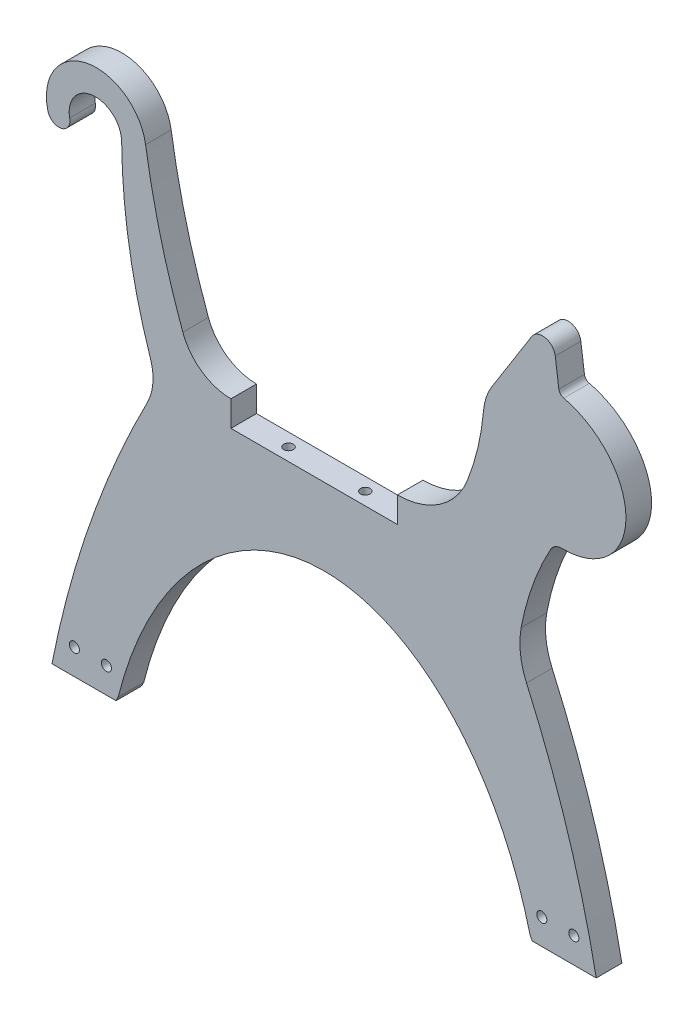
ISO-10303-21;
HEADER;
FILE_DESCRIPTION(('STEP AP214'),'2;1');
FILE_NAME('part.step','',(''),(''),'','','');
FILE_SCHEMA(('AUTOMOTIVE_DESIGN { 1 0 10303 214 1 1 1 1 }'));
ENDSEC;
DATA;
#1=APPLICATION_CONTEXT('core data for automotive mechanical design processes');
#2=APPLICATION_PROTOCOL_DEFINITION('international standard','automotive_design',2000,#1);
#3=PRODUCT_CONTEXT('',#1,'mechanical');
#4=PRODUCT('Part','Part','',(#3));
#5=PRODUCT_RELATED_PRODUCT_CATEGORY('part','',(#4));
#6=PRODUCT_DEFINITION_FORMATION('','',#4);
#7=PRODUCT_DEFINITION_CONTEXT('part definition',#1,'design');
#8=PRODUCT_DEFINITION('design','',#6,#7);
#9=PRODUCT_DEFINITION_SHAPE('','',#8);
#10=(LENGTH_UNIT() NAMED_UNIT(*) SI_UNIT(.MILLI.,.METRE.));
#11=(NAMED_UNIT(*) PLANE_ANGLE_UNIT() SI_UNIT($,.RADIAN.));
#12=(NAMED_UNIT(*) SI_UNIT($,.STERADIAN.) SOLID_ANGLE_UNIT());
#13=UNCERTAINTY_MEASURE_WITH_UNIT(LENGTH_MEASURE(1.E-05),#10,'distance_accuracy_value','');
#14=(GEOMETRIC_REPRESENTATION_CONTEXT(3) GLOBAL_UNCERTAINTY_ASSIGNED_CONTEXT((#13)) GLOBAL_UNIT_ASSIGNED_CONTEXT((#10,
#11,#12)) REPRESENTATION_CONTEXT('',''));
#15=CARTESIAN_POINT('',(0.,0.,0.));
#16=DIRECTION('',(0.,0.,1.));
#17=DIRECTION('',(1.,0.,0.));
#18=AXIS2_PLACEMENT_3D('',#15,#16,#17);
#19=CARTESIAN_POINT('',(0.,0.,12.7));
#20=DIRECTION('',(0.,0.,1.));
#21=DIRECTION('',(1.,0.,0.));
#22=AXIS2_PLACEMENT_3D('',#19,#20,#21);
#23=PLANE('',#22);
#24=CARTESIAN_POINT('',(19.0500000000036,-392.512284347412,12.7));
#25=DIRECTION('',(0.,0.,-1.));
#26=DIRECTION('',(-1.,0.,0.));
#27=AXIS2_PLACEMENT_3D('',#24,#25,#26);
#28=CIRCLE('',#27,4.99999999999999);
#29=CARTESIAN_POINT('',(14.0500000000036,-392.512284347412,12.7));
#30=VERTEX_POINT('',#29);
#31=EDGE_CURVE('E744',#30,#30,#28,.T.);
#32=ORIENTED_EDGE('',*,*,#31,.T.);
#33=EDGE_LOOP('',(#32));
#34=FACE_BOUND('',#33,.T.);
#35=CARTESIAN_POINT('',(-444.500000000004,-392.512284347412,12.7));
#36=DIRECTION('',(0.,0.,1.));
#37=DIRECTION('',(1.,0.,0.));
#38=AXIS2_PLACEMENT_3D('',#35,#36,#37);
#39=CIRCLE('',#38,4.99999999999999);
#40=CARTESIAN_POINT('',(-439.500000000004,-392.512284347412,12.7));
#41=VERTEX_POINT('',#40);
#42=EDGE_CURVE('E725',#41,#41,#39,.T.);
#43=ORIENTED_EDGE('',*,*,#42,.F.);
#44=EDGE_LOOP('',(#43));
#45=FACE_BOUND('',#44,.T.);
#46=CARTESIAN_POINT('',(-476.250000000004,-392.512284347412,12.7));
#47=DIRECTION('',(0.,0.,1.));
#48=DIRECTION('',(1.,0.,0.));
#49=AXIS2_PLACEMENT_3D('',#46,#47,#48);
#50=CIRCLE('',#49,4.99999999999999);
#51=CARTESIAN_POINT('',(-471.250000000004,-392.512284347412,12.7));
#52=VERTEX_POINT('',#51);
#53=EDGE_CURVE('E563',#52,#52,#50,.T.);
#54=ORIENTED_EDGE('',*,*,#53,.F.);
#55=EDGE_LOOP('',(#54));
#56=FACE_BOUND('',#55,.T.);
#57=DIRECTION('',(0.,-1.,0.));
#58=VECTOR('',#57,1.);
#59=CARTESIAN_POINT('',(-321.041347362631,-101.6,12.7));
#60=LINE('',#59,#58);
#61=CARTESIAN_POINT('',(-321.041347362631,-101.6,12.7));
#62=VERTEX_POINT('',#61);
#63=CARTESIAN_POINT('',(-321.041347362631,-127.,12.7));
#64=VERTEX_POINT('',#63);
#65=EDGE_CURVE('E706',#62,#64,#60,.T.);
#66=ORIENTED_EDGE('',*,*,#65,.F.);
#67=CARTESIAN_POINT('',(-321.041347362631,-50.8,12.6999999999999));
#68=DIRECTION('',(0.,0.,1.));
#69=DIRECTION('',(1.,0.,0.));
#70=AXIS2_PLACEMENT_3D('',#67,#68,#69);
#71=CIRCLE('',#70,50.8);
#72=CARTESIAN_POINT('',(-368.73055635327,-68.303695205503,12.7));
#73=VERTEX_POINT('',#72);
#74=EDGE_CURVE('E494',#62,#73,#71,.F.);
#75=ORIENTED_EDGE('',*,*,#74,.T.);
#76=CARTESIAN_POINT('',(335.465793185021,190.162287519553,12.7));
#77=DIRECTION('',(0.,0.,-1.));
#78=DIRECTION('',(-1.,0.,0.));
#79=AXIS2_PLACEMENT_3D('',#76,#77,#78);
#80=CIRCLE('',#79,750.131430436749);
#81=CARTESIAN_POINT('',(-405.665165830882,74.3086534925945,12.7));
#82=VERTEX_POINT('',#81);
#83=EDGE_CURVE('E468',#73,#82,#80,.T.);
#84=ORIENTED_EDGE('',*,*,#83,.T.);
#85=CARTESIAN_POINT('',(-454.526781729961,66.6706028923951,12.7));
#86=DIRECTION('',(0.,0.,1.));
#87=DIRECTION('',(1.,0.,0.));
#88=AXIS2_PLACEMENT_3D('',#85,#86,#87);
#89=CIRCLE('',#88,49.4550030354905);
#90=CARTESIAN_POINT('',(-502.551122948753,54.8612855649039,12.7));
#91=VERTEX_POINT('',#90);
#92=EDGE_CURVE('E453',#82,#91,#89,.T.);
#93=ORIENTED_EDGE('',*,*,#92,.T.);
#94=CARTESIAN_POINT('',(-491.620591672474,57.5491332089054,12.7));
#95=DIRECTION('',(0.,0.,1.));
#96=DIRECTION('',(1.,0.,0.));
#97=AXIS2_PLACEMENT_3D('',#94,#95,#96);
#98=CIRCLE('',#97,11.256155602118);
#99=CARTESIAN_POINT('',(-486.817132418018,47.3693582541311,12.7));
#100=VERTEX_POINT('',#99);
#101=EDGE_CURVE('E458',#91,#100,#98,.T.);
#102=ORIENTED_EDGE('',*,*,#101,.T.);
#103=CARTESIAN_POINT('',(-491.742694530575,57.2729273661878,12.7));
#104=DIRECTION('',(0.,0.,1.));
#105=DIRECTION('',(1.,0.,0.));
#106=AXIS2_PLACEMENT_3D('',#103,#104,#105);
#107=CIRCLE('',#106,11.0608247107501);
#108=CARTESIAN_POINT('',(-480.941881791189,59.6571017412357,12.7));
#109=VERTEX_POINT('',#108);
#110=EDGE_CURVE('E463',#100,#109,#107,.T.);
#111=ORIENTED_EDGE('',*,*,#110,.T.);
#112=CARTESIAN_POINT('',(-455.394035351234,64.6219214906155,12.7));
#113=DIRECTION('',(0.,0.,-1.));
#114=DIRECTION('',(1.,0.,0.));
#115=AXIS2_PLACEMENT_3D('',#112,#113,#114);
#116=CIRCLE('',#115,26.0257928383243);
#117=CARTESIAN_POINT('',(-429.369181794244,64.8430327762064,12.7));
#118=VERTEX_POINT('',#117);
#119=EDGE_CURVE('E436',#109,#118,#116,.T.);
#120=ORIENTED_EDGE('',*,*,#119,.T.);
#121=CARTESIAN_POINT('',(129.926872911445,69.5949008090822,12.7));
#122=DIRECTION('',(0.,0.,1.));
#123=DIRECTION('',(-1.,0.,0.));
#124=AXIS2_PLACEMENT_3D('',#121,#122,#123);
#125=CIRCLE('',#124,559.316240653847);
#126=CARTESIAN_POINT('',(-400.821781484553,-106.871874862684,12.7));
#127=VERTEX_POINT('',#126);
#128=EDGE_CURVE('E429',#118,#127,#125,.T.);
#129=ORIENTED_EDGE('',*,*,#128,.T.);
#130=CARTESIAN_POINT('',(-449.027125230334,-122.899502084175,12.6999999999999));
#131=DIRECTION('',(0.,0.,1.));
#132=DIRECTION('',(1.,0.,0.));
#133=AXIS2_PLACEMENT_3D('',#130,#131,#132);
#134=CIRCLE('',#133,50.8);
#135=CARTESIAN_POINT('',(-403.89851755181,-146.224355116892,12.7));
#136=VERTEX_POINT('',#135);
#137=EDGE_CURVE('E504',#127,#136,#134,.F.);
#138=ORIENTED_EDGE('',*,*,#137,.T.);
#139=CARTESIAN_POINT('',(498.67363601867,-612.721415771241,12.7));
#140=DIRECTION('',(0.,0.,1.));
#141=DIRECTION('',(-1.,0.,0.));
#142=AXIS2_PLACEMENT_3D('',#139,#140,#141);
#143=CIRCLE('',#142,1016.);
#144=CARTESIAN_POINT('',(-498.475,-417.912284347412,12.7));
#145=VERTEX_POINT('',#144);
#146=EDGE_CURVE('E422',#136,#145,#143,.T.);
#147=ORIENTED_EDGE('',*,*,#146,.T.);
#148=DIRECTION('',(-1.,0.,0.));
#149=VECTOR('',#148,1.);
#150=CARTESIAN_POINT('',(-498.475,-417.912284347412,12.7));
#151=LINE('',#150,#149);
#152=CARTESIAN_POINT('',(-434.975000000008,-417.912284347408,12.7));
#153=VERTEX_POINT('',#152);
#154=EDGE_CURVE('E677',#153,#145,#151,.T.);
#155=ORIENTED_EDGE('',*,*,#154,.F.);
#156=CARTESIAN_POINT('',(-234.304019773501,-515.793329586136,12.7));
#157=DIRECTION('',(0.,0.,1.));
#158=DIRECTION('',(1.,0.,0.));
#159=AXIS2_PLACEMENT_3D('',#156,#157,#158);
#160=CIRCLE('',#159,223.270108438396);
#161=CARTESIAN_POINT('',(-432.822671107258,-413.617567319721,12.7));
#162=VERTEX_POINT('',#161);
#163=EDGE_CURVE('E684',#162,#153,#160,.T.);
#164=ORIENTED_EDGE('',*,*,#163,.F.);
#165=CARTESIAN_POINT('',(-228.6,-525.408836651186,12.7));
#166=DIRECTION('',(0.,0.,1.));
#167=DIRECTION('',(0.,-1.,0.));
#168=AXIS2_PLACEMENT_3D('',#165,#166,#167);
#169=ELLIPSE('',#168,322.208836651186,217.748656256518);
#170=CARTESIAN_POINT('',(-24.3773288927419,-413.617567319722,12.7));
#171=VERTEX_POINT('',#170);
#172=EDGE_CURVE('E622',#171,#162,#169,.T.);
#173=ORIENTED_EDGE('',*,*,#172,.F.);
#174=CARTESIAN_POINT('',(-229.804579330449,-519.255624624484,12.7));
#175=DIRECTION('',(0.,0.,1.));
#176=DIRECTION('',(-1.,0.,0.));
#177=AXIS2_PLACEMENT_3D('',#174,#175,#176);
#178=CIRCLE('',#177,230.997303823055);
#179=CARTESIAN_POINT('',(-22.2249999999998,-417.912284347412,12.7));
#180=VERTEX_POINT('',#179);
#181=EDGE_CURVE('E687',#180,#171,#178,.T.);
#182=ORIENTED_EDGE('',*,*,#181,.F.);
#183=DIRECTION('',(-1.,0.,0.));
#184=VECTOR('',#183,1.);
#185=CARTESIAN_POINT('',(-22.2249999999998,-417.912284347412,12.7));
#186=LINE('',#185,#184);
#187=CARTESIAN_POINT('',(41.2750000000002,-417.912284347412,12.7));
#188=VERTEX_POINT('',#187);
#189=EDGE_CURVE('E689',#188,#180,#186,.T.);
#190=ORIENTED_EDGE('',*,*,#189,.F.);
#191=CARTESIAN_POINT('',(-955.873636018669,-612.721415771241,12.7));
#192=DIRECTION('',(0.,0.,1.));
#193=DIRECTION('',(1.,0.,0.));
#194=AXIS2_PLACEMENT_3D('',#191,#192,#193);
#195=CIRCLE('',#194,1016.);
#196=CARTESIAN_POINT('',(-27.8715125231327,-199.117669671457,12.7));
#197=VERTEX_POINT('',#196);
#198=EDGE_CURVE('E413',#188,#197,#195,.T.);
#199=ORIENTED_EDGE('',*,*,#198,.T.);
#200=CARTESIAN_POINT('',(41.7286467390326,-168.097388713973,12.6999999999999));
#201=DIRECTION('',(0.,0.,1.));
#202=DIRECTION('',(1.,0.,0.));
#203=AXIS2_PLACEMENT_3D('',#200,#201,#202);
#204=CIRCLE('',#203,76.2);
#205=CARTESIAN_POINT('',(-33.175901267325,-154.106367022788,12.7));
#206=VERTEX_POINT('',#205);
#207=EDGE_CURVE('E1303',#197,#206,#204,.F.);
#208=ORIENTED_EDGE('',*,*,#207,.T.);
#209=CARTESIAN_POINT('',(236.826148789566,-204.538612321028,12.7));
#210=DIRECTION('',(0.,0.,-1.));
#211=DIRECTION('',(1.,0.,0.));
#212=AXIS2_PLACEMENT_3D('',#209,#210,#211);
#213=CIRCLE('',#212,274.671655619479);
#214=CARTESIAN_POINT('',(-4.08048292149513,-72.5972874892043,12.7));
#215=VERTEX_POINT('',#214);
#216=EDGE_CURVE('E409',#206,#215,#213,.T.);
#217=ORIENTED_EDGE('',*,*,#216,.T.);
#218=CARTESIAN_POINT('',(7.05832284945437,-78.6978617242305,12.7));
#219=DIRECTION('',(0.,0.,1.));
#220=DIRECTION('',(1.,0.,0.));
#221=AXIS2_PLACEMENT_3D('',#218,#219,#220);
#222=CIRCLE('',#221,12.7);
#223=CARTESIAN_POINT('',(7.27148813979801,-65.9996508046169,12.7));
#224=VERTEX_POINT('',#223);
#225=EDGE_CURVE('E1294',#215,#224,#222,.F.);
#226=ORIENTED_EDGE('',*,*,#225,.T.);
#227=CARTESIAN_POINT('',(0.,0.,12.7));
#228=DIRECTION('',(0.,0.,1.));
#229=DIRECTION('',(0.86602540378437,-0.500000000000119,0.));
#230=AXIS2_PLACEMENT_3D('',#227,#228,#229);
#231=ELLIPSE('',#230,73.025,63.5000000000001);
#232=CARTESIAN_POINT('',(9.046006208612,63.9740335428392,12.7));
#233=VERTEX_POINT('',#232);
#234=EDGE_CURVE('E342',#224,#233,#231,.T.);
#235=ORIENTED_EDGE('',*,*,#234,.T.);
#236=CARTESIAN_POINT('',(10.4799382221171,70.1600127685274,12.7));
#237=DIRECTION('',(0.,0.,1.));
#238=DIRECTION('',(1.,0.,0.));
#239=AXIS2_PLACEMENT_3D('',#236,#237,#238);
#240=CIRCLE('',#239,6.35);
#241=CARTESIAN_POINT('',(4.18562167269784,69.3209185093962,12.7));
#242=VERTEX_POINT('',#241);
#243=EDGE_CURVE('E11',#233,#242,#240,.F.);
#244=ORIENTED_EDGE('',*,*,#243,.T.);
#245=DIRECTION('',(-0.132140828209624,0.991230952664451,0.));
#246=VECTOR('',#245,1.);
#247=CARTESIAN_POINT('',(0.635725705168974,95.9498325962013,12.7));
#248=LINE('',#247,#246);
#249=CARTESIAN_POINT('',(0.635725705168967,95.9498325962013,12.7));
#250=VERTEX_POINT('',#249);
#251=EDGE_CURVE('E332',#242,#250,#248,.T.);
#252=ORIENTED_EDGE('',*,*,#251,.T.);
#253=CARTESIAN_POINT('',(-11.9529073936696,94.2716440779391,12.7));
#254=DIRECTION('',(0.,0.,1.));
#255=DIRECTION('',(-1.,0.,0.));
#256=AXIS2_PLACEMENT_3D('',#253,#254,#255);
#257=CIRCLE('',#256,12.7);
#258=CARTESIAN_POINT('',(-22.703003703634,101.033702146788,12.7));
#259=VERTEX_POINT('',#258);
#260=EDGE_CURVE('E779',#250,#259,#257,.T.);
#261=ORIENTED_EDGE('',*,*,#260,.T.);
#262=DIRECTION('',(-0.532445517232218,-0.846464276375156,0.));
#263=VECTOR('',#262,1.);
#264=CARTESIAN_POINT('',(-62.1611986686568,38.3043685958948,12.7));
#265=LINE('',#264,#263);
#266=CARTESIAN_POINT('',(-62.1611986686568,38.3043685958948,12.7));
#267=VERTEX_POINT('',#266);
#268=EDGE_CURVE('E370',#259,#267,#265,.T.);
#269=ORIENTED_EDGE('',*,*,#268,.T.);
#270=CARTESIAN_POINT('',(-70.5332042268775,13.2199925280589,12.6999999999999));
#271=VERTEX_POINT('',#270);
#272=EDGE_CURVE('E338',#267,#271,#231,.T.);
#273=ORIENTED_EDGE('',*,*,#272,.T.);
#274=CARTESIAN_POINT('',(-312.271379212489,34.5675805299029,12.7));
#275=DIRECTION('',(0.,0.,-1.));
#276=DIRECTION('',(-1.,0.,0.));
#277=AXIS2_PLACEMENT_3D('',#274,#275,#276);
#278=CIRCLE('',#277,242.678933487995);
#279=CARTESIAN_POINT('',(-86.4550557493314,-54.314660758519,12.7));
#280=VERTEX_POINT('',#279);
#281=EDGE_CURVE('E412',#271,#280,#278,.T.);
#282=ORIENTED_EDGE('',*,*,#281,.T.);
#283=CARTESIAN_POINT('',(-155.883086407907,-26.9875,12.6999999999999));
#284=DIRECTION('',(0.,0.,1.));
#285=DIRECTION('',(1.,0.,0.));
#286=AXIS2_PLACEMENT_3D('',#283,#284,#285);
#287=CIRCLE('',#286,74.6125);
#288=CARTESIAN_POINT('',(-155.883086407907,-101.6,12.7));
#289=VERTEX_POINT('',#288);
#290=EDGE_CURVE('E397',#280,#289,#287,.F.);
#291=ORIENTED_EDGE('',*,*,#290,.T.);
#292=DIRECTION('',(-1.,0.,0.));
#293=VECTOR('',#292,1.);
#294=CARTESIAN_POINT('',(-111.394663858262,-101.6,12.7));
#295=LINE('',#294,#293);
#296=CARTESIAN_POINT('',(-155.941347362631,-101.6,12.7));
#297=VERTEX_POINT('',#296);
#298=EDGE_CURVE('E419',#289,#297,#295,.T.);
#299=ORIENTED_EDGE('',*,*,#298,.T.);
#300=DIRECTION('',(0.,1.,0.));
#301=VECTOR('',#300,1.);
#302=CARTESIAN_POINT('',(-155.941347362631,-101.6,12.7));
#303=LINE('',#302,#301);
#304=CARTESIAN_POINT('',(-155.941347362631,-127.,12.7));
#305=VERTEX_POINT('',#304);
#306=EDGE_CURVE('E636',#305,#297,#303,.T.);
#307=ORIENTED_EDGE('',*,*,#306,.F.);
#308=DIRECTION('',(1.,0.,0.));
#309=VECTOR('',#308,1.);
#310=CARTESIAN_POINT('',(-321.041347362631,-127.,12.7));
#311=LINE('',#310,#309);
#312=EDGE_CURVE('E703',#64,#305,#311,.T.);
#313=ORIENTED_EDGE('',*,*,#312,.F.);
#314=EDGE_LOOP('',(#66,#75,#84,#93,#102,#111,#120,#129,#138,#147,#155,#164,#173,#182,#190,#199,
#208,#217,#226,#235,#244,#252,#261,#269,#273,#282,#291,#299,#307,#313));
#315=FACE_BOUND('',#314,.T.);
#316=CARTESIAN_POINT('',(-12.6999999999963,-392.512284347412,12.7));
#317=DIRECTION('',(0.,0.,-1.));
#318=DIRECTION('',(-1.,0.,0.));
#319=AXIS2_PLACEMENT_3D('',#316,#317,#318);
#320=CIRCLE('',#319,4.99999999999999);
#321=CARTESIAN_POINT('',(-17.6999999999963,-392.512284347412,12.7));
#322=VERTEX_POINT('',#321);
#323=EDGE_CURVE('E750',#322,#322,#320,.T.);
#324=ORIENTED_EDGE('',*,*,#323,.T.);
#325=EDGE_LOOP('',(#324));
#326=FACE_BOUND('',#325,.T.);
#327=ADVANCED_FACE('F37',(#34,#45,#56,#315,#326),#23,.T.);
#328=CARTESIAN_POINT('',(-12.6999999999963,-417.912284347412,0.));
#329=DIRECTION('',(0.,-1.,0.));
#330=DIRECTION('',(0.,0.,-1.));
#331=AXIS2_PLACEMENT_3D('',#328,#329,#330);
#332=CYLINDRICAL_SURFACE('',#331,3.17499999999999);
#333=CARTESIAN_POINT('',(-12.6999999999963,-417.912284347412,0.));
#334=DIRECTION('',(0.,-1.,0.));
#335=DIRECTION('',(0.,0.,-1.));
#336=AXIS2_PLACEMENT_3D('',#333,#334,#335);
#337=CIRCLE('',#336,3.175);
#338=CARTESIAN_POINT('',(-12.6999999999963,-417.912284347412,-3.175));
#339=VERTEX_POINT('',#338);
#340=EDGE_CURVE('E734',#339,#339,#337,.T.);
#341=ORIENTED_EDGE('',*,*,#340,.T.);
#342=EDGE_LOOP('',(#341));
#343=FACE_BOUND('',#342,.T.);
#344=CARTESIAN_POINT('',(-12.6999999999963,-397.512284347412,-3.17499999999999));
#345=CARTESIAN_POINT('',(-12.6195324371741,-397.512283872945,-3.1749994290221));
#346=CARTESIAN_POINT('',(-12.5390624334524,-397.510335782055,-3.1719347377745));
#347=CARTESIAN_POINT('',(-12.3787611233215,-397.502601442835,-3.15973217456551));
#348=CARTESIAN_POINT('',(-12.2989300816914,-397.496813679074,-3.15059190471));
#349=CARTESIAN_POINT('',(-12.0611447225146,-397.473849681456,-3.11418437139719));
#350=CARTESIAN_POINT('',(-11.9049897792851,-397.451072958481,-3.0779305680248));
#351=CARTESIAN_POINT('',(-11.6029762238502,-397.392874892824,-2.98364572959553));
#352=CARTESIAN_POINT('',(-11.4570706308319,-397.357516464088,-2.92572297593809));
#353=CARTESIAN_POINT('',(-11.1775465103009,-397.277081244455,-2.79049584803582));
#354=CARTESIAN_POINT('',(-11.043927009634,-397.232005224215,-2.71319301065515));
#355=CARTESIAN_POINT('',(-10.7805474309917,-397.131500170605,-2.53449925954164));
#356=CARTESIAN_POINT('',(-10.6519804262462,-397.075527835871,-2.43166268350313));
#357=CARTESIAN_POINT('',(-10.4127635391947,-396.960453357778,-2.2081708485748));
#358=CARTESIAN_POINT('',(-10.3021386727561,-396.901346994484,-2.08749115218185));
#359=CARTESIAN_POINT('',(-10.0860904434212,-396.77668413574,-1.81189212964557));
#360=CARTESIAN_POINT('',(-9.98358884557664,-396.711390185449,-1.65454432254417));
#361=CARTESIAN_POINT('',(-9.80674916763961,-396.591565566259,-1.32105525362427));
#362=CARTESIAN_POINT('',(-9.73236297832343,-396.537016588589,-1.1449467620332));
#363=CARTESIAN_POINT('',(-9.63120754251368,-396.460122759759,-0.826513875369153));
#364=CARTESIAN_POINT('',(-9.59703227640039,-396.433070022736,-0.687687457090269));
#365=CARTESIAN_POINT('',(-9.5476455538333,-396.393482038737,-0.404761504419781));
#366=CARTESIAN_POINT('',(-9.53240597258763,-396.380925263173,-0.260670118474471));
#367=CARTESIAN_POINT('',(-9.52181483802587,-396.372232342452,0.029182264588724));
#368=CARTESIAN_POINT('',(-9.52652152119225,-396.37614428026,0.174946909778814));
#369=CARTESIAN_POINT('',(-9.55562726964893,-396.399860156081,0.463219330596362));
#370=CARTESIAN_POINT('',(-9.58004243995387,-396.419677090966,0.605724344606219));
#371=CARTESIAN_POINT('',(-9.64619303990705,-396.471570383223,0.879922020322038));
#372=CARTESIAN_POINT('',(-9.68743587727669,-396.503296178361,1.01180390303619));
#373=CARTESIAN_POINT('',(-9.78554979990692,-396.575495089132,1.26701184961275));
#374=CARTESIAN_POINT('',(-9.8424261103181,-396.615971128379,1.39033503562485));
#375=CARTESIAN_POINT('',(-9.98267718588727,-396.710449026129,1.6500090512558));
#376=CARTESIAN_POINT('',(-10.0690392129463,-396.765557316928,1.78434231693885));
#377=CARTESIAN_POINT('',(-10.2603345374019,-396.87810352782,2.03812409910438));
#378=CARTESIAN_POINT('',(-10.3652895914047,-396.935544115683,2.15755489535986));
#379=CARTESIAN_POINT('',(-10.6125951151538,-397.058160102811,2.39965713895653));
#380=CARTESIAN_POINT('',(-10.7582763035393,-397.122910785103,2.51917844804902));
#381=CARTESIAN_POINT('',(-11.0712708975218,-397.242528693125,2.73195162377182));
#382=CARTESIAN_POINT('',(-11.238560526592,-397.297406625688,2.8252320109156));
#383=CARTESIAN_POINT('',(-11.5560615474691,-397.381865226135,2.96579178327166));
#384=CARTESIAN_POINT('',(-11.7031002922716,-397.414303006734,3.01852161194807));
#385=CARTESIAN_POINT('',(-12.0054571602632,-397.466178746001,3.10206023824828));
#386=CARTESIAN_POINT('',(-12.1607686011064,-397.485627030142,3.13288644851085));
#387=CARTESIAN_POINT('',(-12.4759215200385,-397.50976701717,3.17106931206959));
#388=CARTESIAN_POINT('',(-12.6357758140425,-397.514411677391,3.17835114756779));
#389=CARTESIAN_POINT('',(-12.954476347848,-397.508347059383,3.16879814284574));
#390=CARTESIAN_POINT('',(-13.1133225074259,-397.497636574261,3.15196140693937));
#391=CARTESIAN_POINT('',(-13.4172452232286,-397.462820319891,3.09658855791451));
#392=CARTESIAN_POINT('',(-13.562612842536,-397.439413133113,3.05918280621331));
#393=CARTESIAN_POINT('',(-13.8446576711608,-397.381627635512,2.96521468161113));
#394=CARTESIAN_POINT('',(-13.9813334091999,-397.347247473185,2.90864907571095));
#395=CARTESIAN_POINT('',(-14.2536246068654,-397.267061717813,2.7733963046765));
#396=CARTESIAN_POINT('',(-14.3883625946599,-397.220584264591,2.69335002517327));
#397=CARTESIAN_POINT('',(-14.6431732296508,-397.121277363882,2.51572355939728));
#398=CARTESIAN_POINT('',(-14.763233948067,-397.06844281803,2.41812926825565));
#399=CARTESIAN_POINT('',(-15.0043271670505,-396.95194478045,2.19136693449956));
#400=CARTESIAN_POINT('',(-15.1227654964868,-396.88785129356,2.05965630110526));
#401=CARTESIAN_POINT('',(-15.3367258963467,-396.762350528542,1.77753627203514));
#402=CARTESIAN_POINT('',(-15.4322454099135,-396.700943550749,1.62712479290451));
#403=CARTESIAN_POINT('',(-15.5860072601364,-396.596196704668,1.33233425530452));
#404=CARTESIAN_POINT('',(-15.6476349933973,-396.551528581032,1.19019851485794));
#405=CARTESIAN_POINT('',(-15.7501139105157,-396.474727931,0.895348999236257));
#406=CARTESIAN_POINT('',(-15.7909944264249,-396.442577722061,0.742650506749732));
#407=CARTESIAN_POINT('',(-15.8351648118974,-396.407291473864,0.507771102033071));
#408=CARTESIAN_POINT('',(-15.8470457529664,-396.397670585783,0.428086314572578));
#409=CARTESIAN_POINT('',(-15.8647277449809,-396.383283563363,0.267625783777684));
#410=CARTESIAN_POINT('',(-15.8705318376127,-396.37851500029,0.186850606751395));
#411=CARTESIAN_POINT('',(-15.8759342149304,-396.374078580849,0.0249715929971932));
#412=CARTESIAN_POINT('',(-15.875534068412,-396.374409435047,-0.0561321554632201));
#413=CARTESIAN_POINT('',(-15.8685516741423,-396.380138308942,-0.217868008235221));
#414=CARTESIAN_POINT('',(-15.8619698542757,-396.385535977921,-0.298500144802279));
#415=CARTESIAN_POINT('',(-15.835746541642,-396.406843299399,-0.516764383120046));
#416=CARTESIAN_POINT('',(-15.8100920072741,-396.427540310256,-0.653264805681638));
#417=CARTESIAN_POINT('',(-15.7420347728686,-396.48064024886,-0.919578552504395));
#418=CARTESIAN_POINT('',(-15.6996160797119,-396.513054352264,-1.04938535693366));
#419=CARTESIAN_POINT('',(-15.5823133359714,-396.598748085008,-1.34384957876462));
#420=CARTESIAN_POINT('',(-15.501278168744,-396.655368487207,-1.50508953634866));
#421=CARTESIAN_POINT('',(-15.3147475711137,-396.775546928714,-1.80990147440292));
#422=CARTESIAN_POINT('',(-15.2092194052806,-396.83911419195,-1.95344941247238));
#423=CARTESIAN_POINT('',(-14.9745320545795,-396.967010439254,-2.22246074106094));
#424=CARTESIAN_POINT('',(-14.845127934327,-397.031340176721,-2.34771005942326));
#425=CARTESIAN_POINT('',(-14.5650805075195,-397.153917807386,-2.57577734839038));
#426=CARTESIAN_POINT('',(-14.4144374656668,-397.212165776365,-2.67859559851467));
#427=CARTESIAN_POINT('',(-14.1727221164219,-397.291255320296,-2.81434976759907));
#428=CARTESIAN_POINT('',(-14.0883774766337,-397.316496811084,-2.85692934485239));
#429=CARTESIAN_POINT('',(-13.915358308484,-397.363151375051,-2.93470772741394));
#430=CARTESIAN_POINT('',(-13.8266862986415,-397.384566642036,-2.96991076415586));
#431=CARTESIAN_POINT('',(-13.6458821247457,-397.422867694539,-3.03233549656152));
#432=CARTESIAN_POINT('',(-13.553759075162,-397.439764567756,-3.05957674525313));
#433=CARTESIAN_POINT('',(-13.3667286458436,-397.468534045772,-3.10569835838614));
#434=CARTESIAN_POINT('',(-13.2718233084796,-397.480410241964,-3.12458469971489));
#435=CARTESIAN_POINT('',(-13.0975026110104,-397.497082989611,-3.15101980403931));
#436=CARTESIAN_POINT('',(-13.0183860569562,-397.5027708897,-3.16000032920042));
#437=CARTESIAN_POINT('',(-12.8595138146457,-397.510371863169,-3.17199080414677));
#438=CARTESIAN_POINT('',(-12.779758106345,-397.512284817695,-3.17500056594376));
#439=CARTESIAN_POINT('',(-12.6999999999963,-397.512284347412,-3.17499999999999));
#440=B_SPLINE_CURVE_WITH_KNOTS('',3,(#344,#345,#346,#347,#348,#349,#350,#351,#352,#353,#354,
#355,#356,#357,#358,#359,#360,#361,#362,#363,#364,#365,#366,#367,#368,#369,#370,#371,#372,#373,
#374,#375,#376,#377,#378,#379,#380,#381,#382,#383,#384,#385,#386,#387,#388,#389,#390,#391,#392,
#393,#394,#395,#396,#397,#398,#399,#400,#401,#402,#403,#404,#405,#406,#407,#408,#409,#410,#411,
#412,#413,#414,#415,#416,#417,#418,#419,#420,#421,#422,#423,#424,#425,#426,#427,#428,#429,#430,
#431,#432,#433,#434,#435,#436,#437,#438,#439),.UNSPECIFIED.,.T.,.F.,(4,2,2,2,2,2,2,2,2,2,2,2,2,
2,2,2,2,2,2,2,2,2,2,2,2,2,2,2,2,2,2,2,2,2,2,2,2,2,2,2,2,2,2,2,2,2,2,4),(0.,0.241316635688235,
0.482728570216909,0.965823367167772,1.44653566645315,1.92720985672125,2.44688988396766,
2.96728836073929,3.56090589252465,4.15350301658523,4.58823400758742,5.02231852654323,
5.45767130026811,5.89338018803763,6.31715795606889,6.74107753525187,7.24605140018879,
7.75162011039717,8.34644215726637,8.94061518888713,9.41719375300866,9.89339302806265,
10.3711040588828,10.8488526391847,11.3026463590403,11.7565166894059,12.2450357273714,
12.7339492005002,13.2967357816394,13.8595851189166,14.3414890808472,14.8227098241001,
15.0658016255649,15.3087716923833,15.551680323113,15.794572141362,16.213861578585,
16.6335519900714,17.1979639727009,17.7631346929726,18.3344629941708,18.9057841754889,
19.1988014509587,19.4916501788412,19.7837735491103,20.0756876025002,20.3148690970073,
20.5540581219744),.UNSPECIFIED.);
#441=CARTESIAN_POINT('',(-12.6999999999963,-397.512284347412,-3.17499999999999));
#442=VERTEX_POINT('',#441);
#443=EDGE_CURVE('E757',#442,#442,#440,.T.);
#444=ORIENTED_EDGE('',*,*,#443,.F.);
#445=EDGE_LOOP('',(#444));
#446=FACE_BOUND('',#445,.T.);
#447=ADVANCED_FACE('F289',(#343,#446),#332,.F.);
#448=CARTESIAN_POINT('',(19.0500000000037,-417.912284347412,0.));
#449=DIRECTION('',(0.,-1.,0.));
#450=DIRECTION('',(0.,0.,-1.));
#451=AXIS2_PLACEMENT_3D('',#448,#449,#450);
#452=CYLINDRICAL_SURFACE('',#451,3.17499999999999);
#453=CARTESIAN_POINT('',(19.0500000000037,-417.912284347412,0.));
#454=DIRECTION('',(0.,-1.,0.));
#455=DIRECTION('',(0.,0.,-1.));
#456=AXIS2_PLACEMENT_3D('',#453,#454,#455);
#457=CIRCLE('',#456,3.175);
#458=CARTESIAN_POINT('',(19.0500000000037,-417.912284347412,-3.175));
#459=VERTEX_POINT('',#458);
#460=EDGE_CURVE('E740',#459,#459,#457,.T.);
#461=ORIENTED_EDGE('',*,*,#460,.T.);
#462=EDGE_LOOP('',(#461));
#463=FACE_BOUND('',#462,.T.);
#464=CARTESIAN_POINT('',(19.0500000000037,-397.512284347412,-3.175));
#465=CARTESIAN_POINT('',(19.1304675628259,-397.512283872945,-3.1749994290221));
#466=CARTESIAN_POINT('',(19.2109375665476,-397.510335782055,-3.17193473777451));
#467=CARTESIAN_POINT('',(19.3712388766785,-397.502601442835,-3.15973217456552));
#468=CARTESIAN_POINT('',(19.4510699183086,-397.496813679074,-3.15059190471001));
#469=CARTESIAN_POINT('',(19.6888552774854,-397.473849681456,-3.11418437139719));
#470=CARTESIAN_POINT('',(19.8450102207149,-397.451072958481,-3.0779305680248));
#471=CARTESIAN_POINT('',(20.1470237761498,-397.392874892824,-2.98364572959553));
#472=CARTESIAN_POINT('',(20.2929293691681,-397.357516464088,-2.92572297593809));
#473=CARTESIAN_POINT('',(20.5724534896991,-397.277081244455,-2.79049584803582));
#474=CARTESIAN_POINT('',(20.706072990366,-397.232005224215,-2.71319301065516));
#475=CARTESIAN_POINT('',(20.9694525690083,-397.131500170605,-2.53449925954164));
#476=CARTESIAN_POINT('',(21.0980195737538,-397.075527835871,-2.43166268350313));
#477=CARTESIAN_POINT('',(21.3372364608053,-396.960453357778,-2.2081708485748));
#478=CARTESIAN_POINT('',(21.4478613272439,-396.901346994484,-2.08749115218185));
#479=CARTESIAN_POINT('',(21.6639095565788,-396.77668413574,-1.81189212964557));
#480=CARTESIAN_POINT('',(21.7664111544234,-396.711390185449,-1.65454432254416));
#481=CARTESIAN_POINT('',(21.9432508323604,-396.591565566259,-1.32105525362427));
#482=CARTESIAN_POINT('',(22.0176370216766,-396.537016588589,-1.1449467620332));
#483=CARTESIAN_POINT('',(22.1187924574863,-396.460122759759,-0.826513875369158));
#484=CARTESIAN_POINT('',(22.1529677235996,-396.433070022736,-0.687687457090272));
#485=CARTESIAN_POINT('',(22.2023544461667,-396.393482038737,-0.404761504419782));
#486=CARTESIAN_POINT('',(22.2175940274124,-396.380925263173,-0.260670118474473));
#487=CARTESIAN_POINT('',(22.2281851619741,-396.372232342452,0.0291822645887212));
#488=CARTESIAN_POINT('',(22.2234784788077,-396.37614428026,0.174946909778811));
#489=CARTESIAN_POINT('',(22.1943727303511,-396.399860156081,0.463219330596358));
#490=CARTESIAN_POINT('',(22.1699575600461,-396.419677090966,0.605724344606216));
#491=CARTESIAN_POINT('',(22.1038069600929,-396.471570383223,0.87992202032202));
#492=CARTESIAN_POINT('',(22.0625641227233,-396.503296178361,1.01180390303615));
#493=CARTESIAN_POINT('',(21.9644502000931,-396.575495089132,1.26701184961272));
#494=CARTESIAN_POINT('',(21.9075738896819,-396.615971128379,1.39033503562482));
#495=CARTESIAN_POINT('',(21.7673228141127,-396.710449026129,1.65000905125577));
#496=CARTESIAN_POINT('',(21.6809607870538,-396.765557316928,1.78434231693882));
#497=CARTESIAN_POINT('',(21.4896654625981,-396.87810352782,2.03812409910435));
#498=CARTESIAN_POINT('',(21.3847104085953,-396.935544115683,2.15755489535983));
#499=CARTESIAN_POINT('',(21.1374048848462,-397.05816010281,2.39965713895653));
#500=CARTESIAN_POINT('',(20.9917236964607,-397.122910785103,2.51917844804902));
#501=CARTESIAN_POINT('',(20.6787291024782,-397.242528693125,2.73195162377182));
#502=CARTESIAN_POINT('',(20.511439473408,-397.297406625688,2.8252320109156));
#503=CARTESIAN_POINT('',(20.1939384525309,-397.381865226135,2.96579178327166));
#504=CARTESIAN_POINT('',(20.0468997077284,-397.414303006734,3.01852161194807));
#505=CARTESIAN_POINT('',(19.7445428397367,-397.466178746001,3.10206023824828));
#506=CARTESIAN_POINT('',(19.5892313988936,-397.485627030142,3.13288644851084));
#507=CARTESIAN_POINT('',(19.2740784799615,-397.50976701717,3.17106931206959));
#508=CARTESIAN_POINT('',(19.1142241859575,-397.514411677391,3.17835114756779));
#509=CARTESIAN_POINT('',(18.795523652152,-397.508347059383,3.16879814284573));
#510=CARTESIAN_POINT('',(18.6366774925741,-397.497636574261,3.15196140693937));
#511=CARTESIAN_POINT('',(18.3327547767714,-397.462820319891,3.0965885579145));
#512=CARTESIAN_POINT('',(18.187387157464,-397.439413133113,3.0591828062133));
#513=CARTESIAN_POINT('',(17.9053423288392,-397.381627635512,2.96521468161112));
#514=CARTESIAN_POINT('',(17.7686665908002,-397.347247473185,2.90864907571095));
#515=CARTESIAN_POINT('',(17.4963753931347,-397.267061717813,2.77339630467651));
#516=CARTESIAN_POINT('',(17.3616374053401,-397.220584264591,2.69335002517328));
#517=CARTESIAN_POINT('',(17.1068267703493,-397.121277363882,2.51572355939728));
#518=CARTESIAN_POINT('',(16.986766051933,-397.06844281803,2.41812926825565));
#519=CARTESIAN_POINT('',(16.7456728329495,-396.95194478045,2.19136693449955));
#520=CARTESIAN_POINT('',(16.6272345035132,-396.88785129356,2.05965630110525));
#521=CARTESIAN_POINT('',(16.4132741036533,-396.762350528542,1.77753627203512));
#522=CARTESIAN_POINT('',(16.3177545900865,-396.700943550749,1.62712479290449));
#523=CARTESIAN_POINT('',(16.1639927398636,-396.596196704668,1.3323342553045));
#524=CARTESIAN_POINT('',(16.1023650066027,-396.551528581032,1.19019851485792));
#525=CARTESIAN_POINT('',(15.9998860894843,-396.474727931,0.895348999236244));
#526=CARTESIAN_POINT('',(15.9590055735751,-396.442577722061,0.742650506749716));
#527=CARTESIAN_POINT('',(15.9148351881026,-396.407291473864,0.507771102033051));
#528=CARTESIAN_POINT('',(15.9029542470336,-396.397670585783,0.428086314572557));
#529=CARTESIAN_POINT('',(15.8852722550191,-396.383283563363,0.267625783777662));
#530=CARTESIAN_POINT('',(15.8794681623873,-396.37851500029,0.186850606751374));
#531=CARTESIAN_POINT('',(15.8740657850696,-396.374078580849,0.0249715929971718));
#532=CARTESIAN_POINT('',(15.874465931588,-396.374409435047,-0.0561321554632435));
#533=CARTESIAN_POINT('',(15.8814483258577,-396.380138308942,-0.217868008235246));
#534=CARTESIAN_POINT('',(15.8880301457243,-396.385535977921,-0.298500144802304));
#535=CARTESIAN_POINT('',(15.914253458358,-396.406843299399,-0.516764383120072));
#536=CARTESIAN_POINT('',(15.9399079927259,-396.427540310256,-0.653264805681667));
#537=CARTESIAN_POINT('',(16.0079652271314,-396.48064024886,-0.919578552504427));
#538=CARTESIAN_POINT('',(16.0503839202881,-396.513054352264,-1.04938535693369));
#539=CARTESIAN_POINT('',(16.1676866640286,-396.598748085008,-1.34384957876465));
#540=CARTESIAN_POINT('',(16.248721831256,-396.655368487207,-1.5050895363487));
#541=CARTESIAN_POINT('',(16.4352524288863,-396.775546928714,-1.80990147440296));
#542=CARTESIAN_POINT('',(16.5407805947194,-396.83911419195,-1.95344941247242));
#543=CARTESIAN_POINT('',(16.7754679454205,-396.967010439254,-2.22246074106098));
#544=CARTESIAN_POINT('',(16.904872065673,-397.031340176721,-2.34771005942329));
#545=CARTESIAN_POINT('',(17.1849194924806,-397.153917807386,-2.57577734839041));
#546=CARTESIAN_POINT('',(17.3355625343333,-397.212165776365,-2.67859559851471));
#547=CARTESIAN_POINT('',(17.5772778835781,-397.291255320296,-2.81434976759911));
#548=CARTESIAN_POINT('',(17.6616225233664,-397.316496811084,-2.85692934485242));
#549=CARTESIAN_POINT('',(17.8346416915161,-397.363151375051,-2.93470772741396));
#550=CARTESIAN_POINT('',(17.9233137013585,-397.384566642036,-2.96991076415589));
#551=CARTESIAN_POINT('',(18.1041178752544,-397.422867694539,-3.03233549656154));
#552=CARTESIAN_POINT('',(18.1962409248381,-397.439764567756,-3.05957674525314));
#553=CARTESIAN_POINT('',(18.3832713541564,-397.468534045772,-3.10569835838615));
#554=CARTESIAN_POINT('',(18.4781766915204,-397.480410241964,-3.1245846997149));
#555=CARTESIAN_POINT('',(18.6524973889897,-397.497082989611,-3.15101980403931));
#556=CARTESIAN_POINT('',(18.7316139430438,-397.5027708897,-3.16000032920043));
#557=CARTESIAN_POINT('',(18.8904861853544,-397.510371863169,-3.17199080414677));
#558=CARTESIAN_POINT('',(18.970241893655,-397.512284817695,-3.17500056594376));
#559=CARTESIAN_POINT('',(19.0500000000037,-397.512284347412,-3.175));
#560=B_SPLINE_CURVE_WITH_KNOTS('',3,(#464,#465,#466,#467,#468,#469,#470,#471,#472,#473,#474,
#475,#476,#477,#478,#479,#480,#481,#482,#483,#484,#485,#486,#487,#488,#489,#490,#491,#492,#493,
#494,#495,#496,#497,#498,#499,#500,#501,#502,#503,#504,#505,#506,#507,#508,#509,#510,#511,#512,
#513,#514,#515,#516,#517,#518,#519,#520,#521,#522,#523,#524,#525,#526,#527,#528,#529,#530,#531,
#532,#533,#534,#535,#536,#537,#538,#539,#540,#541,#542,#543,#544,#545,#546,#547,#548,#549,#550,
#551,#552,#553,#554,#555,#556,#557,#558,#559),.UNSPECIFIED.,.T.,.F.,(4,2,2,2,2,2,2,2,2,2,2,2,2,
2,2,2,2,2,2,2,2,2,2,2,2,2,2,2,2,2,2,2,2,2,2,2,2,2,2,2,2,2,2,2,2,2,2,4),(0.,0.241316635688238,
0.482728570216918,0.965823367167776,1.44653566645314,1.92720985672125,2.44688988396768,
2.9672883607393,3.56090589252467,4.15350301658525,4.58823400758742,5.02231852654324,
5.45767130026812,5.89338018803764,6.31715795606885,6.74107753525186,7.24605140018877,
7.75162011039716,8.34644215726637,8.94061518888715,9.41719375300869,9.89339302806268,
10.3711040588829,10.8488526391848,11.3026463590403,11.7565166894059,12.2450357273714,
12.7339492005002,13.2967357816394,13.8595851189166,14.3414890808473,14.8227098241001,
15.065801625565,15.3087716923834,15.5516803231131,15.7945721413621,16.213861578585,
16.6335519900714,17.1979639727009,17.7631346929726,18.3344629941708,18.9057841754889,
19.1988014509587,19.4916501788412,19.7837735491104,20.0756876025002,20.3148690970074,
20.5540581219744),.UNSPECIFIED.);
#561=CARTESIAN_POINT('',(19.0500000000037,-397.512284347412,-3.175));
#562=VERTEX_POINT('',#561);
#563=EDGE_CURVE('E564',#562,#562,#560,.T.);
#564=ORIENTED_EDGE('',*,*,#563,.F.);
#565=EDGE_LOOP('',(#564));
#566=FACE_BOUND('',#565,.T.);
#567=ADVANCED_FACE('F295',(#463,#566),#452,.F.);
#568=DIRECTION('',(0.,0.,-1.));
#569=VECTOR('',#568,1.);
#570=SURFACE_OF_LINEAR_EXTRUSION('',#231,#569);
#571=DIRECTION('',(0.,0.,1.));
#572=VECTOR('',#571,1.);
#573=CARTESIAN_POINT('',(-70.5332042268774,13.2199925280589,-1028.99109291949));
#574=LINE('',#573,#572);
#575=CARTESIAN_POINT('',(-70.5332042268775,13.2199925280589,-12.6999999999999));
#576=VERTEX_POINT('',#575);
#577=EDGE_CURVE('E421',#576,#271,#574,.T.);
#578=ORIENTED_EDGE('',*,*,#577,.T.);
#579=ORIENTED_EDGE('',*,*,#272,.F.);
#580=DIRECTION('',(0.,0.,-1.));
#581=VECTOR('',#580,1.);
#582=CARTESIAN_POINT('',(-62.1611986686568,38.3043685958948,12.7));
#583=LINE('',#582,#581);
#584=CARTESIAN_POINT('',(-62.1611986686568,38.3043685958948,-12.7));
#585=VERTEX_POINT('',#584);
#586=EDGE_CURVE('E377',#267,#585,#583,.T.);
#587=ORIENTED_EDGE('',*,*,#586,.T.);
#588=CARTESIAN_POINT('',(0.,0.,-12.7));
#589=DIRECTION('',(0.,0.,1.));
#590=DIRECTION('',(0.86602540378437,-0.500000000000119,0.));
#591=AXIS2_PLACEMENT_3D('',#588,#589,#590);
#592=ELLIPSE('',#591,73.025,63.5000000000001);
#593=EDGE_CURVE('E343',#585,#576,#592,.T.);
#594=ORIENTED_EDGE('',*,*,#593,.T.);
#595=EDGE_LOOP('',(#578,#579,#587,#594));
#596=FACE_BOUND('',#595,.T.);
#597=ADVANCED_FACE('F324',(#596),#570,.F.);
#598=CARTESIAN_POINT('',(7.27148813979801,-65.9996508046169,-12.7));
#599=VERTEX_POINT('',#598);
#600=CARTESIAN_POINT('',(9.046006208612,63.9740335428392,-12.7));
#601=VERTEX_POINT('',#600);
#602=EDGE_CURVE('E363',#599,#601,#592,.T.);
#603=ORIENTED_EDGE('',*,*,#602,.T.);
#604=DIRECTION('',(0.,0.,-1.));
#605=VECTOR('',#604,1.);
#606=CARTESIAN_POINT('',(9.046006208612,63.9740335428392,-12.7));
#607=LINE('',#606,#605);
#608=EDGE_CURVE('E58',#601,#233,#607,.F.);
#609=ORIENTED_EDGE('',*,*,#608,.T.);
#610=ORIENTED_EDGE('',*,*,#234,.F.);
#611=DIRECTION('',(0.,0.,-1.));
#612=VECTOR('',#611,1.);
#613=CARTESIAN_POINT('',(7.27148813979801,-65.9996508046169,12.7));
#614=LINE('',#613,#612);
#615=EDGE_CURVE('E360',#224,#599,#614,.T.);
#616=ORIENTED_EDGE('',*,*,#615,.T.);
#617=EDGE_LOOP('',(#603,#609,#610,#616));
#618=FACE_BOUND('',#617,.T.);
#619=ADVANCED_FACE('F319',(#618),#570,.F.);
#620=CARTESIAN_POINT('',(0.635725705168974,95.9498325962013,12.7));
#621=DIRECTION('',(-0.991230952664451,-0.132140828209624,0.));
#622=DIRECTION('',(0.132140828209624,-0.991230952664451,0.));
#623=AXIS2_PLACEMENT_3D('',#620,#621,#622);
#624=PLANE('',#623);
#625=ORIENTED_EDGE('',*,*,#251,.F.);
#626=DIRECTION('',(0.,0.,1.));
#627=VECTOR('',#626,1.);
#628=CARTESIAN_POINT('',(4.18562167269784,69.3209185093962,-12.7));
#629=LINE('',#628,#627);
#630=CARTESIAN_POINT('',(4.18562167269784,69.3209185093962,-12.7));
#631=VERTEX_POINT('',#630);
#632=EDGE_CURVE('E517',#242,#631,#629,.F.);
#633=ORIENTED_EDGE('',*,*,#632,.T.);
#634=DIRECTION('',(-0.132140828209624,0.991230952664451,0.));
#635=VECTOR('',#634,1.);
#636=CARTESIAN_POINT('',(0.635725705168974,95.9498325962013,-12.7));
#637=LINE('',#636,#635);
#638=CARTESIAN_POINT('',(0.635725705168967,95.9498325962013,-12.7));
#639=VERTEX_POINT('',#638);
#640=EDGE_CURVE('E371',#631,#639,#637,.T.);
#641=ORIENTED_EDGE('',*,*,#640,.T.);
#642=DIRECTION('',(0.,0.,-1.));
#643=VECTOR('',#642,1.);
#644=CARTESIAN_POINT('',(0.635725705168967,95.9498325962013,12.7));
#645=LINE('',#644,#643);
#646=EDGE_CURVE('E382',#250,#639,#645,.T.);
#647=ORIENTED_EDGE('',*,*,#646,.F.);
#648=EDGE_LOOP('',(#625,#633,#641,#647));
#649=FACE_BOUND('',#648,.T.);
#650=ADVANCED_FACE('F315',(#649),#624,.F.);
#651=CARTESIAN_POINT('',(-11.9529073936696,94.2716440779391,12.7));
#652=DIRECTION('',(0.,0.,-1.));
#653=DIRECTION('',(-1.,0.,0.));
#654=AXIS2_PLACEMENT_3D('',#651,#652,#653);
#655=CYLINDRICAL_SURFACE('',#654,12.7);
#656=CARTESIAN_POINT('',(-11.9529073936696,94.2716440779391,-12.7));
#657=DIRECTION('',(0.,0.,1.));
#658=DIRECTION('',(-1.,0.,0.));
#659=AXIS2_PLACEMENT_3D('',#656,#657,#658);
#660=CIRCLE('',#659,12.7);
#661=CARTESIAN_POINT('',(-22.703003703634,101.033702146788,-12.7));
#662=VERTEX_POINT('',#661);
#663=EDGE_CURVE('E374',#639,#662,#660,.T.);
#664=ORIENTED_EDGE('',*,*,#663,.T.);
#665=DIRECTION('',(0.,0.,-1.));
#666=VECTOR('',#665,1.);
#667=CARTESIAN_POINT('',(-22.703003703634,101.033702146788,12.7));
#668=LINE('',#667,#666);
#669=EDGE_CURVE('E380',#259,#662,#668,.T.);
#670=ORIENTED_EDGE('',*,*,#669,.F.);
#671=ORIENTED_EDGE('',*,*,#260,.F.);
#672=ORIENTED_EDGE('',*,*,#646,.T.);
#673=EDGE_LOOP('',(#664,#670,#671,#672));
#674=FACE_BOUND('',#673,.T.);
#675=ADVANCED_FACE('F311',(#674),#655,.T.);
#676=CARTESIAN_POINT('',(-62.1611986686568,38.3043685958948,12.7));
#677=DIRECTION('',(0.846464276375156,-0.532445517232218,0.));
#678=DIRECTION('',(0.532445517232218,0.846464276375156,0.));
#679=AXIS2_PLACEMENT_3D('',#676,#677,#678);
#680=PLANE('',#679);
#681=CARTESIAN_POINT('',(-57.0896551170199,46.3669408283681,0.));
#682=DIRECTION('',(-0.846464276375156,0.532445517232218,0.));
#683=DIRECTION('',(-0.532445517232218,-0.846464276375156,0.));
#684=AXIS2_PLACEMENT_3D('',#681,#682,#683);
#685=CIRCLE('',#684,4.76249999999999);
#686=CARTESIAN_POINT('',(-59.6254268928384,42.3356547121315,0.));
#687=VERTEX_POINT('',#686);
#688=EDGE_CURVE('E268',#687,#687,#685,.T.);
#689=ORIENTED_EDGE('',*,*,#688,.F.);
#690=EDGE_LOOP('',(#689));
#691=FACE_BOUND('',#690,.T.);
#692=DIRECTION('',(-0.532445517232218,-0.846464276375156,0.));
#693=VECTOR('',#692,1.);
#694=CARTESIAN_POINT('',(-62.1611986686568,38.3043685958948,-12.7));
#695=LINE('',#694,#693);
#696=EDGE_CURVE('E362',#662,#585,#695,.T.);
#697=ORIENTED_EDGE('',*,*,#696,.T.);
#698=ORIENTED_EDGE('',*,*,#586,.F.);
#699=ORIENTED_EDGE('',*,*,#268,.F.);
#700=ORIENTED_EDGE('',*,*,#669,.T.);
#701=EDGE_LOOP('',(#697,#698,#699,#700));
#702=FACE_BOUND('',#701,.T.);
#703=ADVANCED_FACE('F308',(#691,#702),#680,.F.);
#704=CARTESIAN_POINT('',(0.,0.,-12.7));
#705=DIRECTION('',(0.,0.,1.));
#706=DIRECTION('',(1.,0.,0.));
#707=AXIS2_PLACEMENT_3D('',#704,#705,#706);
#708=PLANE('',#707);
#709=CARTESIAN_POINT('',(-321.041347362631,-50.8,-12.6999999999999));
#710=DIRECTION('',(0.,0.,1.));
#711=DIRECTION('',(1.,0.,0.));
#712=AXIS2_PLACEMENT_3D('',#709,#710,#711);
#713=CIRCLE('',#712,50.8);
#714=CARTESIAN_POINT('',(-368.73055635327,-68.303695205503,-12.6999999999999));
#715=VERTEX_POINT('',#714);
#716=CARTESIAN_POINT('',(-321.041347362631,-101.6,-12.6999999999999));
#717=VERTEX_POINT('',#716);
#718=EDGE_CURVE('E501',#715,#717,#713,.T.);
#719=ORIENTED_EDGE('',*,*,#718,.T.);
#720=DIRECTION('',(0.,-1.,0.));
#721=VECTOR('',#720,1.);
#722=CARTESIAN_POINT('',(-321.041347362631,0.,-12.7));
#723=LINE('',#722,#721);
#724=CARTESIAN_POINT('',(-321.041347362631,-127.,-12.7));
#725=VERTEX_POINT('',#724);
#726=EDGE_CURVE('E694',#717,#725,#723,.T.);
#727=ORIENTED_EDGE('',*,*,#726,.T.);
#728=DIRECTION('',(1.,0.,0.));
#729=VECTOR('',#728,1.);
#730=CARTESIAN_POINT('',(0.,-127.,-12.7));
#731=LINE('',#730,#729);
#732=CARTESIAN_POINT('',(-155.941347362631,-127.,-12.7));
#733=VERTEX_POINT('',#732);
#734=EDGE_CURVE('E514',#725,#733,#731,.T.);
#735=ORIENTED_EDGE('',*,*,#734,.T.);
#736=DIRECTION('',(0.,1.,0.));
#737=VECTOR('',#736,1.);
#738=CARTESIAN_POINT('',(-155.941347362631,0.,-12.7));
#739=LINE('',#738,#737);
#740=CARTESIAN_POINT('',(-155.941347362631,-101.6,-12.6999999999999));
#741=VERTEX_POINT('',#740);
#742=EDGE_CURVE('E692',#733,#741,#739,.T.);
#743=ORIENTED_EDGE('',*,*,#742,.T.);
#744=DIRECTION('',(1.,0.,0.));
#745=VECTOR('',#744,1.);
#746=CARTESIAN_POINT('',(-111.394663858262,-101.6,-12.6999999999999));
#747=LINE('',#746,#745);
#748=CARTESIAN_POINT('',(-155.883086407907,-101.6,-12.6999999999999));
#749=VERTEX_POINT('',#748);
#750=EDGE_CURVE('E647',#741,#749,#747,.T.);
#751=ORIENTED_EDGE('',*,*,#750,.T.);
#752=CARTESIAN_POINT('',(-155.883086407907,-26.9875,-12.6999999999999));
#753=DIRECTION('',(0.,0.,1.));
#754=DIRECTION('',(1.,0.,0.));
#755=AXIS2_PLACEMENT_3D('',#752,#753,#754);
#756=CIRCLE('',#755,74.6125);
#757=CARTESIAN_POINT('',(-86.4550557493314,-54.314660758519,-12.6999999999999));
#758=VERTEX_POINT('',#757);
#759=EDGE_CURVE('E403',#749,#758,#756,.T.);
#760=ORIENTED_EDGE('',*,*,#759,.T.);
#761=CARTESIAN_POINT('',(-312.271379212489,34.5675805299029,-12.6999999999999));
#762=DIRECTION('',(0.,0.,1.));
#763=DIRECTION('',(1.,0.,0.));
#764=AXIS2_PLACEMENT_3D('',#761,#762,#763);
#765=CIRCLE('',#764,242.678933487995);
#766=EDGE_CURVE('E354',#758,#576,#765,.T.);
#767=ORIENTED_EDGE('',*,*,#766,.T.);
#768=ORIENTED_EDGE('',*,*,#593,.F.);
#769=ORIENTED_EDGE('',*,*,#696,.F.);
#770=ORIENTED_EDGE('',*,*,#663,.F.);
#771=ORIENTED_EDGE('',*,*,#640,.F.);
#772=CARTESIAN_POINT('',(10.4799382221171,70.1600127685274,-12.7));
#773=DIRECTION('',(0.,0.,1.));
#774=DIRECTION('',(1.,0.,0.));
#775=AXIS2_PLACEMENT_3D('',#772,#773,#774);
#776=CIRCLE('',#775,6.35);
#777=EDGE_CURVE('E45',#631,#601,#776,.T.);
#778=ORIENTED_EDGE('',*,*,#777,.T.);
#779=ORIENTED_EDGE('',*,*,#602,.F.);
#780=CARTESIAN_POINT('',(7.05832284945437,-78.6978617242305,-12.7));
#781=DIRECTION('',(0.,0.,1.));
#782=DIRECTION('',(1.,0.,0.));
#783=AXIS2_PLACEMENT_3D('',#780,#781,#782);
#784=CIRCLE('',#783,12.7);
#785=CARTESIAN_POINT('',(-4.08048292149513,-72.5972874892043,-12.6999999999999));
#786=VERTEX_POINT('',#785);
#787=EDGE_CURVE('E1293',#599,#786,#784,.T.);
#788=ORIENTED_EDGE('',*,*,#787,.T.);
#789=CARTESIAN_POINT('',(236.826148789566,-204.538612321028,-12.6999999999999));
#790=DIRECTION('',(0.,0.,1.));
#791=DIRECTION('',(1.,0.,0.));
#792=AXIS2_PLACEMENT_3D('',#789,#790,#791);
#793=CIRCLE('',#792,274.671655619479);
#794=CARTESIAN_POINT('',(-33.175901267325,-154.106367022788,-12.6999999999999));
#795=VERTEX_POINT('',#794);
#796=EDGE_CURVE('E351',#786,#795,#793,.T.);
#797=ORIENTED_EDGE('',*,*,#796,.T.);
#798=CARTESIAN_POINT('',(41.7286467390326,-168.097388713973,-12.6999999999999));
#799=DIRECTION('',(0.,0.,1.));
#800=DIRECTION('',(1.,0.,0.));
#801=AXIS2_PLACEMENT_3D('',#798,#799,#800);
#802=CIRCLE('',#801,76.2);
#803=CARTESIAN_POINT('',(-27.8715125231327,-199.117669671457,-12.6999999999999));
#804=VERTEX_POINT('',#803);
#805=EDGE_CURVE('E356',#795,#804,#802,.T.);
#806=ORIENTED_EDGE('',*,*,#805,.T.);
#807=CARTESIAN_POINT('',(-955.873636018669,-612.721415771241,-12.6999999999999));
#808=DIRECTION('',(0.,0.,1.));
#809=DIRECTION('',(1.,0.,0.));
#810=AXIS2_PLACEMENT_3D('',#807,#808,#809);
#811=CIRCLE('',#810,1016.);
#812=CARTESIAN_POINT('',(41.2750000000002,-417.912284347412,-12.7));
#813=VERTEX_POINT('',#812);
#814=EDGE_CURVE('E355',#804,#813,#811,.F.);
#815=ORIENTED_EDGE('',*,*,#814,.T.);
#816=DIRECTION('',(-1.,0.,0.));
#817=VECTOR('',#816,1.);
#818=CARTESIAN_POINT('',(0.,-417.912284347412,-12.7));
#819=LINE('',#818,#817);
#820=CARTESIAN_POINT('',(-22.2249999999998,-417.912284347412,-12.7));
#821=VERTEX_POINT('',#820);
#822=EDGE_CURVE('E508',#813,#821,#819,.T.);
#823=ORIENTED_EDGE('',*,*,#822,.T.);
#824=CARTESIAN_POINT('',(-229.804579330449,-519.255624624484,-12.7));
#825=DIRECTION('',(0.,0.,1.));
#826=DIRECTION('',(1.,0.,0.));
#827=AXIS2_PLACEMENT_3D('',#824,#825,#826);
#828=CIRCLE('',#827,230.997303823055);
#829=CARTESIAN_POINT('',(-24.3773288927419,-413.617567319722,-12.6999999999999));
#830=VERTEX_POINT('',#829);
#831=EDGE_CURVE('E669',#821,#830,#828,.T.);
#832=ORIENTED_EDGE('',*,*,#831,.T.);
#833=CARTESIAN_POINT('',(-228.6,-525.408836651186,-12.6999999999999));
#834=DIRECTION('',(0.,0.,1.));
#835=DIRECTION('',(0.,-1.,0.));
#836=AXIS2_PLACEMENT_3D('',#833,#834,#835);
#837=ELLIPSE('',#836,322.208836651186,217.748656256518);
#838=CARTESIAN_POINT('',(-432.822671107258,-413.617567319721,-12.6999999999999));
#839=VERTEX_POINT('',#838);
#840=EDGE_CURVE('E365',#839,#830,#837,.F.);
#841=ORIENTED_EDGE('',*,*,#840,.F.);
#842=CARTESIAN_POINT('',(-234.304019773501,-515.793329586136,-12.7));
#843=DIRECTION('',(0.,0.,1.));
#844=DIRECTION('',(1.,0.,0.));
#845=AXIS2_PLACEMENT_3D('',#842,#843,#844);
#846=CIRCLE('',#845,223.270108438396);
#847=CARTESIAN_POINT('',(-434.975000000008,-417.912284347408,-12.7));
#848=VERTEX_POINT('',#847);
#849=EDGE_CURVE('E626',#839,#848,#846,.T.);
#850=ORIENTED_EDGE('',*,*,#849,.T.);
#851=DIRECTION('',(-1.,0.,0.));
#852=VECTOR('',#851,1.);
#853=CARTESIAN_POINT('',(0.,-417.912284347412,-12.7));
#854=LINE('',#853,#852);
#855=CARTESIAN_POINT('',(-498.475,-417.912284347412,-12.7));
#856=VERTEX_POINT('',#855);
#857=EDGE_CURVE('E511',#848,#856,#854,.T.);
#858=ORIENTED_EDGE('',*,*,#857,.T.);
#859=CARTESIAN_POINT('',(498.67363601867,-612.721415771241,-12.6999999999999));
#860=DIRECTION('',(0.,0.,1.));
#861=DIRECTION('',(1.,0.,0.));
#862=AXIS2_PLACEMENT_3D('',#859,#860,#861);
#863=CIRCLE('',#862,1016.);
#864=CARTESIAN_POINT('',(-403.89851755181,-146.224355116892,-12.6999999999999));
#865=VERTEX_POINT('',#864);
#866=EDGE_CURVE('E620',#856,#865,#863,.F.);
#867=ORIENTED_EDGE('',*,*,#866,.T.);
#868=CARTESIAN_POINT('',(-449.027125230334,-122.899502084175,-12.6999999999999));
#869=DIRECTION('',(0.,0.,1.));
#870=DIRECTION('',(1.,0.,0.));
#871=AXIS2_PLACEMENT_3D('',#868,#869,#870);
#872=CIRCLE('',#871,50.8);
#873=CARTESIAN_POINT('',(-400.821781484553,-106.871874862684,-12.6999999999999));
#874=VERTEX_POINT('',#873);
#875=EDGE_CURVE('E506',#865,#874,#872,.T.);
#876=ORIENTED_EDGE('',*,*,#875,.T.);
#877=CARTESIAN_POINT('',(129.926872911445,69.5949008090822,-12.6999999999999));
#878=DIRECTION('',(0.,0.,1.));
#879=DIRECTION('',(1.,0.,0.));
#880=AXIS2_PLACEMENT_3D('',#877,#878,#879);
#881=CIRCLE('',#880,559.316240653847);
#882=CARTESIAN_POINT('',(-429.369181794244,64.8430327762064,-12.6999999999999));
#883=VERTEX_POINT('',#882);
#884=EDGE_CURVE('E488',#874,#883,#881,.F.);
#885=ORIENTED_EDGE('',*,*,#884,.T.);
#886=CARTESIAN_POINT('',(-455.394035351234,64.6219214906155,-12.6999999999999));
#887=DIRECTION('',(0.,0.,1.));
#888=DIRECTION('',(1.,0.,0.));
#889=AXIS2_PLACEMENT_3D('',#886,#887,#888);
#890=CIRCLE('',#889,26.0257928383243);
#891=CARTESIAN_POINT('',(-480.941881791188,59.6571017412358,-12.6999999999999));
#892=VERTEX_POINT('',#891);
#893=EDGE_CURVE('E481',#883,#892,#890,.T.);
#894=ORIENTED_EDGE('',*,*,#893,.T.);
#895=CARTESIAN_POINT('',(-491.742694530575,57.2729273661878,-12.6999999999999));
#896=DIRECTION('',(0.,0.,1.));
#897=DIRECTION('',(1.,0.,0.));
#898=AXIS2_PLACEMENT_3D('',#895,#896,#897);
#899=CIRCLE('',#898,11.0608247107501);
#900=CARTESIAN_POINT('',(-486.817132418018,47.36935825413,-12.6999999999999));
#901=VERTEX_POINT('',#900);
#902=EDGE_CURVE('E659',#892,#901,#899,.F.);
#903=ORIENTED_EDGE('',*,*,#902,.T.);
#904=CARTESIAN_POINT('',(-491.620591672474,57.5491332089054,-12.6999999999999));
#905=DIRECTION('',(0.,0.,1.));
#906=DIRECTION('',(1.,0.,0.));
#907=AXIS2_PLACEMENT_3D('',#904,#905,#906);
#908=CIRCLE('',#907,11.256155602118);
#909=CARTESIAN_POINT('',(-502.551122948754,54.8612855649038,-12.6999999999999));
#910=VERTEX_POINT('',#909);
#911=EDGE_CURVE('E657',#901,#910,#908,.F.);
#912=ORIENTED_EDGE('',*,*,#911,.T.);
#913=CARTESIAN_POINT('',(-454.526781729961,66.6706028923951,-12.6999999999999));
#914=DIRECTION('',(0.,0.,1.));
#915=DIRECTION('',(1.,0.,0.));
#916=AXIS2_PLACEMENT_3D('',#913,#914,#915);
#917=CIRCLE('',#916,49.4550030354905);
#918=CARTESIAN_POINT('',(-405.665165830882,74.3086534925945,-12.6999999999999));
#919=VERTEX_POINT('',#918);
#920=EDGE_CURVE('E454',#910,#919,#917,.F.);
#921=ORIENTED_EDGE('',*,*,#920,.T.);
#922=CARTESIAN_POINT('',(335.465793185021,190.162287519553,-12.6999999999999));
#923=DIRECTION('',(0.,0.,1.));
#924=DIRECTION('',(1.,0.,0.));
#925=AXIS2_PLACEMENT_3D('',#922,#923,#924);
#926=CIRCLE('',#925,750.131430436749);
#927=EDGE_CURVE('E649',#919,#715,#926,.T.);
#928=ORIENTED_EDGE('',*,*,#927,.T.);
#929=EDGE_LOOP('',(#719,#727,#735,#743,#751,#760,#767,#768,#769,#770,#771,#778,#779,#788,#797,
#806,#815,#823,#832,#841,#850,#858,#867,#876,#885,#894,#903,#912,#921,#928));
#930=FACE_BOUND('',#929,.T.);
#931=ADVANCED_FACE('F305',(#930),#708,.F.);
#932=CARTESIAN_POINT('',(-955.873636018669,-612.721415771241,-1028.99109291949));
#933=DIRECTION('',(0.,0.,1.));
#934=DIRECTION('',(1.,0.,0.));
#935=AXIS2_PLACEMENT_3D('',#932,#933,#934);
#936=CYLINDRICAL_SURFACE('',#935,1016.);
#937=ORIENTED_EDGE('',*,*,#814,.F.);
#938=DIRECTION('',(0.,0.,1.));
#939=VECTOR('',#938,1.);
#940=CARTESIAN_POINT('',(-27.8715125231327,-199.117669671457,-1028.99109291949));
#941=LINE('',#940,#939);
#942=EDGE_CURVE('E405',#804,#197,#941,.T.);
#943=ORIENTED_EDGE('',*,*,#942,.T.);
#944=ORIENTED_EDGE('',*,*,#198,.F.);
#945=DIRECTION('',(0.,0.,1.));
#946=VECTOR('',#945,1.);
#947=CARTESIAN_POINT('',(41.2750000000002,-417.912284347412,-12.7000499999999));
#948=LINE('',#947,#946);
#949=EDGE_CURVE('E673',#813,#188,#948,.T.);
#950=ORIENTED_EDGE('',*,*,#949,.F.);
#951=EDGE_LOOP('',(#937,#943,#944,#950));
#952=FACE_BOUND('',#951,.T.);
#953=ADVANCED_FACE('F303',(#952),#936,.T.);
#954=CARTESIAN_POINT('',(236.826148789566,-204.538612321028,-1028.99109291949));
#955=DIRECTION('',(0.,0.,1.));
#956=DIRECTION('',(1.,0.,0.));
#957=AXIS2_PLACEMENT_3D('',#954,#955,#956);
#958=CYLINDRICAL_SURFACE('',#957,274.671655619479);
#959=ORIENTED_EDGE('',*,*,#796,.F.);
#960=DIRECTION('',(0.,0.,1.));
#961=VECTOR('',#960,1.);
#962=CARTESIAN_POINT('',(-4.08048292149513,-72.5972874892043,-1028.99109291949));
#963=LINE('',#962,#961);
#964=EDGE_CURVE('E358',#786,#215,#963,.T.);
#965=ORIENTED_EDGE('',*,*,#964,.T.);
#966=ORIENTED_EDGE('',*,*,#216,.F.);
#967=DIRECTION('',(0.,0.,1.));
#968=VECTOR('',#967,1.);
#969=CARTESIAN_POINT('',(-33.175901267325,-154.106367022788,-1028.99109291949));
#970=LINE('',#969,#968);
#971=EDGE_CURVE('E408',#206,#795,#970,.F.);
#972=ORIENTED_EDGE('',*,*,#971,.T.);
#973=EDGE_LOOP('',(#959,#965,#966,#972));
#974=FACE_BOUND('',#973,.T.);
#975=ADVANCED_FACE('F1028',(#974),#958,.F.);
#976=CARTESIAN_POINT('',(-312.271379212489,34.5675805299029,-1028.99109291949));
#977=DIRECTION('',(0.,0.,1.));
#978=DIRECTION('',(1.,0.,0.));
#979=AXIS2_PLACEMENT_3D('',#976,#977,#978);
#980=CYLINDRICAL_SURFACE('',#979,242.678933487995);
#981=ORIENTED_EDGE('',*,*,#766,.F.);
#982=DIRECTION('',(0.,0.,1.));
#983=VECTOR('',#982,1.);
#984=CARTESIAN_POINT('',(-86.4550557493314,-54.314660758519,-1028.99109291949));
#985=LINE('',#984,#983);
#986=EDGE_CURVE('E384',#758,#280,#985,.T.);
#987=ORIENTED_EDGE('',*,*,#986,.T.);
#988=ORIENTED_EDGE('',*,*,#281,.F.);
#989=ORIENTED_EDGE('',*,*,#577,.F.);
#990=EDGE_LOOP('',(#981,#987,#988,#989));
#991=FACE_BOUND('',#990,.T.);
#992=ADVANCED_FACE('F648',(#991),#980,.F.);
#993=CARTESIAN_POINT('',(-111.394663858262,-101.6,-1028.99109291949));
#994=DIRECTION('',(0.,1.,0.));
#995=DIRECTION('',(0.,0.,1.));
#996=AXIS2_PLACEMENT_3D('',#993,#994,#995);
#997=PLANE('',#996);
#998=DIRECTION('',(0.,0.,1.));
#999=VECTOR('',#998,1.);
#1000=CARTESIAN_POINT('',(-155.941347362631,-101.6,-12.7000499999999));
#1001=LINE('',#1000,#999);
#1002=EDGE_CURVE('E643',#741,#297,#1001,.T.);
#1003=ORIENTED_EDGE('',*,*,#1002,.T.);
#1004=ORIENTED_EDGE('',*,*,#298,.F.);
#1005=DIRECTION('',(0.,0.,-1.));
#1006=VECTOR('',#1005,1.);
#1007=CARTESIAN_POINT('',(-155.883086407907,-101.6,-12.6999999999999));
#1008=LINE('',#1007,#1006);
#1009=EDGE_CURVE('E389',#289,#749,#1008,.T.);
#1010=ORIENTED_EDGE('',*,*,#1009,.T.);
#1011=ORIENTED_EDGE('',*,*,#750,.F.);
#1012=EDGE_LOOP('',(#1003,#1004,#1010,#1011));
#1013=FACE_BOUND('',#1012,.T.);
#1014=ADVANCED_FACE('F640',(#1013),#997,.T.);
#1015=CARTESIAN_POINT('',(335.465793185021,190.162287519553,-1028.99109291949));
#1016=DIRECTION('',(0.,0.,1.));
#1017=DIRECTION('',(1.,0.,0.));
#1018=AXIS2_PLACEMENT_3D('',#1015,#1016,#1017);
#1019=CYLINDRICAL_SURFACE('',#1018,750.131430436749);
#1020=ORIENTED_EDGE('',*,*,#83,.F.);
#1021=DIRECTION('',(0.,0.,1.));
#1022=VECTOR('',#1021,1.);
#1023=CARTESIAN_POINT('',(-368.73055635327,-68.303695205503,-1028.99109291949));
#1024=LINE('',#1023,#1022);
#1025=EDGE_CURVE('E492',#73,#715,#1024,.F.);
#1026=ORIENTED_EDGE('',*,*,#1025,.T.);
#1027=ORIENTED_EDGE('',*,*,#927,.F.);
#1028=DIRECTION('',(0.,0.,1.));
#1029=VECTOR('',#1028,1.);
#1030=CARTESIAN_POINT('',(-405.665165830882,74.3086534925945,-1028.99109291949));
#1031=LINE('',#1030,#1029);
#1032=EDGE_CURVE('E330',#919,#82,#1031,.T.);
#1033=ORIENTED_EDGE('',*,*,#1032,.T.);
#1034=EDGE_LOOP('',(#1020,#1026,#1027,#1033));
#1035=FACE_BOUND('',#1034,.T.);
#1036=ADVANCED_FACE('F1010',(#1035),#1019,.F.);
#1037=CARTESIAN_POINT('',(-454.526781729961,66.6706028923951,-1028.99109291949));
#1038=DIRECTION('',(0.,0.,1.));
#1039=DIRECTION('',(1.,0.,0.));
#1040=AXIS2_PLACEMENT_3D('',#1037,#1038,#1039);
#1041=CYLINDRICAL_SURFACE('',#1040,49.4550030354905);
#1042=ORIENTED_EDGE('',*,*,#920,.F.);
#1043=DIRECTION('',(0.,0.,1.));
#1044=VECTOR('',#1043,1.);
#1045=CARTESIAN_POINT('',(-502.551122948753,54.8612855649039,-1028.99109291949));
#1046=LINE('',#1045,#1044);
#1047=EDGE_CURVE('E428',#910,#91,#1046,.T.);
#1048=ORIENTED_EDGE('',*,*,#1047,.T.);
#1049=ORIENTED_EDGE('',*,*,#92,.F.);
#1050=ORIENTED_EDGE('',*,*,#1032,.F.);
#1051=EDGE_LOOP('',(#1042,#1048,#1049,#1050));
#1052=FACE_BOUND('',#1051,.T.);
#1053=ADVANCED_FACE('F450',(#1052),#1041,.T.);
#1054=CARTESIAN_POINT('',(-491.620591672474,57.5491332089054,-1028.99109291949));
#1055=DIRECTION('',(0.,0.,1.));
#1056=DIRECTION('',(1.,0.,0.));
#1057=AXIS2_PLACEMENT_3D('',#1054,#1055,#1056);
#1058=CYLINDRICAL_SURFACE('',#1057,11.256155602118);
#1059=ORIENTED_EDGE('',*,*,#911,.F.);
#1060=DIRECTION('',(0.,0.,1.));
#1061=VECTOR('',#1060,1.);
#1062=CARTESIAN_POINT('',(-486.817132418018,47.3693582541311,-1028.99109291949));
#1063=LINE('',#1062,#1061);
#1064=EDGE_CURVE('E444',#901,#100,#1063,.T.);
#1065=ORIENTED_EDGE('',*,*,#1064,.T.);
#1066=ORIENTED_EDGE('',*,*,#101,.F.);
#1067=ORIENTED_EDGE('',*,*,#1047,.F.);
#1068=EDGE_LOOP('',(#1059,#1065,#1066,#1067));
#1069=FACE_BOUND('',#1068,.T.);
#1070=ADVANCED_FACE('F459',(#1069),#1058,.T.);
#1071=CARTESIAN_POINT('',(-491.742694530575,57.2729273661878,-1028.99109291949));
#1072=DIRECTION('',(0.,0.,1.));
#1073=DIRECTION('',(1.,0.,0.));
#1074=AXIS2_PLACEMENT_3D('',#1071,#1072,#1073);
#1075=CYLINDRICAL_SURFACE('',#1074,11.0608247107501);
#1076=ORIENTED_EDGE('',*,*,#902,.F.);
#1077=DIRECTION('',(0.,0.,1.));
#1078=VECTOR('',#1077,1.);
#1079=CARTESIAN_POINT('',(-480.941881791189,59.6571017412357,-1028.99109291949));
#1080=LINE('',#1079,#1078);
#1081=EDGE_CURVE('E442',#892,#109,#1080,.T.);
#1082=ORIENTED_EDGE('',*,*,#1081,.T.);
#1083=ORIENTED_EDGE('',*,*,#110,.F.);
#1084=ORIENTED_EDGE('',*,*,#1064,.F.);
#1085=EDGE_LOOP('',(#1076,#1082,#1083,#1084));
#1086=FACE_BOUND('',#1085,.T.);
#1087=ADVANCED_FACE('F990',(#1086),#1075,.T.);
#1088=CARTESIAN_POINT('',(-455.394035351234,64.6219214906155,-1028.99109291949));
#1089=DIRECTION('',(0.,0.,1.));
#1090=DIRECTION('',(1.,0.,0.));
#1091=AXIS2_PLACEMENT_3D('',#1088,#1089,#1090);
#1092=CYLINDRICAL_SURFACE('',#1091,26.0257928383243);
#1093=ORIENTED_EDGE('',*,*,#893,.F.);
#1094=DIRECTION('',(0.,0.,1.));
#1095=VECTOR('',#1094,1.);
#1096=CARTESIAN_POINT('',(-429.369181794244,64.8430327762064,-1028.99109291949));
#1097=LINE('',#1096,#1095);
#1098=EDGE_CURVE('E440',#883,#118,#1097,.T.);
#1099=ORIENTED_EDGE('',*,*,#1098,.T.);
#1100=ORIENTED_EDGE('',*,*,#119,.F.);
#1101=ORIENTED_EDGE('',*,*,#1081,.F.);
#1102=EDGE_LOOP('',(#1093,#1099,#1100,#1101));
#1103=FACE_BOUND('',#1102,.T.);
#1104=ADVANCED_FACE('F479',(#1103),#1092,.F.);
#1105=CARTESIAN_POINT('',(129.926872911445,69.5949008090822,-1028.99109291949));
#1106=DIRECTION('',(0.,0.,1.));
#1107=DIRECTION('',(1.,0.,0.));
#1108=AXIS2_PLACEMENT_3D('',#1105,#1106,#1107);
#1109=CYLINDRICAL_SURFACE('',#1108,559.316240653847);
#1110=ORIENTED_EDGE('',*,*,#884,.F.);
#1111=DIRECTION('',(0.,0.,1.));
#1112=VECTOR('',#1111,1.);
#1113=CARTESIAN_POINT('',(-400.821781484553,-106.871874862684,-1028.99109291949));
#1114=LINE('',#1113,#1112);
#1115=EDGE_CURVE('E487',#874,#127,#1114,.T.);
#1116=ORIENTED_EDGE('',*,*,#1115,.T.);
#1117=ORIENTED_EDGE('',*,*,#128,.F.);
#1118=ORIENTED_EDGE('',*,*,#1098,.F.);
#1119=EDGE_LOOP('',(#1110,#1116,#1117,#1118));
#1120=FACE_BOUND('',#1119,.T.);
#1121=ADVANCED_FACE('F485',(#1120),#1109,.T.);
#1122=CARTESIAN_POINT('',(498.67363601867,-612.721415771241,-1028.99109291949));
#1123=DIRECTION('',(0.,0.,1.));
#1124=DIRECTION('',(1.,0.,0.));
#1125=AXIS2_PLACEMENT_3D('',#1122,#1123,#1124);
#1126=CYLINDRICAL_SURFACE('',#1125,1016.);
#1127=ORIENTED_EDGE('',*,*,#146,.F.);
#1128=DIRECTION('',(0.,0.,1.));
#1129=VECTOR('',#1128,1.);
#1130=CARTESIAN_POINT('',(-403.89851755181,-146.224355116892,-1028.99109291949));
#1131=LINE('',#1130,#1129);
#1132=EDGE_CURVE('E491',#136,#865,#1131,.F.);
#1133=ORIENTED_EDGE('',*,*,#1132,.T.);
#1134=ORIENTED_EDGE('',*,*,#866,.F.);
#1135=DIRECTION('',(0.,0.,1.));
#1136=VECTOR('',#1135,1.);
#1137=CARTESIAN_POINT('',(-498.475,-417.912284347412,-12.7000499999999));
#1138=LINE('',#1137,#1136);
#1139=EDGE_CURVE('E672',#856,#145,#1138,.T.);
#1140=ORIENTED_EDGE('',*,*,#1139,.T.);
#1141=EDGE_LOOP('',(#1127,#1133,#1134,#1140));
#1142=FACE_BOUND('',#1141,.T.);
#1143=ADVANCED_FACE('F614',(#1142),#1126,.T.);
#1144=CARTESIAN_POINT('',(-228.6,-525.408836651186,-1028.99109291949));
#1145=DIRECTION('',(0.,0.,1.));
#1146=DIRECTION('',(0.,-1.,0.));
#1147=AXIS2_PLACEMENT_3D('',#1144,#1145,#1146);
#1148=ELLIPSE('',#1147,322.208836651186,217.748656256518);
#1149=DIRECTION('',(0.,0.,1.));
#1150=VECTOR('',#1149,1.);
#1151=SURFACE_OF_LINEAR_EXTRUSION('',#1148,#1150);
#1152=CARTESIAN_POINT('',(-78.6294297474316,-291.802412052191,4.76250000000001));
#1153=CARTESIAN_POINT('',(-78.5518717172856,-291.911433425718,4.76250096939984));
#1154=CARTESIAN_POINT('',(-78.4743991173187,-292.020496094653,4.75685960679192));
#1155=CARTESIAN_POINT('',(-78.3201292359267,-292.237989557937,4.73433359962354));
#1156=CARTESIAN_POINT('',(-78.2433321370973,-292.346420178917,4.71744600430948));
#1157=CARTESIAN_POINT('',(-78.0909128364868,-292.561933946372,4.67252350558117));
#1158=CARTESIAN_POINT('',(-78.0152917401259,-292.669015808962,4.64447870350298));
#1159=CARTESIAN_POINT('',(-77.8657953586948,-292.881007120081,4.57742966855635));
#1160=CARTESIAN_POINT('',(-77.7919207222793,-292.985915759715,4.53842143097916));
#1161=CARTESIAN_POINT('',(-77.6465232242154,-293.192677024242,4.44976532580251));
#1162=CARTESIAN_POINT('',(-77.5749984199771,-293.294532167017,4.40012651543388));
#1163=CARTESIAN_POINT('',(-77.4347038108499,-293.494583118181,4.29052245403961));
#1164=CARTESIAN_POINT('',(-77.3659350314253,-293.592777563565,4.23055340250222));
#1165=CARTESIAN_POINT('',(-77.2316954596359,-293.784698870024,4.10076822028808));
#1166=CARTESIAN_POINT('',(-77.1662226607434,-293.878428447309,4.03095818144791));
#1167=CARTESIAN_POINT('',(-77.0389539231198,-294.060840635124,3.88193155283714));
#1168=CARTESIAN_POINT('',(-76.9771593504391,-294.149521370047,3.8027115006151));
#1169=CARTESIAN_POINT('',(-76.8577049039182,-294.321139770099,3.63546358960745));
#1170=CARTESIAN_POINT('',(-76.8000442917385,-294.404078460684,3.5474373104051));
#1171=CARTESIAN_POINT('',(-76.6892157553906,-294.563657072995,3.363156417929));
#1172=CARTESIAN_POINT('',(-76.6360494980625,-294.640294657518,3.26689877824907));
#1173=CARTESIAN_POINT('',(-76.5346091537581,-294.786654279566,3.06690053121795));
#1174=CARTESIAN_POINT('',(-76.4863334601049,-294.85637858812,2.96316240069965));
#1175=CARTESIAN_POINT('',(-76.3949617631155,-294.988456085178,2.74887250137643));
#1176=CARTESIAN_POINT('',(-76.3518676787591,-295.050806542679,2.63831823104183));
#1177=CARTESIAN_POINT('',(-76.2711820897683,-295.167630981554,2.41125436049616));
#1178=CARTESIAN_POINT('',(-76.2335887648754,-295.222107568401,2.29474674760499));
#1179=CARTESIAN_POINT('',(-76.1641257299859,-295.322828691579,2.05652649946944));
#1180=CARTESIAN_POINT('',(-76.1322581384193,-295.369070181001,1.93481195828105));
#1181=CARTESIAN_POINT('',(-76.0744867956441,-295.452941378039,1.687128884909));
#1182=CARTESIAN_POINT('',(-76.0485808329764,-295.490574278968,1.5611619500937));
#1183=CARTESIAN_POINT('',(-76.0028809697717,-295.55698671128,1.30578261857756));
#1184=CARTESIAN_POINT('',(-75.9830893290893,-295.58576296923,1.17636896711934));
#1185=CARTESIAN_POINT('',(-75.9497710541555,-295.634219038,0.915108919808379));
#1186=CARTESIAN_POINT('',(-75.9362415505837,-295.653903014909,0.783263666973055));
#1187=CARTESIAN_POINT('',(-75.9155163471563,-295.684060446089,0.518017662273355));
#1188=CARTESIAN_POINT('',(-75.908322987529,-295.694530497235,0.384616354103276));
#1189=CARTESIAN_POINT('',(-75.8963565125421,-295.711946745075,-0.0164003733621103));
#1190=CARTESIAN_POINT('',(-75.9011608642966,-295.704951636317,-0.285113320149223));
#1191=CARTESIAN_POINT('',(-75.9362567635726,-295.653879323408,-0.817127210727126));
#1192=CARTESIAN_POINT('',(-75.9665458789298,-295.609805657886,-1.08042866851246));
#1193=CARTESIAN_POINT('',(-76.0517914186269,-295.485898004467,-1.59435656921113));
#1194=CARTESIAN_POINT('',(-76.1067478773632,-295.406063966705,-1.84498299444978));
#1195=CARTESIAN_POINT('',(-76.2398770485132,-295.212964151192,-2.32641068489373));
#1196=CARTESIAN_POINT('',(-76.3180508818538,-295.099696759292,-2.55721099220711));
#1197=CARTESIAN_POINT('',(-76.4955275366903,-294.843043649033,-2.99243739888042));
#1198=CARTESIAN_POINT('',(-76.594830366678,-294.69965791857,-3.19686348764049));
#1199=CARTESIAN_POINT('',(-76.8119110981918,-294.386925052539,-3.57356018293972));
#1200=CARTESIAN_POINT('',(-76.9296911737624,-294.217574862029,-3.74582700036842));
#1201=CARTESIAN_POINT('',(-77.1805263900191,-293.857838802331,-4.05328685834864));
#1202=CARTESIAN_POINT('',(-77.3135815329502,-293.667452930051,-4.18847989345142));
#1203=CARTESIAN_POINT('',(-77.5913254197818,-293.271143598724,-4.41795385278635));
#1204=CARTESIAN_POINT('',(-77.7360142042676,-293.065220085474,-4.5122346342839));
#1205=CARTESIAN_POINT('',(-78.0330199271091,-292.643754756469,-4.6572052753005));
#1206=CARTESIAN_POINT('',(-78.185336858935,-292.428212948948,-4.70789517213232));
#1207=CARTESIAN_POINT('',(-78.4933148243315,-291.993698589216,-4.76424042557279));
#1208=CARTESIAN_POINT('',(-78.6489754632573,-291.774726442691,-4.76990106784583));
#1209=CARTESIAN_POINT('',(-78.9592473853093,-291.339549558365,-4.73604091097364));
#1210=CARTESIAN_POINT('',(-79.1138586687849,-291.123344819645,-4.69652012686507));
#1211=CARTESIAN_POINT('',(-79.4175910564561,-290.699821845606,-4.57342341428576));
#1212=CARTESIAN_POINT('',(-79.5667124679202,-290.49250311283,-4.48984995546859));
#1213=CARTESIAN_POINT('',(-79.8551522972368,-290.092558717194,-4.28102305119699));
#1214=CARTESIAN_POINT('',(-79.9944707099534,-289.89993306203,-4.15576958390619));
#1215=CARTESIAN_POINT('',(-80.2592370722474,-289.534732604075,-3.86712359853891));
#1216=CARTESIAN_POINT('',(-80.384683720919,-289.362159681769,-3.70372750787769));
#1217=CARTESIAN_POINT('',(-80.617982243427,-289.041875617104,-3.34344333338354));
#1218=CARTESIAN_POINT('',(-80.7258340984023,-288.894164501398,-3.14655521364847));
#1219=CARTESIAN_POINT('',(-80.9207369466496,-288.627671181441,-2.72483947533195));
#1220=CARTESIAN_POINT('',(-81.0077858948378,-288.508891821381,-2.50000911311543));
#1221=CARTESIAN_POINT('',(-81.1584524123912,-288.303553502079,-2.02885503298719));
#1222=CARTESIAN_POINT('',(-81.2220700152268,-288.216994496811,-1.78253134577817));
#1223=CARTESIAN_POINT('',(-81.3239555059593,-288.078467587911,-1.2752104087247));
#1224=CARTESIAN_POINT('',(-81.3622247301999,-288.026497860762,-1.01421393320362));
#1225=CARTESIAN_POINT('',(-81.399745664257,-287.975557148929,-0.617639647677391));
#1226=CARTESIAN_POINT('',(-81.4089384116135,-287.96307979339,-0.484528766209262));
#1227=CARTESIAN_POINT('',(-81.4206421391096,-287.947195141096,-0.217487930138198));
#1228=CARTESIAN_POINT('',(-81.4231555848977,-287.943784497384,-0.0835582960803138));
#1229=CARTESIAN_POINT('',(-81.4214786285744,-287.94606031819,0.18420511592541));
#1230=CARTESIAN_POINT('',(-81.4172865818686,-287.951749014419,0.318038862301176));
#1231=CARTESIAN_POINT('',(-81.4022328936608,-287.972181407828,0.584588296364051));
#1232=CARTESIAN_POINT('',(-81.3913737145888,-287.98692176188,0.717304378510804));
#1233=CARTESIAN_POINT('',(-81.36306448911,-288.025361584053,0.980771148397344));
#1234=CARTESIAN_POINT('',(-81.3456119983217,-288.049064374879,1.11152108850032));
#1235=CARTESIAN_POINT('',(-81.3042569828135,-288.105255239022,1.3700283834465));
#1236=CARTESIAN_POINT('',(-81.2803568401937,-288.137740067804,1.49778682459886));
#1237=CARTESIAN_POINT('',(-81.2262742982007,-288.211290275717,1.7495019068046));
#1238=CARTESIAN_POINT('',(-81.1960894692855,-288.252358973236,1.87345705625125));
#1239=CARTESIAN_POINT('',(-81.1296840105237,-288.342770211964,2.11658757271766));
#1240=CARTESIAN_POINT('',(-81.0934656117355,-288.392109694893,2.23576468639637));
#1241=CARTESIAN_POINT('',(-81.0152455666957,-288.498751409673,2.46857949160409));
#1242=CARTESIAN_POINT('',(-80.9732420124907,-288.556056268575,2.58221533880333));
#1243=CARTESIAN_POINT('',(-80.8837935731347,-288.678198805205,2.80305686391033));
#1244=CARTESIAN_POINT('',(-80.8363507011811,-288.743033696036,2.91026489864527));
#1245=CARTESIAN_POINT('',(-80.736347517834,-288.879832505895,3.11757502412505));
#1246=CARTESIAN_POINT('',(-80.6837852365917,-288.951799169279,3.21767435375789));
#1247=CARTESIAN_POINT('',(-80.5739719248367,-289.102314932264,3.40997443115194));
#1248=CARTESIAN_POINT('',(-80.5167226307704,-289.180861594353,3.50217807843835));
#1249=CARTESIAN_POINT('',(-80.3979077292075,-289.344066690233,3.67812761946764));
#1250=CARTESIAN_POINT('',(-80.3363394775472,-289.428728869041,3.76186825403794));
#1251=CARTESIAN_POINT('',(-80.2093983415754,-289.603501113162,3.92020198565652));
#1252=CARTESIAN_POINT('',(-80.1440268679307,-289.693609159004,3.99479844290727));
#1253=CARTESIAN_POINT('',(-80.0098806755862,-289.878757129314,4.13441227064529));
#1254=CARTESIAN_POINT('',(-79.9411029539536,-289.97380140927,4.19942098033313));
#1255=CARTESIAN_POINT('',(-79.800730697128,-290.16804616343,4.31929417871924));
#1256=CARTESIAN_POINT('',(-79.7291372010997,-290.267245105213,4.37416236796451));
#1257=CARTESIAN_POINT('',(-79.5836965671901,-290.469048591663,4.47334945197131));
#1258=CARTESIAN_POINT('',(-79.5098514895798,-290.571650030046,4.51767768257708));
#1259=CARTESIAN_POINT('',(-79.3604093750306,-290.779585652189,4.59552123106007));
#1260=CARTESIAN_POINT('',(-79.2848128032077,-290.884919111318,4.62903938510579));
#1261=CARTESIAN_POINT('',(-79.1132778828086,-291.124279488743,4.69205962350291));
#1262=CARTESIAN_POINT('',(-79.0169877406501,-291.258884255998,4.71845227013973));
#1263=CARTESIAN_POINT('',(-78.8235637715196,-291.529775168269,4.75367185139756));
#1264=CARTESIAN_POINT('',(-78.726429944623,-291.666061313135,4.76249878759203));
#1265=CARTESIAN_POINT('',(-78.6294297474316,-291.802412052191,4.76250000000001));
#1266=B_SPLINE_CURVE_WITH_KNOTS('',3,(#1152,#1153,#1154,#1155,#1156,#1157,#1158,#1159,#1160,
#1161,#1162,#1163,#1164,#1165,#1166,#1167,#1168,#1169,#1170,#1171,#1172,#1173,#1174,#1175,#1176,
#1177,#1178,#1179,#1180,#1181,#1182,#1183,#1184,#1185,#1186,#1187,#1188,#1189,#1190,#1191,#1192,
#1193,#1194,#1195,#1196,#1197,#1198,#1199,#1200,#1201,#1202,#1203,#1204,#1205,#1206,#1207,#1208,
#1209,#1210,#1211,#1212,#1213,#1214,#1215,#1216,#1217,#1218,#1219,#1220,#1221,#1222,#1223,#1224,
#1225,#1226,#1227,#1228,#1229,#1230,#1231,#1232,#1233,#1234,#1235,#1236,#1237,#1238,#1239,#1240,
#1241,#1242,#1243,#1244,#1245,#1246,#1247,#1248,#1249,#1250,#1251,#1252,#1253,#1254,#1255,#1256,
#1257,#1258,#1259,#1260,#1261,#1262,#1263,#1264,#1265),.UNSPECIFIED.,.T.,.F.,(4,2,2,2,2,2,2,2,2,
2,2,2,2,2,2,2,2,2,2,2,2,2,2,2,2,2,2,2,2,2,2,2,2,2,2,2,2,2,2,2,2,2,2,2,2,2,2,2,2,2,2,2,2,2,2,2,
4),(0.,0.401236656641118,0.802578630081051,1.20427747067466,1.60612323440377,2.00762797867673,
2.40928075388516,2.81068597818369,3.21223936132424,3.61372084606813,4.01535058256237,
4.41684794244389,4.81849353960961,5.22000592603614,5.62166656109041,6.02317795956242,
6.42483757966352,6.82631297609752,7.22793659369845,8.03031949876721,8.83262583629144,
9.63493329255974,10.4372794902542,11.2396260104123,12.0420670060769,12.844508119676,
13.6469520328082,14.449395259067,15.2517442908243,16.0540930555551,16.8563968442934,
17.6587010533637,18.4610804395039,19.2634606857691,20.0659197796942,20.868377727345,
21.6707933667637,22.0724328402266,22.4739240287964,22.8755137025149,23.2769551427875,
23.6785455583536,24.0799878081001,24.4815855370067,24.8830350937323,25.2846173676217,
25.6860514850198,26.0876406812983,26.4890817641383,26.8907708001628,27.2923117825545,
27.6942132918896,28.095967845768,28.4973652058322,28.8986571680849,29.4004754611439,
29.9022937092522),.UNSPECIFIED.);
#1267=CARTESIAN_POINT('',(-78.6294297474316,-291.802412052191,4.76250000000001));
#1268=VERTEX_POINT('',#1267);
#1269=EDGE_CURVE('E265',#1268,#1268,#1266,.T.);
#1270=ORIENTED_EDGE('',*,*,#1269,.T.);
#1271=EDGE_LOOP('',(#1270));
#1272=FACE_BOUND('',#1271,.T.);
#1273=DIRECTION('',(0.,0.,1.));
#1274=VECTOR('',#1273,1.);
#1275=CARTESIAN_POINT('',(-432.822671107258,-413.617567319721,-1028.99109291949));
#1276=LINE('',#1275,#1274);
#1277=EDGE_CURVE('E625',#839,#162,#1276,.T.);
#1278=ORIENTED_EDGE('',*,*,#1277,.F.);
#1279=ORIENTED_EDGE('',*,*,#840,.T.);
#1280=DIRECTION('',(0.,0.,1.));
#1281=VECTOR('',#1280,1.);
#1282=CARTESIAN_POINT('',(-24.3773288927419,-413.617567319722,-1028.99109291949));
#1283=LINE('',#1282,#1281);
#1284=EDGE_CURVE('E627',#830,#171,#1283,.T.);
#1285=ORIENTED_EDGE('',*,*,#1284,.T.);
#1286=ORIENTED_EDGE('',*,*,#172,.T.);
#1287=EDGE_LOOP('',(#1278,#1279,#1285,#1286));
#1288=FACE_BOUND('',#1287,.T.);
#1289=ADVANCED_FACE('F610',(#1272,#1288),#1151,.F.);
#1290=CARTESIAN_POINT('',(-155.883086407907,-26.9875,-1028.99109291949));
#1291=DIRECTION('',(0.,0.,1.));
#1292=DIRECTION('',(1.,0.,0.));
#1293=AXIS2_PLACEMENT_3D('',#1290,#1291,#1292);
#1294=CYLINDRICAL_SURFACE('',#1293,74.6125);
#1295=ORIENTED_EDGE('',*,*,#759,.F.);
#1296=ORIENTED_EDGE('',*,*,#1009,.F.);
#1297=ORIENTED_EDGE('',*,*,#290,.F.);
#1298=ORIENTED_EDGE('',*,*,#986,.F.);
#1299=EDGE_LOOP('',(#1295,#1296,#1297,#1298));
#1300=FACE_BOUND('',#1299,.T.);
#1301=ADVANCED_FACE('F325',(#1300),#1294,.F.);
#1302=CARTESIAN_POINT('',(41.7286467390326,-168.097388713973,-1028.99109291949));
#1303=DIRECTION('',(0.,0.,1.));
#1304=DIRECTION('',(1.,0.,0.));
#1305=AXIS2_PLACEMENT_3D('',#1302,#1303,#1304);
#1306=CYLINDRICAL_SURFACE('',#1305,76.2);
#1307=ORIENTED_EDGE('',*,*,#805,.F.);
#1308=ORIENTED_EDGE('',*,*,#971,.F.);
#1309=ORIENTED_EDGE('',*,*,#207,.F.);
#1310=ORIENTED_EDGE('',*,*,#942,.F.);
#1311=EDGE_LOOP('',(#1307,#1308,#1309,#1310));
#1312=FACE_BOUND('',#1311,.T.);
#1313=ADVANCED_FACE('F954',(#1312),#1306,.F.);
#1314=CARTESIAN_POINT('',(7.05832284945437,-78.6978617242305,0.));
#1315=DIRECTION('',(0.,0.,-1.));
#1316=DIRECTION('',(-1.,0.,0.));
#1317=AXIS2_PLACEMENT_3D('',#1314,#1315,#1316);
#1318=CYLINDRICAL_SURFACE('',#1317,12.7);
#1319=ORIENTED_EDGE('',*,*,#787,.F.);
#1320=ORIENTED_EDGE('',*,*,#615,.F.);
#1321=ORIENTED_EDGE('',*,*,#225,.F.);
#1322=ORIENTED_EDGE('',*,*,#964,.F.);
#1323=EDGE_LOOP('',(#1319,#1320,#1321,#1322));
#1324=FACE_BOUND('',#1323,.T.);
#1325=ADVANCED_FACE('F946',(#1324),#1318,.F.);
#1326=CARTESIAN_POINT('',(-321.041347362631,-50.8,-1028.99109291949));
#1327=DIRECTION('',(0.,0.,1.));
#1328=DIRECTION('',(1.,0.,0.));
#1329=AXIS2_PLACEMENT_3D('',#1326,#1327,#1328);
#1330=CYLINDRICAL_SURFACE('',#1329,50.8);
#1331=ORIENTED_EDGE('',*,*,#718,.F.);
#1332=ORIENTED_EDGE('',*,*,#1025,.F.);
#1333=ORIENTED_EDGE('',*,*,#74,.F.);
#1334=DIRECTION('',(0.,0.,-1.));
#1335=VECTOR('',#1334,1.);
#1336=CARTESIAN_POINT('',(-321.041347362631,-101.6,12.6999999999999));
#1337=LINE('',#1336,#1335);
#1338=EDGE_CURVE('E496',#717,#62,#1337,.F.);
#1339=ORIENTED_EDGE('',*,*,#1338,.F.);
#1340=EDGE_LOOP('',(#1331,#1332,#1333,#1339));
#1341=FACE_BOUND('',#1340,.T.);
#1342=ADVANCED_FACE('F939',(#1341),#1330,.F.);
#1343=CARTESIAN_POINT('',(-449.027125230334,-122.899502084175,-1028.99109291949));
#1344=DIRECTION('',(0.,0.,-1.));
#1345=DIRECTION('',(-1.,0.,0.));
#1346=AXIS2_PLACEMENT_3D('',#1343,#1344,#1345);
#1347=CYLINDRICAL_SURFACE('',#1346,50.8);
#1348=ORIENTED_EDGE('',*,*,#875,.F.);
#1349=ORIENTED_EDGE('',*,*,#1132,.F.);
#1350=ORIENTED_EDGE('',*,*,#137,.F.);
#1351=ORIENTED_EDGE('',*,*,#1115,.F.);
#1352=EDGE_LOOP('',(#1348,#1349,#1350,#1351));
#1353=FACE_BOUND('',#1352,.T.);
#1354=ADVANCED_FACE('F605',(#1353),#1347,.F.);
#1355=CARTESIAN_POINT('',(-229.804579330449,-519.255624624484,-12.7000499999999));
#1356=DIRECTION('',(0.,0.,1.));
#1357=DIRECTION('',(1.,0.,0.));
#1358=AXIS2_PLACEMENT_3D('',#1355,#1356,#1357);
#1359=CYLINDRICAL_SURFACE('',#1358,230.997303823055);
#1360=DIRECTION('',(0.,0.,1.));
#1361=VECTOR('',#1360,1.);
#1362=CARTESIAN_POINT('',(-22.2249999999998,-417.912284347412,-12.7000499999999));
#1363=LINE('',#1362,#1361);
#1364=EDGE_CURVE('E676',#821,#180,#1363,.T.);
#1365=ORIENTED_EDGE('',*,*,#1364,.T.);
#1366=ORIENTED_EDGE('',*,*,#181,.T.);
#1367=ORIENTED_EDGE('',*,*,#1284,.F.);
#1368=ORIENTED_EDGE('',*,*,#831,.F.);
#1369=EDGE_LOOP('',(#1365,#1366,#1367,#1368));
#1370=FACE_BOUND('',#1369,.T.);
#1371=ADVANCED_FACE('F602',(#1370),#1359,.F.);
#1372=CARTESIAN_POINT('',(-22.2249999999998,-417.912284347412,-12.7000499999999));
#1373=DIRECTION('',(0.,1.,0.));
#1374=DIRECTION('',(0.,0.,1.));
#1375=AXIS2_PLACEMENT_3D('',#1372,#1373,#1374);
#1376=PLANE('',#1375);
#1377=ORIENTED_EDGE('',*,*,#460,.F.);
#1378=EDGE_LOOP('',(#1377));
#1379=FACE_BOUND('',#1378,.T.);
#1380=ORIENTED_EDGE('',*,*,#340,.F.);
#1381=EDGE_LOOP('',(#1380));
#1382=FACE_BOUND('',#1381,.T.);
#1383=ORIENTED_EDGE('',*,*,#949,.T.);
#1384=ORIENTED_EDGE('',*,*,#189,.T.);
#1385=ORIENTED_EDGE('',*,*,#1364,.F.);
#1386=ORIENTED_EDGE('',*,*,#822,.F.);
#1387=EDGE_LOOP('',(#1383,#1384,#1385,#1386));
#1388=FACE_BOUND('',#1387,.T.);
#1389=ADVANCED_FACE('F597',(#1379,#1382,#1388),#1376,.F.);
#1390=CARTESIAN_POINT('',(-498.475,-417.912284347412,-12.7000499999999));
#1391=DIRECTION('',(0.,1.,0.));
#1392=DIRECTION('',(0.,0.,1.));
#1393=AXIS2_PLACEMENT_3D('',#1390,#1391,#1392);
#1394=PLANE('',#1393);
#1395=CARTESIAN_POINT('',(-476.250000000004,-417.912284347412,0.));
#1396=DIRECTION('',(0.,-1.,0.));
#1397=DIRECTION('',(0.,0.,-1.));
#1398=AXIS2_PLACEMENT_3D('',#1395,#1396,#1397);
#1399=CIRCLE('',#1398,3.17499999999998);
#1400=CARTESIAN_POINT('',(-476.250000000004,-417.912284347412,-3.17499999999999));
#1401=VERTEX_POINT('',#1400);
#1402=EDGE_CURVE('E718',#1401,#1401,#1399,.T.);
#1403=ORIENTED_EDGE('',*,*,#1402,.F.);
#1404=EDGE_LOOP('',(#1403));
#1405=FACE_BOUND('',#1404,.T.);
#1406=CARTESIAN_POINT('',(-444.500000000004,-417.912284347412,0.));
#1407=DIRECTION('',(0.,-1.,0.));
#1408=DIRECTION('',(0.,0.,-1.));
#1409=AXIS2_PLACEMENT_3D('',#1406,#1407,#1408);
#1410=CIRCLE('',#1409,3.17499999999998);
#1411=CARTESIAN_POINT('',(-444.500000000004,-417.912284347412,-3.17499999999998));
#1412=VERTEX_POINT('',#1411);
#1413=EDGE_CURVE('E712',#1412,#1412,#1410,.T.);
#1414=ORIENTED_EDGE('',*,*,#1413,.F.);
#1415=EDGE_LOOP('',(#1414));
#1416=FACE_BOUND('',#1415,.T.);
#1417=DIRECTION('',(0.,0.,1.));
#1418=VECTOR('',#1417,1.);
#1419=CARTESIAN_POINT('',(-434.975000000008,-417.912284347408,-12.7000499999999));
#1420=LINE('',#1419,#1418);
#1421=EDGE_CURVE('E679',#848,#153,#1420,.T.);
#1422=ORIENTED_EDGE('',*,*,#1421,.T.);
#1423=ORIENTED_EDGE('',*,*,#154,.T.);
#1424=ORIENTED_EDGE('',*,*,#1139,.F.);
#1425=ORIENTED_EDGE('',*,*,#857,.F.);
#1426=EDGE_LOOP('',(#1422,#1423,#1424,#1425));
#1427=FACE_BOUND('',#1426,.T.);
#1428=ADVANCED_FACE('F594',(#1405,#1416,#1427),#1394,.F.);
#1429=CARTESIAN_POINT('',(-234.304019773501,-515.793329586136,-12.7000499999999));
#1430=DIRECTION('',(0.,0.,1.));
#1431=DIRECTION('',(1.,0.,0.));
#1432=AXIS2_PLACEMENT_3D('',#1429,#1430,#1431);
#1433=CYLINDRICAL_SURFACE('',#1432,223.270108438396);
#1434=ORIENTED_EDGE('',*,*,#1277,.T.);
#1435=ORIENTED_EDGE('',*,*,#163,.T.);
#1436=ORIENTED_EDGE('',*,*,#1421,.F.);
#1437=ORIENTED_EDGE('',*,*,#849,.F.);
#1438=EDGE_LOOP('',(#1434,#1435,#1436,#1437));
#1439=FACE_BOUND('',#1438,.T.);
#1440=ADVANCED_FACE('F589',(#1439),#1433,.F.);
#1441=CARTESIAN_POINT('',(-321.041347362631,-127.,-12.7000499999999));
#1442=DIRECTION('',(0.,-1.,0.));
#1443=DIRECTION('',(1.,0.,0.));
#1444=AXIS2_PLACEMENT_3D('',#1441,#1442,#1443);
#1445=PLANE('',#1444);
#1446=CARTESIAN_POINT('',(-200.391347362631,-127.,0.));
#1447=DIRECTION('',(0.,1.,0.));
#1448=DIRECTION('',(0.,0.,1.));
#1449=AXIS2_PLACEMENT_3D('',#1446,#1447,#1448);
#1450=CIRCLE('',#1449,4.7625);
#1451=CARTESIAN_POINT('',(-200.391347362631,-127.,4.7625));
#1452=VERTEX_POINT('',#1451);
#1453=EDGE_CURVE('E766',#1452,#1452,#1450,.T.);
#1454=ORIENTED_EDGE('',*,*,#1453,.F.);
#1455=EDGE_LOOP('',(#1454));
#1456=FACE_BOUND('',#1455,.T.);
#1457=CARTESIAN_POINT('',(-276.591347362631,-127.,0.));
#1458=DIRECTION('',(0.,1.,0.));
#1459=DIRECTION('',(0.,0.,1.));
#1460=AXIS2_PLACEMENT_3D('',#1457,#1458,#1459);
#1461=CIRCLE('',#1460,4.7625);
#1462=CARTESIAN_POINT('',(-276.591347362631,-127.,4.7625));
#1463=VERTEX_POINT('',#1462);
#1464=EDGE_CURVE('E760',#1463,#1463,#1461,.T.);
#1465=ORIENTED_EDGE('',*,*,#1464,.F.);
#1466=EDGE_LOOP('',(#1465));
#1467=FACE_BOUND('',#1466,.T.);
#1468=DIRECTION('',(0.,0.,1.));
#1469=VECTOR('',#1468,1.);
#1470=CARTESIAN_POINT('',(-321.041347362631,-127.,-12.7000499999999));
#1471=LINE('',#1470,#1469);
#1472=EDGE_CURVE('E697',#725,#64,#1471,.T.);
#1473=ORIENTED_EDGE('',*,*,#1472,.T.);
#1474=ORIENTED_EDGE('',*,*,#312,.T.);
#1475=DIRECTION('',(0.,0.,1.));
#1476=VECTOR('',#1475,1.);
#1477=CARTESIAN_POINT('',(-155.941347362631,-127.,-12.7000499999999));
#1478=LINE('',#1477,#1476);
#1479=EDGE_CURVE('E699',#733,#305,#1478,.T.);
#1480=ORIENTED_EDGE('',*,*,#1479,.F.);
#1481=ORIENTED_EDGE('',*,*,#734,.F.);
#1482=EDGE_LOOP('',(#1473,#1474,#1480,#1481));
#1483=FACE_BOUND('',#1482,.T.);
#1484=ADVANCED_FACE('F585',(#1456,#1467,#1483),#1445,.F.);
#1485=CARTESIAN_POINT('',(-155.941347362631,-101.6,-12.7000499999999));
#1486=DIRECTION('',(1.,0.,0.));
#1487=DIRECTION('',(0.,0.,-1.));
#1488=AXIS2_PLACEMENT_3D('',#1485,#1486,#1487);
#1489=PLANE('',#1488);
#1490=ORIENTED_EDGE('',*,*,#1479,.T.);
#1491=ORIENTED_EDGE('',*,*,#306,.T.);
#1492=ORIENTED_EDGE('',*,*,#1002,.F.);
#1493=ORIENTED_EDGE('',*,*,#742,.F.);
#1494=EDGE_LOOP('',(#1490,#1491,#1492,#1493));
#1495=FACE_BOUND('',#1494,.T.);
#1496=ADVANCED_FACE('F582',(#1495),#1489,.F.);
#1497=CARTESIAN_POINT('',(-321.041347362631,-101.6,-12.7000499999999));
#1498=DIRECTION('',(-1.,0.,0.));
#1499=DIRECTION('',(0.,0.,1.));
#1500=AXIS2_PLACEMENT_3D('',#1497,#1498,#1499);
#1501=PLANE('',#1500);
#1502=ORIENTED_EDGE('',*,*,#1338,.T.);
#1503=ORIENTED_EDGE('',*,*,#65,.T.);
#1504=ORIENTED_EDGE('',*,*,#1472,.F.);
#1505=ORIENTED_EDGE('',*,*,#726,.F.);
#1506=EDGE_LOOP('',(#1502,#1503,#1504,#1505));
#1507=FACE_BOUND('',#1506,.T.);
#1508=ADVANCED_FACE('F574',(#1507),#1501,.F.);
#1509=CARTESIAN_POINT('',(-444.500000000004,-417.912284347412,0.));
#1510=DIRECTION('',(0.,-1.,0.));
#1511=DIRECTION('',(0.,0.,-1.));
#1512=AXIS2_PLACEMENT_3D('',#1509,#1510,#1511);
#1513=CYLINDRICAL_SURFACE('',#1512,3.17499999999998);
#1514=CARTESIAN_POINT('',(-444.500000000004,-397.512284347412,-3.17499999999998));
#1515=CARTESIAN_POINT('',(-444.580467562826,-397.512283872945,-3.17499942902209));
#1516=CARTESIAN_POINT('',(-444.660937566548,-397.510335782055,-3.17193473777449));
#1517=CARTESIAN_POINT('',(-444.821238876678,-397.502601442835,-3.15973217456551));
#1518=CARTESIAN_POINT('',(-444.901069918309,-397.496813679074,-3.15059190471));
#1519=CARTESIAN_POINT('',(-445.138855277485,-397.473849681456,-3.11418437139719));
#1520=CARTESIAN_POINT('',(-445.295010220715,-397.451072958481,-3.0779305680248));
#1521=CARTESIAN_POINT('',(-445.59702377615,-397.392874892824,-2.98364572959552));
#1522=CARTESIAN_POINT('',(-445.742929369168,-397.357516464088,-2.92572297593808));
#1523=CARTESIAN_POINT('',(-446.022453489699,-397.277081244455,-2.79049584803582));
#1524=CARTESIAN_POINT('',(-446.156072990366,-397.232005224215,-2.71319301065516));
#1525=CARTESIAN_POINT('',(-446.419452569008,-397.131500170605,-2.53449925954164));
#1526=CARTESIAN_POINT('',(-446.548019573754,-397.075527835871,-2.43166268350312));
#1527=CARTESIAN_POINT('',(-446.787236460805,-396.960453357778,-2.20817084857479));
#1528=CARTESIAN_POINT('',(-446.897861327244,-396.901346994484,-2.08749115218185));
#1529=CARTESIAN_POINT('',(-447.113909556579,-396.77668413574,-1.81189212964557));
#1530=CARTESIAN_POINT('',(-447.216411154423,-396.711390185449,-1.65454432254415));
#1531=CARTESIAN_POINT('',(-447.39325083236,-396.591565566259,-1.32105525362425));
#1532=CARTESIAN_POINT('',(-447.467637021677,-396.537016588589,-1.14494676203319));
#1533=CARTESIAN_POINT('',(-447.568792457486,-396.460122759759,-0.82651387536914));
#1534=CARTESIAN_POINT('',(-447.6029677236,-396.433070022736,-0.687687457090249));
#1535=CARTESIAN_POINT('',(-447.652354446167,-396.393482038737,-0.40476150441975));
#1536=CARTESIAN_POINT('',(-447.667594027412,-396.380925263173,-0.260670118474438));
#1537=CARTESIAN_POINT('',(-447.678185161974,-396.372232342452,0.0291822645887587));
#1538=CARTESIAN_POINT('',(-447.673478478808,-396.37614428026,0.174946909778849));
#1539=CARTESIAN_POINT('',(-447.644372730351,-396.399860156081,0.463219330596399));
#1540=CARTESIAN_POINT('',(-447.619957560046,-396.419677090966,0.60572434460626));
#1541=CARTESIAN_POINT('',(-447.553806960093,-396.471570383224,0.879922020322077));
#1542=CARTESIAN_POINT('',(-447.512564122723,-396.503296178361,1.01180390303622));
#1543=CARTESIAN_POINT('',(-447.414450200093,-396.575495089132,1.26701184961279));
#1544=CARTESIAN_POINT('',(-447.357573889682,-396.615971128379,1.39033503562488));
#1545=CARTESIAN_POINT('',(-447.217322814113,-396.710449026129,1.65000905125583));
#1546=CARTESIAN_POINT('',(-447.130960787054,-396.765557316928,1.78434231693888));
#1547=CARTESIAN_POINT('',(-446.939665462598,-396.87810352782,2.03812409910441));
#1548=CARTESIAN_POINT('',(-446.834710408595,-396.935544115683,2.15755489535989));
#1549=CARTESIAN_POINT('',(-446.587404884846,-397.058160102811,2.39965713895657));
#1550=CARTESIAN_POINT('',(-446.441723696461,-397.122910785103,2.51917844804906));
#1551=CARTESIAN_POINT('',(-446.128729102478,-397.242528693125,2.73195162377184));
#1552=CARTESIAN_POINT('',(-445.961439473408,-397.297406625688,2.82523201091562));
#1553=CARTESIAN_POINT('',(-445.643938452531,-397.381865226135,2.96579178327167));
#1554=CARTESIAN_POINT('',(-445.496899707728,-397.414303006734,3.01852161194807));
#1555=CARTESIAN_POINT('',(-445.194542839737,-397.466178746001,3.10206023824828));
#1556=CARTESIAN_POINT('',(-445.039231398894,-397.485627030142,3.13288644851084));
#1557=CARTESIAN_POINT('',(-444.724078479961,-397.50976701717,3.17106931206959));
#1558=CARTESIAN_POINT('',(-444.564224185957,-397.514411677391,3.17835114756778));
#1559=CARTESIAN_POINT('',(-444.245523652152,-397.508347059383,3.16879814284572));
#1560=CARTESIAN_POINT('',(-444.086677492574,-397.497636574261,3.15196140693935));
#1561=CARTESIAN_POINT('',(-443.782754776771,-397.462820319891,3.09658855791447));
#1562=CARTESIAN_POINT('',(-443.637387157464,-397.439413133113,3.05918280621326));
#1563=CARTESIAN_POINT('',(-443.355342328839,-397.381627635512,2.96521468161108));
#1564=CARTESIAN_POINT('',(-443.2186665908,-397.347247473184,2.90864907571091));
#1565=CARTESIAN_POINT('',(-442.946375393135,-397.267061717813,2.77339630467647));
#1566=CARTESIAN_POINT('',(-442.81163740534,-397.220584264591,2.69335002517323));
#1567=CARTESIAN_POINT('',(-442.556826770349,-397.121277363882,2.51572355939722));
#1568=CARTESIAN_POINT('',(-442.436766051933,-397.06844281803,2.41812926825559));
#1569=CARTESIAN_POINT('',(-442.195672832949,-396.95194478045,2.19136693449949));
#1570=CARTESIAN_POINT('',(-442.077234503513,-396.88785129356,2.05965630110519));
#1571=CARTESIAN_POINT('',(-441.863274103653,-396.762350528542,1.77753627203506));
#1572=CARTESIAN_POINT('',(-441.767754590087,-396.700943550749,1.62712479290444));
#1573=CARTESIAN_POINT('',(-441.613992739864,-396.596196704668,1.33233425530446));
#1574=CARTESIAN_POINT('',(-441.552365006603,-396.551528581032,1.19019851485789));
#1575=CARTESIAN_POINT('',(-441.449886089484,-396.474727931,0.8953489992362));
#1576=CARTESIAN_POINT('',(-441.409005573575,-396.442577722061,0.742650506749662));
#1577=CARTESIAN_POINT('',(-441.364835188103,-396.407291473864,0.507771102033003));
#1578=CARTESIAN_POINT('',(-441.352954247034,-396.397670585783,0.428086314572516));
#1579=CARTESIAN_POINT('',(-441.335272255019,-396.383283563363,0.267625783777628));
#1580=CARTESIAN_POINT('',(-441.329468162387,-396.378515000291,0.186850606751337));
#1581=CARTESIAN_POINT('',(-441.32406578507,-396.374078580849,0.0249715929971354));
#1582=CARTESIAN_POINT('',(-441.324465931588,-396.374409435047,-0.0561321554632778));
#1583=CARTESIAN_POINT('',(-441.331448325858,-396.380138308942,-0.217868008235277));
#1584=CARTESIAN_POINT('',(-441.338030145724,-396.385535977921,-0.298500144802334));
#1585=CARTESIAN_POINT('',(-441.364253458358,-396.406843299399,-0.516764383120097));
#1586=CARTESIAN_POINT('',(-441.389907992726,-396.427540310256,-0.653264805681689));
#1587=CARTESIAN_POINT('',(-441.457965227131,-396.48064024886,-0.919578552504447));
#1588=CARTESIAN_POINT('',(-441.500383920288,-396.513054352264,-1.04938535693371));
#1589=CARTESIAN_POINT('',(-441.617686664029,-396.598748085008,-1.34384957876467));
#1590=CARTESIAN_POINT('',(-441.698721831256,-396.655368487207,-1.50508953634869));
#1591=CARTESIAN_POINT('',(-441.885252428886,-396.775546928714,-1.80990147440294));
#1592=CARTESIAN_POINT('',(-441.990780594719,-396.83911419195,-1.95344941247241));
#1593=CARTESIAN_POINT('',(-442.225467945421,-396.967010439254,-2.22246074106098));
#1594=CARTESIAN_POINT('',(-442.354872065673,-397.031340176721,-2.34771005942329));
#1595=CARTESIAN_POINT('',(-442.634919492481,-397.153917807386,-2.5757773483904));
#1596=CARTESIAN_POINT('',(-442.785562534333,-397.212165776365,-2.67859559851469));
#1597=CARTESIAN_POINT('',(-443.027277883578,-397.291255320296,-2.81434976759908));
#1598=CARTESIAN_POINT('',(-443.111622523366,-397.316496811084,-2.8569293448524));
#1599=CARTESIAN_POINT('',(-443.284641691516,-397.363151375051,-2.93470772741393));
#1600=CARTESIAN_POINT('',(-443.373313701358,-397.384566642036,-2.96991076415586));
#1601=CARTESIAN_POINT('',(-443.554117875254,-397.422867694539,-3.03233549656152));
#1602=CARTESIAN_POINT('',(-443.646240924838,-397.439764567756,-3.05957674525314));
#1603=CARTESIAN_POINT('',(-443.833271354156,-397.468534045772,-3.10569835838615));
#1604=CARTESIAN_POINT('',(-443.92817669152,-397.480410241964,-3.12458469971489));
#1605=CARTESIAN_POINT('',(-444.10249738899,-397.497082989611,-3.15101980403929));
#1606=CARTESIAN_POINT('',(-444.181613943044,-397.5027708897,-3.16000032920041));
#1607=CARTESIAN_POINT('',(-444.340486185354,-397.510371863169,-3.17199080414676));
#1608=CARTESIAN_POINT('',(-444.420241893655,-397.512284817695,-3.17500056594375));
#1609=CARTESIAN_POINT('',(-444.500000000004,-397.512284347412,-3.17499999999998));
#1610=B_SPLINE_CURVE_WITH_KNOTS('',3,(#1514,#1515,#1516,#1517,#1518,#1519,#1520,#1521,#1522,
#1523,#1524,#1525,#1526,#1527,#1528,#1529,#1530,#1531,#1532,#1533,#1534,#1535,#1536,#1537,#1538,
#1539,#1540,#1541,#1542,#1543,#1544,#1545,#1546,#1547,#1548,#1549,#1550,#1551,#1552,#1553,#1554,
#1555,#1556,#1557,#1558,#1559,#1560,#1561,#1562,#1563,#1564,#1565,#1566,#1567,#1568,#1569,#1570,
#1571,#1572,#1573,#1574,#1575,#1576,#1577,#1578,#1579,#1580,#1581,#1582,#1583,#1584,#1585,#1586,
#1587,#1588,#1589,#1590,#1591,#1592,#1593,#1594,#1595,#1596,#1597,#1598,#1599,#1600,#1601,#1602,
#1603,#1604,#1605,#1606,#1607,#1608,#1609),.UNSPECIFIED.,.T.,.F.,(4,2,2,2,2,2,2,2,2,2,2,2,2,2,2,
2,2,2,2,2,2,2,2,2,2,2,2,2,2,2,2,2,2,2,2,2,2,2,2,2,2,2,2,2,2,2,2,4),(0.,0.2413166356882,
0.482728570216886,0.965823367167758,1.4465356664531,1.92720985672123,2.44688988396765,
2.96728836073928,3.56090589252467,4.15350301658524,4.58823400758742,5.02231852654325,
5.45767130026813,5.89338018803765,6.31715795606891,6.7410775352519,7.24605140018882,
7.75162011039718,8.34644215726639,8.94061518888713,9.41719375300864,9.89339302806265,
10.3711040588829,10.8488526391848,11.3026463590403,11.7565166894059,12.2450357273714,
12.7339492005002,13.2967357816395,13.8595851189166,14.3414890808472,14.8227098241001,
15.0658016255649,15.3087716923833,15.551680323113,15.794572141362,16.213861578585,
16.6335519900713,17.1979639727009,17.7631346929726,18.3344629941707,18.9057841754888,
19.1988014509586,19.4916501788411,19.7837735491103,20.0756876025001,20.3148690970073,
20.5540581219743),.UNSPECIFIED.);
#1611=CARTESIAN_POINT('',(-444.500000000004,-397.512284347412,-3.17499999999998));
#1612=VERTEX_POINT('',#1611);
#1613=EDGE_CURVE('E553',#1612,#1612,#1610,.T.);
#1614=ORIENTED_EDGE('',*,*,#1613,.T.);
#1615=EDGE_LOOP('',(#1614));
#1616=FACE_BOUND('',#1615,.T.);
#1617=ORIENTED_EDGE('',*,*,#1413,.T.);
#1618=EDGE_LOOP('',(#1617));
#1619=FACE_BOUND('',#1618,.T.);
#1620=ADVANCED_FACE('F570',(#1616,#1619),#1513,.F.);
#1621=CARTESIAN_POINT('',(-476.250000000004,-417.912284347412,0.));
#1622=DIRECTION('',(0.,-1.,0.));
#1623=DIRECTION('',(0.,0.,-1.));
#1624=AXIS2_PLACEMENT_3D('',#1621,#1622,#1623);
#1625=CYLINDRICAL_SURFACE('',#1624,3.17499999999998);
#1626=CARTESIAN_POINT('',(-476.250000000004,-397.512284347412,-3.17499999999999));
#1627=CARTESIAN_POINT('',(-476.330467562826,-397.512283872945,-3.17499942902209));
#1628=CARTESIAN_POINT('',(-476.410937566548,-397.510335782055,-3.1719347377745));
#1629=CARTESIAN_POINT('',(-476.571238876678,-397.502601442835,-3.15973217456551));
#1630=CARTESIAN_POINT('',(-476.651069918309,-397.496813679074,-3.15059190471));
#1631=CARTESIAN_POINT('',(-476.888855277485,-397.473849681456,-3.11418437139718));
#1632=CARTESIAN_POINT('',(-477.045010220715,-397.451072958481,-3.0779305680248));
#1633=CARTESIAN_POINT('',(-477.34702377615,-397.392874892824,-2.98364572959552));
#1634=CARTESIAN_POINT('',(-477.492929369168,-397.357516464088,-2.92572297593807));
#1635=CARTESIAN_POINT('',(-477.772453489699,-397.277081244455,-2.7904958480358));
#1636=CARTESIAN_POINT('',(-477.906072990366,-397.232005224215,-2.71319301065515));
#1637=CARTESIAN_POINT('',(-478.169452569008,-397.131500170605,-2.53449925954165));
#1638=CARTESIAN_POINT('',(-478.298019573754,-397.075527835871,-2.43166268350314));
#1639=CARTESIAN_POINT('',(-478.537236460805,-396.960453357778,-2.20817084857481));
#1640=CARTESIAN_POINT('',(-478.647861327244,-396.901346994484,-2.08749115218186));
#1641=CARTESIAN_POINT('',(-478.863909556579,-396.77668413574,-1.8118921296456));
#1642=CARTESIAN_POINT('',(-478.966411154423,-396.711390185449,-1.65454432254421));
#1643=CARTESIAN_POINT('',(-479.14325083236,-396.591565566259,-1.32105525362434));
#1644=CARTESIAN_POINT('',(-479.217637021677,-396.537016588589,-1.14494676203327));
#1645=CARTESIAN_POINT('',(-479.318792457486,-396.460122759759,-0.826513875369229));
#1646=CARTESIAN_POINT('',(-479.3529677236,-396.433070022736,-0.687687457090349));
#1647=CARTESIAN_POINT('',(-479.402354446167,-396.393482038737,-0.404761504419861));
#1648=CARTESIAN_POINT('',(-479.417594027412,-396.380925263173,-0.260670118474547));
#1649=CARTESIAN_POINT('',(-479.428185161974,-396.372232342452,0.0291822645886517));
#1650=CARTESIAN_POINT('',(-479.423478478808,-396.37614428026,0.174946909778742));
#1651=CARTESIAN_POINT('',(-479.394372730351,-396.399860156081,0.463219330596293));
#1652=CARTESIAN_POINT('',(-479.369957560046,-396.419677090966,0.605724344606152));
#1653=CARTESIAN_POINT('',(-479.303806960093,-396.471570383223,0.879922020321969));
#1654=CARTESIAN_POINT('',(-479.262564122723,-396.503296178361,1.01180390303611));
#1655=CARTESIAN_POINT('',(-479.164450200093,-396.575495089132,1.26701184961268));
#1656=CARTESIAN_POINT('',(-479.107573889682,-396.615971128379,1.39033503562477));
#1657=CARTESIAN_POINT('',(-478.967322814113,-396.710449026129,1.65000905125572));
#1658=CARTESIAN_POINT('',(-478.880960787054,-396.765557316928,1.78434231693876));
#1659=CARTESIAN_POINT('',(-478.689665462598,-396.87810352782,2.03812409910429));
#1660=CARTESIAN_POINT('',(-478.584710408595,-396.935544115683,2.15755489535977));
#1661=CARTESIAN_POINT('',(-478.337404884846,-397.058160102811,2.39965713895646));
#1662=CARTESIAN_POINT('',(-478.191723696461,-397.122910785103,2.51917844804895));
#1663=CARTESIAN_POINT('',(-477.878729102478,-397.242528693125,2.73195162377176));
#1664=CARTESIAN_POINT('',(-477.711439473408,-397.297406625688,2.82523201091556));
#1665=CARTESIAN_POINT('',(-477.393938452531,-397.381865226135,2.96579178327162));
#1666=CARTESIAN_POINT('',(-477.246899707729,-397.414303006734,3.01852161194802));
#1667=CARTESIAN_POINT('',(-476.944542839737,-397.466178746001,3.10206023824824));
#1668=CARTESIAN_POINT('',(-476.789231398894,-397.485627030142,3.13288644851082));
#1669=CARTESIAN_POINT('',(-476.474078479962,-397.50976701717,3.17106931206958));
#1670=CARTESIAN_POINT('',(-476.314224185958,-397.514411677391,3.17835114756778));
#1671=CARTESIAN_POINT('',(-475.995523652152,-397.508347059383,3.16879814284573));
#1672=CARTESIAN_POINT('',(-475.836677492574,-397.497636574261,3.15196140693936));
#1673=CARTESIAN_POINT('',(-475.532754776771,-397.462820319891,3.09658855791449));
#1674=CARTESIAN_POINT('',(-475.387387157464,-397.439413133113,3.05918280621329));
#1675=CARTESIAN_POINT('',(-475.105342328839,-397.381627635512,2.96521468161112));
#1676=CARTESIAN_POINT('',(-474.9686665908,-397.347247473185,2.90864907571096));
#1677=CARTESIAN_POINT('',(-474.696375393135,-397.267061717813,2.77339630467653));
#1678=CARTESIAN_POINT('',(-474.56163740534,-397.220584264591,2.69335002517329));
#1679=CARTESIAN_POINT('',(-474.306826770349,-397.121277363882,2.5157235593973));
#1680=CARTESIAN_POINT('',(-474.186766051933,-397.06844281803,2.41812926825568));
#1681=CARTESIAN_POINT('',(-473.94567283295,-396.95194478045,2.19136693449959));
#1682=CARTESIAN_POINT('',(-473.827234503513,-396.88785129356,2.0596563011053));
#1683=CARTESIAN_POINT('',(-473.613274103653,-396.762350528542,1.77753627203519));
#1684=CARTESIAN_POINT('',(-473.517754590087,-396.700943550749,1.62712479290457));
#1685=CARTESIAN_POINT('',(-473.363992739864,-396.596196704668,1.3323342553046));
#1686=CARTESIAN_POINT('',(-473.302365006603,-396.551528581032,1.19019851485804));
#1687=CARTESIAN_POINT('',(-473.199886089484,-396.474727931,0.895348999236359));
#1688=CARTESIAN_POINT('',(-473.159005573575,-396.442577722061,0.742650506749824));
#1689=CARTESIAN_POINT('',(-473.114835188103,-396.407291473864,0.507771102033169));
#1690=CARTESIAN_POINT('',(-473.102954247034,-396.397670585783,0.42808631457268));
#1691=CARTESIAN_POINT('',(-473.085272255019,-396.383283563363,0.267625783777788));
#1692=CARTESIAN_POINT('',(-473.079468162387,-396.37851500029,0.186850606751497));
#1693=CARTESIAN_POINT('',(-473.07406578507,-396.374078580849,0.0249715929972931));
#1694=CARTESIAN_POINT('',(-473.074465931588,-396.374409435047,-0.0561321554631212));
#1695=CARTESIAN_POINT('',(-473.081448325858,-396.380138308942,-0.217868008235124));
#1696=CARTESIAN_POINT('',(-473.088030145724,-396.385535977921,-0.298500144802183));
#1697=CARTESIAN_POINT('',(-473.114253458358,-396.406843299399,-0.516764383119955));
#1698=CARTESIAN_POINT('',(-473.139907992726,-396.427540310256,-0.653264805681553));
#1699=CARTESIAN_POINT('',(-473.207965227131,-396.48064024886,-0.91957855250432));
#1700=CARTESIAN_POINT('',(-473.250383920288,-396.513054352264,-1.04938535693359));
#1701=CARTESIAN_POINT('',(-473.367686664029,-396.598748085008,-1.34384957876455));
#1702=CARTESIAN_POINT('',(-473.448721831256,-396.655368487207,-1.50508953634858));
#1703=CARTESIAN_POINT('',(-473.635252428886,-396.775546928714,-1.80990147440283));
#1704=CARTESIAN_POINT('',(-473.740780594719,-396.83911419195,-1.9534494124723));
#1705=CARTESIAN_POINT('',(-473.97546794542,-396.967010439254,-2.22246074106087));
#1706=CARTESIAN_POINT('',(-474.104872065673,-397.031340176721,-2.34771005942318));
#1707=CARTESIAN_POINT('',(-474.38491949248,-397.153917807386,-2.57577734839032));
#1708=CARTESIAN_POINT('',(-474.535562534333,-397.212165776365,-2.67859559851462));
#1709=CARTESIAN_POINT('',(-474.777277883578,-397.291255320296,-2.81434976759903));
#1710=CARTESIAN_POINT('',(-474.861622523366,-397.316496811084,-2.85692934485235));
#1711=CARTESIAN_POINT('',(-475.034641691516,-397.363151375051,-2.93470772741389));
#1712=CARTESIAN_POINT('',(-475.123313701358,-397.384566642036,-2.96991076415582));
#1713=CARTESIAN_POINT('',(-475.304117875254,-397.422867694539,-3.03233549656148));
#1714=CARTESIAN_POINT('',(-475.396240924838,-397.439764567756,-3.0595767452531));
#1715=CARTESIAN_POINT('',(-475.583271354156,-397.468534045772,-3.10569835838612));
#1716=CARTESIAN_POINT('',(-475.67817669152,-397.480410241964,-3.12458469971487));
#1717=CARTESIAN_POINT('',(-475.85249738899,-397.497082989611,-3.15101980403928));
#1718=CARTESIAN_POINT('',(-475.931613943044,-397.5027708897,-3.1600003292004));
#1719=CARTESIAN_POINT('',(-476.090486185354,-397.510371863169,-3.17199080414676));
#1720=CARTESIAN_POINT('',(-476.170241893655,-397.512284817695,-3.17500056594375));
#1721=CARTESIAN_POINT('',(-476.250000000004,-397.512284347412,-3.17499999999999));
#1722=B_SPLINE_CURVE_WITH_KNOTS('',3,(#1626,#1627,#1628,#1629,#1630,#1631,#1632,#1633,#1634,
#1635,#1636,#1637,#1638,#1639,#1640,#1641,#1642,#1643,#1644,#1645,#1646,#1647,#1648,#1649,#1650,
#1651,#1652,#1653,#1654,#1655,#1656,#1657,#1658,#1659,#1660,#1661,#1662,#1663,#1664,#1665,#1666,
#1667,#1668,#1669,#1670,#1671,#1672,#1673,#1674,#1675,#1676,#1677,#1678,#1679,#1680,#1681,#1682,
#1683,#1684,#1685,#1686,#1687,#1688,#1689,#1690,#1691,#1692,#1693,#1694,#1695,#1696,#1697,#1698,
#1699,#1700,#1701,#1702,#1703,#1704,#1705,#1706,#1707,#1708,#1709,#1710,#1711,#1712,#1713,#1714,
#1715,#1716,#1717,#1718,#1719,#1720,#1721),.UNSPECIFIED.,.T.,.F.,(4,2,2,2,2,2,2,2,2,2,2,2,2,2,2,
2,2,2,2,2,2,2,2,2,2,2,2,2,2,2,2,2,2,2,2,2,2,2,2,2,2,2,2,2,2,2,2,4),(0.,0.2413166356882,
0.482728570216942,0.965823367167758,1.44653566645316,1.92720985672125,2.44688988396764,
2.96728836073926,3.56090589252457,4.15350301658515,4.58823400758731,5.02231852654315,
5.45767130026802,5.89338018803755,6.31715795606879,6.74107753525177,7.24605140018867,
7.75162011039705,8.34644215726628,8.94061518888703,9.41719375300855,9.89339302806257,
10.3711040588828,10.8488526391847,11.3026463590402,11.7565166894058,12.2450357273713,
12.7339492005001,13.2967357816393,13.8595851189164,14.3414890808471,14.8227098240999,
15.0658016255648,15.3087716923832,15.5516803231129,15.7945721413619,16.2138615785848,
16.6335519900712,17.1979639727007,17.7631346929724,18.3344629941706,18.9057841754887,
19.1988014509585,19.491650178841,19.7837735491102,20.0756876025,20.3148690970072,
20.5540581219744),.UNSPECIFIED.);
#1723=CARTESIAN_POINT('',(-476.250000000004,-397.512284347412,-3.17499999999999));
#1724=VERTEX_POINT('',#1723);
#1725=EDGE_CURVE('E518',#1724,#1724,#1722,.T.);
#1726=ORIENTED_EDGE('',*,*,#1725,.T.);
#1727=EDGE_LOOP('',(#1726));
#1728=FACE_BOUND('',#1727,.T.);
#1729=ORIENTED_EDGE('',*,*,#1402,.T.);
#1730=EDGE_LOOP('',(#1729));
#1731=FACE_BOUND('',#1730,.T.);
#1732=ADVANCED_FACE('F530',(#1728,#1731),#1625,.F.);
#1733=CARTESIAN_POINT('',(-476.250000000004,-392.512284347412,-6.35));
#1734=DIRECTION('',(0.,0.,1.));
#1735=DIRECTION('',(1.,0.,0.));
#1736=AXIS2_PLACEMENT_3D('',#1733,#1734,#1735);
#1737=CYLINDRICAL_SURFACE('',#1736,4.99999999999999);
#1738=ORIENTED_EDGE('',*,*,#1725,.F.);
#1739=EDGE_LOOP('',(#1738));
#1740=FACE_BOUND('',#1739,.T.);
#1741=CARTESIAN_POINT('',(-476.250000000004,-392.512284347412,-6.35));
#1742=DIRECTION('',(0.,0.,1.));
#1743=DIRECTION('',(1.,0.,0.));
#1744=AXIS2_PLACEMENT_3D('',#1741,#1742,#1743);
#1745=CIRCLE('',#1744,4.99999999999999);
#1746=CARTESIAN_POINT('',(-471.250000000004,-392.512284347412,-6.35));
#1747=VERTEX_POINT('',#1746);
#1748=EDGE_CURVE('E526',#1747,#1747,#1745,.T.);
#1749=ORIENTED_EDGE('',*,*,#1748,.F.);
#1750=EDGE_LOOP('',(#1749));
#1751=FACE_BOUND('',#1750,.T.);
#1752=ORIENTED_EDGE('',*,*,#53,.T.);
#1753=EDGE_LOOP('',(#1752));
#1754=FACE_BOUND('',#1753,.T.);
#1755=CARTESIAN_POINT('',(-476.250000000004,-387.512284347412,-3.17499999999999));
#1756=CARTESIAN_POINT('',(-476.169532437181,-387.512284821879,-3.17499942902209));
#1757=CARTESIAN_POINT('',(-476.08906243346,-387.514232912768,-3.17193473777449));
#1758=CARTESIAN_POINT('',(-475.928761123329,-387.521967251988,-3.1597321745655));
#1759=CARTESIAN_POINT('',(-475.848930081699,-387.527755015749,-3.15059190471));
#1760=CARTESIAN_POINT('',(-475.611144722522,-387.550719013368,-3.11418437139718));
#1761=CARTESIAN_POINT('',(-475.454989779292,-387.573495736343,-3.0779305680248));
#1762=CARTESIAN_POINT('',(-475.152976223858,-387.631693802,-2.98364572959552));
#1763=CARTESIAN_POINT('',(-475.007070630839,-387.667052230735,-2.92572297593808));
#1764=CARTESIAN_POINT('',(-474.727546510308,-387.747487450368,-2.79049584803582));
#1765=CARTESIAN_POINT('',(-474.593927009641,-387.792563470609,-2.71319301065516));
#1766=CARTESIAN_POINT('',(-474.330547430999,-387.893068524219,-2.53449925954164));
#1767=CARTESIAN_POINT('',(-474.201980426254,-387.949040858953,-2.43166268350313));
#1768=CARTESIAN_POINT('',(-473.962763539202,-388.064115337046,-2.2081708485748));
#1769=CARTESIAN_POINT('',(-473.852138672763,-388.123221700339,-2.08749115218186));
#1770=CARTESIAN_POINT('',(-473.636090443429,-388.247884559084,-1.81189212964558));
#1771=CARTESIAN_POINT('',(-473.533588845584,-388.313178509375,-1.65454432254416));
#1772=CARTESIAN_POINT('',(-473.356749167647,-388.433003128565,-1.32105525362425));
#1773=CARTESIAN_POINT('',(-473.282362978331,-388.487552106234,-1.14494676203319));
#1774=CARTESIAN_POINT('',(-473.181207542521,-388.564445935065,-0.826513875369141));
#1775=CARTESIAN_POINT('',(-473.147032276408,-388.591498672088,-0.687687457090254));
#1776=CARTESIAN_POINT('',(-473.097645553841,-388.631086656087,-0.404761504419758));
#1777=CARTESIAN_POINT('',(-473.082405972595,-388.643643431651,-0.260670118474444));
#1778=CARTESIAN_POINT('',(-473.071814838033,-388.652336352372,0.0291822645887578));
#1779=CARTESIAN_POINT('',(-473.0765215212,-388.648424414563,0.17494690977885));
#1780=CARTESIAN_POINT('',(-473.105627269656,-388.624708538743,0.463219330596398));
#1781=CARTESIAN_POINT('',(-473.130042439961,-388.604891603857,0.605724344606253));
#1782=CARTESIAN_POINT('',(-473.196193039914,-388.5529983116,0.879922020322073));
#1783=CARTESIAN_POINT('',(-473.237435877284,-388.521272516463,1.01180390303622));
#1784=CARTESIAN_POINT('',(-473.335549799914,-388.449073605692,1.26701184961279));
#1785=CARTESIAN_POINT('',(-473.392426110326,-388.408597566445,1.39033503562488));
#1786=CARTESIAN_POINT('',(-473.532677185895,-388.314119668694,1.65000905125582));
#1787=CARTESIAN_POINT('',(-473.619039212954,-388.259011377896,1.78434231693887));
#1788=CARTESIAN_POINT('',(-473.810334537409,-388.146465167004,2.0381240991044));
#1789=CARTESIAN_POINT('',(-473.915289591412,-388.089024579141,2.15755489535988));
#1790=CARTESIAN_POINT('',(-474.162595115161,-387.966408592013,2.39965713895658));
#1791=CARTESIAN_POINT('',(-474.308276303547,-387.901657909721,2.51917844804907));
#1792=CARTESIAN_POINT('',(-474.621270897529,-387.782040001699,2.73195162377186));
#1793=CARTESIAN_POINT('',(-474.788560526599,-387.727162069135,2.82523201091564));
#1794=CARTESIAN_POINT('',(-475.106061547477,-387.642703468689,2.96579178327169));
#1795=CARTESIAN_POINT('',(-475.253100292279,-387.61026568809,3.01852161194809));
#1796=CARTESIAN_POINT('',(-475.555457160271,-387.558389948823,3.10206023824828));
#1797=CARTESIAN_POINT('',(-475.710768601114,-387.538941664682,3.13288644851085));
#1798=CARTESIAN_POINT('',(-476.025921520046,-387.514801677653,3.17106931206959));
#1799=CARTESIAN_POINT('',(-476.18577581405,-387.510157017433,3.17835114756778));
#1800=CARTESIAN_POINT('',(-476.504476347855,-387.516221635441,3.16879814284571));
#1801=CARTESIAN_POINT('',(-476.663322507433,-387.526932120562,3.15196140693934));
#1802=CARTESIAN_POINT('',(-476.967245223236,-387.561748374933,3.09658855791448));
#1803=CARTESIAN_POINT('',(-477.112612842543,-387.585155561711,3.05918280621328));
#1804=CARTESIAN_POINT('',(-477.394657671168,-387.642941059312,2.9652146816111));
#1805=CARTESIAN_POINT('',(-477.531333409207,-387.677321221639,2.90864907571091));
#1806=CARTESIAN_POINT('',(-477.803624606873,-387.757506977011,2.77339630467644));
#1807=CARTESIAN_POINT('',(-477.938362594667,-387.803984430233,2.6933500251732));
#1808=CARTESIAN_POINT('',(-478.193173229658,-387.903291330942,2.5157235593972));
#1809=CARTESIAN_POINT('',(-478.313233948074,-387.956125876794,2.41812926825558));
#1810=CARTESIAN_POINT('',(-478.554327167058,-388.072623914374,2.19136693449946));
#1811=CARTESIAN_POINT('',(-478.672765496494,-388.136717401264,2.05965630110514));
#1812=CARTESIAN_POINT('',(-478.886725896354,-388.262218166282,1.777536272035));
#1813=CARTESIAN_POINT('',(-478.982245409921,-388.323625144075,1.62712479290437));
#1814=CARTESIAN_POINT('',(-479.136007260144,-388.428371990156,1.33233425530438));
#1815=CARTESIAN_POINT('',(-479.197634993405,-388.473040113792,1.1901985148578));
#1816=CARTESIAN_POINT('',(-479.300113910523,-388.549840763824,0.895348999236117));
#1817=CARTESIAN_POINT('',(-479.340994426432,-388.581990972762,0.742650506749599));
#1818=CARTESIAN_POINT('',(-479.385164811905,-388.61727722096,0.50777110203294));
#1819=CARTESIAN_POINT('',(-479.397045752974,-388.626898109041,0.428086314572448));
#1820=CARTESIAN_POINT('',(-479.414727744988,-388.641285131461,0.267625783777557));
#1821=CARTESIAN_POINT('',(-479.42053183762,-388.646053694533,0.186850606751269));
#1822=CARTESIAN_POINT('',(-479.425934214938,-388.650490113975,0.0249715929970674));
#1823=CARTESIAN_POINT('',(-479.425534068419,-388.650159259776,-0.0561321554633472));
#1824=CARTESIAN_POINT('',(-479.41855167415,-388.644430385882,-0.217868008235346));
#1825=CARTESIAN_POINT('',(-479.411969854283,-388.639032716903,-0.2985001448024));
#1826=CARTESIAN_POINT('',(-479.385746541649,-388.617725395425,-0.516764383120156));
#1827=CARTESIAN_POINT('',(-479.360092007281,-388.597028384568,-0.653264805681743));
#1828=CARTESIAN_POINT('',(-479.292034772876,-388.543928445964,-0.919578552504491));
#1829=CARTESIAN_POINT('',(-479.249616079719,-388.51151434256,-1.04938535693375));
#1830=CARTESIAN_POINT('',(-479.132313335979,-388.425820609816,-1.34384957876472));
#1831=CARTESIAN_POINT('',(-479.051278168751,-388.369200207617,-1.50508953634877));
#1832=CARTESIAN_POINT('',(-478.864747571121,-388.24902176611,-1.80990147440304));
#1833=CARTESIAN_POINT('',(-478.759219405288,-388.185454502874,-1.95344941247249));
#1834=CARTESIAN_POINT('',(-478.524532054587,-388.05755825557,-2.22246074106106));
#1835=CARTESIAN_POINT('',(-478.395127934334,-387.993228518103,-2.34771005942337));
#1836=CARTESIAN_POINT('',(-478.115080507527,-387.870650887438,-2.57577734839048));
#1837=CARTESIAN_POINT('',(-477.964437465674,-387.812402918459,-2.67859559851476));
#1838=CARTESIAN_POINT('',(-477.722722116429,-387.733313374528,-2.81434976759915));
#1839=CARTESIAN_POINT('',(-477.638377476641,-387.70807188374,-2.85692934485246));
#1840=CARTESIAN_POINT('',(-477.465358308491,-387.661417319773,-2.93470772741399));
#1841=CARTESIAN_POINT('',(-477.376686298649,-387.640002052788,-2.96991076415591));
#1842=CARTESIAN_POINT('',(-477.195882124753,-387.601701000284,-3.03233549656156));
#1843=CARTESIAN_POINT('',(-477.103759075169,-387.584804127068,-3.05957674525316));
#1844=CARTESIAN_POINT('',(-476.916728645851,-387.556034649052,-3.10569835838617));
#1845=CARTESIAN_POINT('',(-476.821823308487,-387.54415845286,-3.12458469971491));
#1846=CARTESIAN_POINT('',(-476.647502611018,-387.527485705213,-3.15101980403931));
#1847=CARTESIAN_POINT('',(-476.568386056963,-387.521797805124,-3.16000032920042));
#1848=CARTESIAN_POINT('',(-476.409513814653,-387.514196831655,-3.17199080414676));
#1849=CARTESIAN_POINT('',(-476.329758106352,-387.512283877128,-3.17500056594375));
#1850=CARTESIAN_POINT('',(-476.250000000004,-387.512284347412,-3.17499999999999));
#1851=B_SPLINE_CURVE_WITH_KNOTS('',3,(#1755,#1756,#1757,#1758,#1759,#1760,#1761,#1762,#1763,
#1764,#1765,#1766,#1767,#1768,#1769,#1770,#1771,#1772,#1773,#1774,#1775,#1776,#1777,#1778,#1779,
#1780,#1781,#1782,#1783,#1784,#1785,#1786,#1787,#1788,#1789,#1790,#1791,#1792,#1793,#1794,#1795,
#1796,#1797,#1798,#1799,#1800,#1801,#1802,#1803,#1804,#1805,#1806,#1807,#1808,#1809,#1810,#1811,
#1812,#1813,#1814,#1815,#1816,#1817,#1818,#1819,#1820,#1821,#1822,#1823,#1824,#1825,#1826,#1827,
#1828,#1829,#1830,#1831,#1832,#1833,#1834,#1835,#1836,#1837,#1838,#1839,#1840,#1841,#1842,#1843,
#1844,#1845,#1846,#1847,#1848,#1849,#1850),.UNSPECIFIED.,.T.,.F.,(4,2,2,2,2,2,2,2,2,2,2,2,2,2,2,
2,2,2,2,2,2,2,2,2,2,2,2,2,2,2,2,2,2,2,2,2,2,2,2,2,2,2,2,2,2,2,2,4),(0.,0.241316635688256,
0.482728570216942,0.965823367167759,1.4465356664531,1.92720985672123,2.44688988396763,
2.96728836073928,3.56090589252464,4.15350301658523,4.58823400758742,5.02231852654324,
5.45767130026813,5.89338018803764,6.31715795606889,6.7410775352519,7.24605140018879,
7.75162011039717,8.34644215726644,8.94061518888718,9.41719375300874,9.89339302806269,
10.3711040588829,10.8488526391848,11.3026463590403,11.756516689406,12.2450357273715,
12.7339492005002,13.2967357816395,13.8595851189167,14.3414890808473,14.8227098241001,
15.065801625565,15.3087716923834,15.5516803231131,15.7945721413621,16.213861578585,
16.6335519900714,17.1979639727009,17.7631346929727,18.3344629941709,18.905784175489,
19.1988014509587,19.4916501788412,19.7837735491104,20.0756876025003,20.3148690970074,
20.5540581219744),.UNSPECIFIED.);
#1852=CARTESIAN_POINT('',(-476.250000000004,-387.512284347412,-3.17499999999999));
#1853=VERTEX_POINT('',#1852);
#1854=EDGE_CURVE('E525',#1853,#1853,#1851,.T.);
#1855=ORIENTED_EDGE('',*,*,#1854,.F.);
#1856=EDGE_LOOP('',(#1855));
#1857=FACE_BOUND('',#1856,.T.);
#1858=ADVANCED_FACE('F533',(#1740,#1751,#1754,#1857),#1737,.F.);
#1859=CARTESIAN_POINT('',(-476.250000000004,-392.512284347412,-6.35));
#1860=DIRECTION('',(0.,0.,1.));
#1861=DIRECTION('',(1.,0.,0.));
#1862=AXIS2_PLACEMENT_3D('',#1859,#1860,#1861);
#1863=PLANE('',#1862);
#1864=ORIENTED_EDGE('',*,*,#1748,.T.);
#1865=EDGE_LOOP('',(#1864));
#1866=FACE_BOUND('',#1865,.T.);
#1867=ADVANCED_FACE('F537',(#1866),#1863,.T.);
#1868=CARTESIAN_POINT('',(-476.250000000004,-379.812284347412,0.));
#1869=DIRECTION('',(0.,-1.,0.));
#1870=DIRECTION('',(0.,0.,-1.));
#1871=AXIS2_PLACEMENT_3D('',#1868,#1869,#1870);
#1872=CONICAL_SURFACE('',#1871,3.17499999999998,1.02974425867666);
#1873=CARTESIAN_POINT('',(-476.250000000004,-377.904551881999,0.));
#1874=VERTEX_POINT('',#1873);
#1875=VERTEX_LOOP('',#1874);
#1876=FACE_BOUND('',#1875,.T.);
#1877=CARTESIAN_POINT('',(-476.250000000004,-379.812284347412,0.));
#1878=DIRECTION('',(0.,-1.,0.));
#1879=DIRECTION('',(0.,0.,-1.));
#1880=AXIS2_PLACEMENT_3D('',#1877,#1878,#1879);
#1881=CIRCLE('',#1880,3.17499999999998);
#1882=CARTESIAN_POINT('',(-476.250000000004,-379.812284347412,-3.17499999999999));
#1883=VERTEX_POINT('',#1882);
#1884=EDGE_CURVE('E715',#1883,#1883,#1881,.T.);
#1885=ORIENTED_EDGE('',*,*,#1884,.T.);
#1886=EDGE_LOOP('',(#1885));
#1887=FACE_BOUND('',#1886,.T.);
#1888=ADVANCED_FACE('F542',(#1876,#1887),#1872,.F.);
#1889=ORIENTED_EDGE('',*,*,#1854,.T.);
#1890=EDGE_LOOP('',(#1889));
#1891=FACE_BOUND('',#1890,.T.);
#1892=ORIENTED_EDGE('',*,*,#1884,.F.);
#1893=EDGE_LOOP('',(#1892));
#1894=FACE_BOUND('',#1893,.T.);
#1895=ADVANCED_FACE('F549',(#1891,#1894),#1625,.F.);
#1896=CARTESIAN_POINT('',(-444.500000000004,-392.512284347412,-6.35));
#1897=DIRECTION('',(0.,0.,1.));
#1898=DIRECTION('',(1.,0.,0.));
#1899=AXIS2_PLACEMENT_3D('',#1896,#1897,#1898);
#1900=CYLINDRICAL_SURFACE('',#1899,4.99999999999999);
#1901=ORIENTED_EDGE('',*,*,#1613,.F.);
#1902=EDGE_LOOP('',(#1901));
#1903=FACE_BOUND('',#1902,.T.);
#1904=CARTESIAN_POINT('',(-444.500000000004,-392.512284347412,-6.35));
#1905=DIRECTION('',(0.,0.,1.));
#1906=DIRECTION('',(1.,0.,0.));
#1907=AXIS2_PLACEMENT_3D('',#1904,#1905,#1906);
#1908=CIRCLE('',#1907,4.99999999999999);
#1909=CARTESIAN_POINT('',(-439.500000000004,-392.512284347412,-6.35));
#1910=VERTEX_POINT('',#1909);
#1911=EDGE_CURVE('E728',#1910,#1910,#1908,.T.);
#1912=ORIENTED_EDGE('',*,*,#1911,.F.);
#1913=EDGE_LOOP('',(#1912));
#1914=FACE_BOUND('',#1913,.T.);
#1915=ORIENTED_EDGE('',*,*,#42,.T.);
#1916=EDGE_LOOP('',(#1915));
#1917=FACE_BOUND('',#1916,.T.);
#1918=CARTESIAN_POINT('',(-444.500000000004,-387.512284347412,-3.17499999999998));
#1919=CARTESIAN_POINT('',(-444.419532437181,-387.512284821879,-3.17499942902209));
#1920=CARTESIAN_POINT('',(-444.33906243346,-387.514232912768,-3.17193473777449));
#1921=CARTESIAN_POINT('',(-444.178761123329,-387.521967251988,-3.15973217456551));
#1922=CARTESIAN_POINT('',(-444.098930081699,-387.527755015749,-3.15059190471));
#1923=CARTESIAN_POINT('',(-443.861144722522,-387.550719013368,-3.11418437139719));
#1924=CARTESIAN_POINT('',(-443.704989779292,-387.573495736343,-3.0779305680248));
#1925=CARTESIAN_POINT('',(-443.402976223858,-387.631693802,-2.98364572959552));
#1926=CARTESIAN_POINT('',(-443.257070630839,-387.667052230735,-2.92572297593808));
#1927=CARTESIAN_POINT('',(-442.977546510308,-387.747487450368,-2.79049584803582));
#1928=CARTESIAN_POINT('',(-442.843927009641,-387.792563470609,-2.71319301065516));
#1929=CARTESIAN_POINT('',(-442.580547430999,-387.893068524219,-2.53449925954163));
#1930=CARTESIAN_POINT('',(-442.451980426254,-387.949040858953,-2.4316626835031));
#1931=CARTESIAN_POINT('',(-442.212763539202,-388.064115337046,-2.20817084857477));
#1932=CARTESIAN_POINT('',(-442.102138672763,-388.123221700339,-2.08749115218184));
#1933=CARTESIAN_POINT('',(-441.886090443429,-388.247884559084,-1.81189212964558));
#1934=CARTESIAN_POINT('',(-441.783588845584,-388.313178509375,-1.65454432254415));
#1935=CARTESIAN_POINT('',(-441.606749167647,-388.433003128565,-1.32105525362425));
#1936=CARTESIAN_POINT('',(-441.532362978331,-388.487552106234,-1.14494676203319));
#1937=CARTESIAN_POINT('',(-441.431207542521,-388.564445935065,-0.826513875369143));
#1938=CARTESIAN_POINT('',(-441.397032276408,-388.591498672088,-0.687687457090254));
#1939=CARTESIAN_POINT('',(-441.347645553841,-388.631086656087,-0.404761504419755));
#1940=CARTESIAN_POINT('',(-441.332405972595,-388.643643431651,-0.260670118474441));
#1941=CARTESIAN_POINT('',(-441.321814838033,-388.652336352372,0.0291822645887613));
#1942=CARTESIAN_POINT('',(-441.3265215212,-388.648424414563,0.174946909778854));
#1943=CARTESIAN_POINT('',(-441.355627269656,-388.624708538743,0.463219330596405));
#1944=CARTESIAN_POINT('',(-441.380042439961,-388.604891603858,0.605724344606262));
#1945=CARTESIAN_POINT('',(-441.446193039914,-388.5529983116,0.879922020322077));
#1946=CARTESIAN_POINT('',(-441.487435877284,-388.521272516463,1.01180390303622));
#1947=CARTESIAN_POINT('',(-441.585549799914,-388.449073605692,1.26701184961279));
#1948=CARTESIAN_POINT('',(-441.642426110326,-388.408597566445,1.39033503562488));
#1949=CARTESIAN_POINT('',(-441.782677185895,-388.314119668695,1.65000905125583));
#1950=CARTESIAN_POINT('',(-441.869039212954,-388.259011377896,1.78434231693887));
#1951=CARTESIAN_POINT('',(-442.060334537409,-388.146465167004,2.0381240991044));
#1952=CARTESIAN_POINT('',(-442.165289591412,-388.089024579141,2.15755489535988));
#1953=CARTESIAN_POINT('',(-442.412595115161,-387.966408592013,2.39965713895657));
#1954=CARTESIAN_POINT('',(-442.558276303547,-387.901657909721,2.51917844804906));
#1955=CARTESIAN_POINT('',(-442.871270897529,-387.782040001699,2.73195162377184));
#1956=CARTESIAN_POINT('',(-443.038560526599,-387.727162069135,2.82523201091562));
#1957=CARTESIAN_POINT('',(-443.356061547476,-387.642703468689,2.96579178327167));
#1958=CARTESIAN_POINT('',(-443.503100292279,-387.61026568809,3.01852161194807));
#1959=CARTESIAN_POINT('',(-443.805457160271,-387.558389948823,3.10206023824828));
#1960=CARTESIAN_POINT('',(-443.960768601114,-387.538941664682,3.13288644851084));
#1961=CARTESIAN_POINT('',(-444.275921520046,-387.514801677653,3.17106931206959));
#1962=CARTESIAN_POINT('',(-444.43577581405,-387.510157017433,3.17835114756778));
#1963=CARTESIAN_POINT('',(-444.754476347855,-387.516221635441,3.16879814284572));
#1964=CARTESIAN_POINT('',(-444.913322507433,-387.526932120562,3.15196140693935));
#1965=CARTESIAN_POINT('',(-445.217245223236,-387.561748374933,3.09658855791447));
#1966=CARTESIAN_POINT('',(-445.362612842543,-387.585155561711,3.05918280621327));
#1967=CARTESIAN_POINT('',(-445.644657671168,-387.642941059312,2.9652146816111));
#1968=CARTESIAN_POINT('',(-445.781333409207,-387.677321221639,2.90864907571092));
#1969=CARTESIAN_POINT('',(-446.053624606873,-387.757506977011,2.77339630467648));
#1970=CARTESIAN_POINT('',(-446.188362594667,-387.803984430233,2.69335002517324));
#1971=CARTESIAN_POINT('',(-446.443173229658,-387.903291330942,2.51572355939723));
#1972=CARTESIAN_POINT('',(-446.563233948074,-387.956125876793,2.4181292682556));
#1973=CARTESIAN_POINT('',(-446.804327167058,-388.072623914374,2.19136693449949));
#1974=CARTESIAN_POINT('',(-446.922765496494,-388.136717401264,2.05965630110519));
#1975=CARTESIAN_POINT('',(-447.136725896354,-388.262218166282,1.77753627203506));
#1976=CARTESIAN_POINT('',(-447.232245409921,-388.323625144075,1.62712479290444));
#1977=CARTESIAN_POINT('',(-447.386007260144,-388.428371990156,1.33233425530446));
#1978=CARTESIAN_POINT('',(-447.447634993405,-388.473040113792,1.19019851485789));
#1979=CARTESIAN_POINT('',(-447.550113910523,-388.549840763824,0.8953489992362));
#1980=CARTESIAN_POINT('',(-447.590994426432,-388.581990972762,0.742650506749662));
#1981=CARTESIAN_POINT('',(-447.635164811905,-388.61727722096,0.507771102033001));
#1982=CARTESIAN_POINT('',(-447.647045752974,-388.626898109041,0.428086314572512));
#1983=CARTESIAN_POINT('',(-447.664727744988,-388.641285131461,0.267625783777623));
#1984=CARTESIAN_POINT('',(-447.67053183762,-388.646053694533,0.186850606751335));
#1985=CARTESIAN_POINT('',(-447.675934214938,-388.650490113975,0.0249715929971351));
#1986=CARTESIAN_POINT('',(-447.675534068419,-388.650159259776,-0.0561321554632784));
#1987=CARTESIAN_POINT('',(-447.66855167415,-388.644430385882,-0.217868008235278));
#1988=CARTESIAN_POINT('',(-447.661969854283,-388.639032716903,-0.298500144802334));
#1989=CARTESIAN_POINT('',(-447.635746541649,-388.617725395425,-0.516764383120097));
#1990=CARTESIAN_POINT('',(-447.610092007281,-388.597028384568,-0.653264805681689));
#1991=CARTESIAN_POINT('',(-447.542034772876,-388.543928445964,-0.919578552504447));
#1992=CARTESIAN_POINT('',(-447.499616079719,-388.51151434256,-1.04938535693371));
#1993=CARTESIAN_POINT('',(-447.382313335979,-388.425820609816,-1.34384957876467));
#1994=CARTESIAN_POINT('',(-447.301278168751,-388.369200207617,-1.50508953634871));
#1995=CARTESIAN_POINT('',(-447.114747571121,-388.24902176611,-1.80990147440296));
#1996=CARTESIAN_POINT('',(-447.009219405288,-388.185454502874,-1.95344941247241));
#1997=CARTESIAN_POINT('',(-446.774532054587,-388.05755825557,-2.22246074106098));
#1998=CARTESIAN_POINT('',(-446.645127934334,-387.993228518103,-2.34771005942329));
#1999=CARTESIAN_POINT('',(-446.365080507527,-387.870650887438,-2.5757773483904));
#2000=CARTESIAN_POINT('',(-446.214437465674,-387.812402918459,-2.67859559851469));
#2001=CARTESIAN_POINT('',(-445.972722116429,-387.733313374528,-2.81434976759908));
#2002=CARTESIAN_POINT('',(-445.888377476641,-387.70807188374,-2.8569293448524));
#2003=CARTESIAN_POINT('',(-445.715358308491,-387.661417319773,-2.93470772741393));
#2004=CARTESIAN_POINT('',(-445.626686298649,-387.640002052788,-2.96991076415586));
#2005=CARTESIAN_POINT('',(-445.445882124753,-387.601701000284,-3.03233549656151));
#2006=CARTESIAN_POINT('',(-445.353759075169,-387.584804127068,-3.05957674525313));
#2007=CARTESIAN_POINT('',(-445.166728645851,-387.556034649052,-3.10569835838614));
#2008=CARTESIAN_POINT('',(-445.071823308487,-387.54415845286,-3.12458469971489));
#2009=CARTESIAN_POINT('',(-444.897502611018,-387.527485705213,-3.15101980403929));
#2010=CARTESIAN_POINT('',(-444.818386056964,-387.521797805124,-3.16000032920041));
#2011=CARTESIAN_POINT('',(-444.659513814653,-387.514196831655,-3.17199080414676));
#2012=CARTESIAN_POINT('',(-444.579758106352,-387.512283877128,-3.17500056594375));
#2013=CARTESIAN_POINT('',(-444.500000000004,-387.512284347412,-3.17499999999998));
#2014=B_SPLINE_CURVE_WITH_KNOTS('',3,(#1918,#1919,#1920,#1921,#1922,#1923,#1924,#1925,#1926,
#1927,#1928,#1929,#1930,#1931,#1932,#1933,#1934,#1935,#1936,#1937,#1938,#1939,#1940,#1941,#1942,
#1943,#1944,#1945,#1946,#1947,#1948,#1949,#1950,#1951,#1952,#1953,#1954,#1955,#1956,#1957,#1958,
#1959,#1960,#1961,#1962,#1963,#1964,#1965,#1966,#1967,#1968,#1969,#1970,#1971,#1972,#1973,#1974,
#1975,#1976,#1977,#1978,#1979,#1980,#1981,#1982,#1983,#1984,#1985,#1986,#1987,#1988,#1989,#1990,
#1991,#1992,#1993,#1994,#1995,#1996,#1997,#1998,#1999,#2000,#2001,#2002,#2003,#2004,#2005,#2006,
#2007,#2008,#2009,#2010,#2011,#2012,#2013),.UNSPECIFIED.,.T.,.F.,(4,2,2,2,2,2,2,2,2,2,2,2,2,2,2,
2,2,2,2,2,2,2,2,2,2,2,2,2,2,2,2,2,2,2,2,2,2,2,2,2,2,2,2,2,2,2,2,4),(0.,0.2413166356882,
0.482728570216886,0.965823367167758,1.4465356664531,1.92720985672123,2.44688988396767,
2.96728836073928,3.56090589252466,4.15350301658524,4.58823400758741,5.02231852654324,
5.45767130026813,5.89338018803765,6.31715795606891,6.7410775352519,7.24605140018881,
7.75162011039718,8.34644215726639,8.94061518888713,9.41719375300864,9.89339302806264,
10.3711040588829,10.8488526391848,11.3026463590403,11.7565166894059,12.2450357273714,
12.7339492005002,13.2967357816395,13.8595851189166,14.3414890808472,14.8227098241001,
15.0658016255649,15.3087716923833,15.551680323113,15.794572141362,16.213861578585,
16.6335519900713,17.1979639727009,17.7631346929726,18.3344629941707,18.9057841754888,
19.1988014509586,19.4916501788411,19.7837735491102,20.0756876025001,20.3148690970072,
20.5540581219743),.UNSPECIFIED.);
#2015=CARTESIAN_POINT('',(-444.500000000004,-387.512284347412,-3.17499999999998));
#2016=VERTEX_POINT('',#2015);
#2017=EDGE_CURVE('E558',#2016,#2016,#2014,.T.);
#2018=ORIENTED_EDGE('',*,*,#2017,.F.);
#2019=EDGE_LOOP('',(#2018));
#2020=FACE_BOUND('',#2019,.T.);
#2021=ADVANCED_FACE('F544',(#1903,#1914,#1917,#2020),#1900,.F.);
#2022=CARTESIAN_POINT('',(-444.500000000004,-392.512284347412,-6.35));
#2023=DIRECTION('',(0.,0.,1.));
#2024=DIRECTION('',(1.,0.,0.));
#2025=AXIS2_PLACEMENT_3D('',#2022,#2023,#2024);
#2026=PLANE('',#2025);
#2027=ORIENTED_EDGE('',*,*,#1911,.T.);
#2028=EDGE_LOOP('',(#2027));
#2029=FACE_BOUND('',#2028,.T.);
#2030=ADVANCED_FACE('F548',(#2029),#2026,.T.);
#2031=CARTESIAN_POINT('',(-444.500000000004,-379.812284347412,0.));
#2032=DIRECTION('',(0.,-1.,0.));
#2033=DIRECTION('',(0.,0.,-1.));
#2034=AXIS2_PLACEMENT_3D('',#2031,#2032,#2033);
#2035=CONICAL_SURFACE('',#2034,3.17499999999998,1.02974425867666);
#2036=CARTESIAN_POINT('',(-444.500000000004,-377.904551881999,0.));
#2037=VERTEX_POINT('',#2036);
#2038=VERTEX_LOOP('',#2037);
#2039=FACE_BOUND('',#2038,.T.);
#2040=CARTESIAN_POINT('',(-444.500000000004,-379.812284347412,0.));
#2041=DIRECTION('',(0.,-1.,0.));
#2042=DIRECTION('',(0.,0.,-1.));
#2043=AXIS2_PLACEMENT_3D('',#2040,#2041,#2042);
#2044=CIRCLE('',#2043,3.17499999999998);
#2045=CARTESIAN_POINT('',(-444.500000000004,-379.812284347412,-3.17499999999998));
#2046=VERTEX_POINT('',#2045);
#2047=EDGE_CURVE('E709',#2046,#2046,#2044,.T.);
#2048=ORIENTED_EDGE('',*,*,#2047,.T.);
#2049=EDGE_LOOP('',(#2048));
#2050=FACE_BOUND('',#2049,.T.);
#2051=ADVANCED_FACE('F577',(#2039,#2050),#2035,.F.);
#2052=ORIENTED_EDGE('',*,*,#2017,.T.);
#2053=EDGE_LOOP('',(#2052));
#2054=FACE_BOUND('',#2053,.T.);
#2055=ORIENTED_EDGE('',*,*,#2047,.F.);
#2056=EDGE_LOOP('',(#2055));
#2057=FACE_BOUND('',#2056,.T.);
#2058=ADVANCED_FACE('F576',(#2054,#2057),#1513,.F.);
#2059=CARTESIAN_POINT('',(19.0500000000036,-392.512284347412,-6.35));
#2060=DIRECTION('',(0.,0.,1.));
#2061=DIRECTION('',(1.,0.,0.));
#2062=AXIS2_PLACEMENT_3D('',#2059,#2060,#2061);
#2063=CYLINDRICAL_SURFACE('',#2062,4.99999999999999);
#2064=ORIENTED_EDGE('',*,*,#563,.T.);
#2065=EDGE_LOOP('',(#2064));
#2066=FACE_BOUND('',#2065,.T.);
#2067=CARTESIAN_POINT('',(19.0500000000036,-392.512284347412,-6.35));
#2068=DIRECTION('',(0.,0.,-1.));
#2069=DIRECTION('',(-1.,0.,0.));
#2070=AXIS2_PLACEMENT_3D('',#2067,#2068,#2069);
#2071=CIRCLE('',#2070,4.99999999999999);
#2072=CARTESIAN_POINT('',(14.0500000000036,-392.512284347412,-6.35));
#2073=VERTEX_POINT('',#2072);
#2074=EDGE_CURVE('E746',#2073,#2073,#2071,.T.);
#2075=ORIENTED_EDGE('',*,*,#2074,.T.);
#2076=EDGE_LOOP('',(#2075));
#2077=FACE_BOUND('',#2076,.T.);
#2078=ORIENTED_EDGE('',*,*,#31,.F.);
#2079=EDGE_LOOP('',(#2078));
#2080=FACE_BOUND('',#2079,.T.);
#2081=CARTESIAN_POINT('',(19.0500000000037,-387.512284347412,-3.175));
#2082=CARTESIAN_POINT('',(18.9695324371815,-387.512284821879,-3.1749994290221));
#2083=CARTESIAN_POINT('',(18.8890624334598,-387.514232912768,-3.17193473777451));
#2084=CARTESIAN_POINT('',(18.7287611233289,-387.521967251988,-3.15973217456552));
#2085=CARTESIAN_POINT('',(18.6489300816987,-387.527755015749,-3.15059190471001));
#2086=CARTESIAN_POINT('',(18.411144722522,-387.550719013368,-3.11418437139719));
#2087=CARTESIAN_POINT('',(18.2549897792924,-387.573495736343,-3.07793056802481));
#2088=CARTESIAN_POINT('',(17.9529762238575,-387.631693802,-2.98364572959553));
#2089=CARTESIAN_POINT('',(17.8070706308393,-387.667052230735,-2.9257229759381));
#2090=CARTESIAN_POINT('',(17.5275465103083,-387.747487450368,-2.79049584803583));
#2091=CARTESIAN_POINT('',(17.3939270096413,-387.792563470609,-2.71319301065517));
#2092=CARTESIAN_POINT('',(17.1305474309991,-387.893068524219,-2.53449925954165));
#2093=CARTESIAN_POINT('',(17.0019804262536,-387.949040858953,-2.43166268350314));
#2094=CARTESIAN_POINT('',(16.762763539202,-388.064115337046,-2.20817084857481));
#2095=CARTESIAN_POINT('',(16.6521386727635,-388.123221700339,-2.08749115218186));
#2096=CARTESIAN_POINT('',(16.4360904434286,-388.247884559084,-1.81189212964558));
#2097=CARTESIAN_POINT('',(16.333588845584,-388.313178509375,-1.65454432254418));
#2098=CARTESIAN_POINT('',(16.156749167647,-388.433003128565,-1.32105525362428));
#2099=CARTESIAN_POINT('',(16.0823629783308,-388.487552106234,-1.14494676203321));
#2100=CARTESIAN_POINT('',(15.981207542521,-388.564445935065,-0.826513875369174));
#2101=CARTESIAN_POINT('',(15.9470322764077,-388.591498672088,-0.687687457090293));
#2102=CARTESIAN_POINT('',(15.8976455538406,-388.631086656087,-0.404761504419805));
#2103=CARTESIAN_POINT('',(15.882405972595,-388.643643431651,-0.260670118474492));
#2104=CARTESIAN_POINT('',(15.8718148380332,-388.652336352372,0.0291822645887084));
#2105=CARTESIAN_POINT('',(15.8765215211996,-388.648424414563,0.174946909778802));
#2106=CARTESIAN_POINT('',(15.9056272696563,-388.624708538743,0.463219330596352));
#2107=CARTESIAN_POINT('',(15.9300424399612,-388.604891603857,0.605724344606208));
#2108=CARTESIAN_POINT('',(15.9961930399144,-388.5529983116,0.87992202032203));
#2109=CARTESIAN_POINT('',(16.037435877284,-388.521272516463,1.01180390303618));
#2110=CARTESIAN_POINT('',(16.1355497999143,-388.449073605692,1.26701184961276));
#2111=CARTESIAN_POINT('',(16.1924261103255,-388.408597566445,1.39033503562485));
#2112=CARTESIAN_POINT('',(16.3326771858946,-388.314119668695,1.65000905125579));
#2113=CARTESIAN_POINT('',(16.4190392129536,-388.259011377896,1.78434231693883));
#2114=CARTESIAN_POINT('',(16.6103345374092,-388.146465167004,2.03812409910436));
#2115=CARTESIAN_POINT('',(16.715289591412,-388.089024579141,2.15755489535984));
#2116=CARTESIAN_POINT('',(16.9625951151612,-387.966408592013,2.39965713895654));
#2117=CARTESIAN_POINT('',(17.1082763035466,-387.901657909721,2.51917844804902));
#2118=CARTESIAN_POINT('',(17.4212708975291,-387.782040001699,2.73195162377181));
#2119=CARTESIAN_POINT('',(17.5885605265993,-387.727162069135,2.8252320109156));
#2120=CARTESIAN_POINT('',(17.9060615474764,-387.642703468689,2.96579178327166));
#2121=CARTESIAN_POINT('',(18.0531002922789,-387.61026568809,3.01852161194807));
#2122=CARTESIAN_POINT('',(18.3554571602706,-387.558389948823,3.10206023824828));
#2123=CARTESIAN_POINT('',(18.5107686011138,-387.538941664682,3.13288644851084));
#2124=CARTESIAN_POINT('',(18.8259215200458,-387.514801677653,3.17106931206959));
#2125=CARTESIAN_POINT('',(18.9857758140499,-387.510157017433,3.17835114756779));
#2126=CARTESIAN_POINT('',(19.3044763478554,-387.516221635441,3.16879814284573));
#2127=CARTESIAN_POINT('',(19.4633225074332,-387.526932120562,3.15196140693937));
#2128=CARTESIAN_POINT('',(19.767245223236,-387.561748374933,3.09658855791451));
#2129=CARTESIAN_POINT('',(19.9126128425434,-387.585155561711,3.05918280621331));
#2130=CARTESIAN_POINT('',(20.1946576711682,-387.642941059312,2.96521468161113));
#2131=CARTESIAN_POINT('',(20.3313334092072,-387.677321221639,2.90864907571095));
#2132=CARTESIAN_POINT('',(20.6036246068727,-387.757506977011,2.77339630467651));
#2133=CARTESIAN_POINT('',(20.7383625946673,-387.803984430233,2.69335002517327));
#2134=CARTESIAN_POINT('',(20.9931732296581,-387.903291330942,2.51572355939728));
#2135=CARTESIAN_POINT('',(21.1132339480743,-387.956125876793,2.41812926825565));
#2136=CARTESIAN_POINT('',(21.3543271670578,-388.072623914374,2.19136693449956));
#2137=CARTESIAN_POINT('',(21.4727654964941,-388.136717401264,2.05965630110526));
#2138=CARTESIAN_POINT('',(21.686725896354,-388.262218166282,1.77753627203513));
#2139=CARTESIAN_POINT('',(21.7822454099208,-388.323625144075,1.6271247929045));
#2140=CARTESIAN_POINT('',(21.9360072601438,-388.428371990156,1.33233425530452));
#2141=CARTESIAN_POINT('',(21.9976349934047,-388.473040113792,1.19019851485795));
#2142=CARTESIAN_POINT('',(22.100113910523,-388.549840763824,0.895348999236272));
#2143=CARTESIAN_POINT('',(22.1409944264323,-388.581990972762,0.742650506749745));
#2144=CARTESIAN_POINT('',(22.1851648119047,-388.61727722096,0.507771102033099));
#2145=CARTESIAN_POINT('',(22.1970457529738,-388.626898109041,0.428086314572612));
#2146=CARTESIAN_POINT('',(22.2147277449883,-388.641285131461,0.267625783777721));
#2147=CARTESIAN_POINT('',(22.2205318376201,-388.646053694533,0.18685060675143));
#2148=CARTESIAN_POINT('',(22.2259342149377,-388.650490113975,0.0249715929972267));
#2149=CARTESIAN_POINT('',(22.2255340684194,-388.650159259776,-0.0561321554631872));
#2150=CARTESIAN_POINT('',(22.2185516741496,-388.644430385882,-0.217868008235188));
#2151=CARTESIAN_POINT('',(22.2119698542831,-388.639032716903,-0.298500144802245));
#2152=CARTESIAN_POINT('',(22.1857465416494,-388.617725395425,-0.516764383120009));
#2153=CARTESIAN_POINT('',(22.1600920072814,-388.597028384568,-0.653264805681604));
#2154=CARTESIAN_POINT('',(22.0920347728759,-388.543928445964,-0.919578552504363));
#2155=CARTESIAN_POINT('',(22.0496160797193,-388.51151434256,-1.04938535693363));
#2156=CARTESIAN_POINT('',(21.9323133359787,-388.425820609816,-1.34384957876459));
#2157=CARTESIAN_POINT('',(21.8512781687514,-388.369200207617,-1.50508953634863));
#2158=CARTESIAN_POINT('',(21.6647475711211,-388.24902176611,-1.80990147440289));
#2159=CARTESIAN_POINT('',(21.559219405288,-388.185454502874,-1.95344941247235));
#2160=CARTESIAN_POINT('',(21.3245320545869,-388.05755825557,-2.22246074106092));
#2161=CARTESIAN_POINT('',(21.1951279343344,-387.993228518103,-2.34771005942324));
#2162=CARTESIAN_POINT('',(20.9150805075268,-387.870650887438,-2.57577734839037));
#2163=CARTESIAN_POINT('',(20.7644374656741,-387.812402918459,-2.67859559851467));
#2164=CARTESIAN_POINT('',(20.5227221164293,-387.733313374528,-2.81434976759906));
#2165=CARTESIAN_POINT('',(20.438377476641,-387.70807188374,-2.85692934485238));
#2166=CARTESIAN_POINT('',(20.2653583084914,-387.661417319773,-2.93470772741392));
#2167=CARTESIAN_POINT('',(20.1766862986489,-387.640002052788,-2.96991076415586));
#2168=CARTESIAN_POINT('',(19.9958821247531,-387.601701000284,-3.03233549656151));
#2169=CARTESIAN_POINT('',(19.9037590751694,-387.584804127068,-3.05957674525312));
#2170=CARTESIAN_POINT('',(19.716728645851,-387.556034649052,-3.10569835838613));
#2171=CARTESIAN_POINT('',(19.621823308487,-387.54415845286,-3.12458469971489));
#2172=CARTESIAN_POINT('',(19.4475026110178,-387.527485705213,-3.1510198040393));
#2173=CARTESIAN_POINT('',(19.3683860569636,-387.521797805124,-3.16000032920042));
#2174=CARTESIAN_POINT('',(19.209513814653,-387.514196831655,-3.17199080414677));
#2175=CARTESIAN_POINT('',(19.1297581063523,-387.512283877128,-3.17500056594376));
#2176=CARTESIAN_POINT('',(19.0500000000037,-387.512284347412,-3.175));
#2177=B_SPLINE_CURVE_WITH_KNOTS('',3,(#2081,#2082,#2083,#2084,#2085,#2086,#2087,#2088,#2089,
#2090,#2091,#2092,#2093,#2094,#2095,#2096,#2097,#2098,#2099,#2100,#2101,#2102,#2103,#2104,#2105,
#2106,#2107,#2108,#2109,#2110,#2111,#2112,#2113,#2114,#2115,#2116,#2117,#2118,#2119,#2120,#2121,
#2122,#2123,#2124,#2125,#2126,#2127,#2128,#2129,#2130,#2131,#2132,#2133,#2134,#2135,#2136,#2137,
#2138,#2139,#2140,#2141,#2142,#2143,#2144,#2145,#2146,#2147,#2148,#2149,#2150,#2151,#2152,#2153,
#2154,#2155,#2156,#2157,#2158,#2159,#2160,#2161,#2162,#2163,#2164,#2165,#2166,#2167,#2168,#2169,
#2170,#2171,#2172,#2173,#2174,#2175,#2176),.UNSPECIFIED.,.T.,.F.,(4,2,2,2,2,2,2,2,2,2,2,2,2,2,2,
2,2,2,2,2,2,2,2,2,2,2,2,2,2,2,2,2,2,2,2,2,2,2,2,2,2,2,2,2,2,2,2,4),(0.,0.241316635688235,
0.482728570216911,0.965823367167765,1.44653566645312,1.92720985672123,2.44688988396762,
2.96728836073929,3.56090589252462,4.1535030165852,4.58823400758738,5.02231852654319,
5.45767130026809,5.8933801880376,6.31715795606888,6.74107753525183,7.24605140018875,
7.75162011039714,8.34644215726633,8.9406151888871,9.41719375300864,9.89339302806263,
10.3711040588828,10.8488526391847,11.3026463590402,11.7565166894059,12.2450357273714,
12.7339492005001,13.2967357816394,13.8595851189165,14.3414890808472,14.8227098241,
15.0658016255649,15.3087716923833,15.551680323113,15.794572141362,16.2138615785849,
16.6335519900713,17.1979639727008,17.7631346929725,18.3344629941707,18.9057841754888,
19.1988014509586,19.4916501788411,19.7837735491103,20.0756876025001,20.3148690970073,
20.5540581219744),.UNSPECIFIED.);
#2178=CARTESIAN_POINT('',(19.0500000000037,-387.512284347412,-3.175));
#2179=VERTEX_POINT('',#2178);
#2180=EDGE_CURVE('E743',#2179,#2179,#2177,.T.);
#2181=ORIENTED_EDGE('',*,*,#2180,.T.);
#2182=EDGE_LOOP('',(#2181));
#2183=FACE_BOUND('',#2182,.T.);
#2184=ADVANCED_FACE('F809',(#2066,#2077,#2080,#2183),#2063,.F.);
#2185=CARTESIAN_POINT('',(19.0500000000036,-392.512284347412,-6.35));
#2186=DIRECTION('',(0.,0.,1.));
#2187=DIRECTION('',(-1.,0.,0.));
#2188=AXIS2_PLACEMENT_3D('',#2185,#2186,#2187);
#2189=PLANE('',#2188);
#2190=ORIENTED_EDGE('',*,*,#2074,.F.);
#2191=EDGE_LOOP('',(#2190));
#2192=FACE_BOUND('',#2191,.T.);
#2193=ADVANCED_FACE('F805',(#2192),#2189,.T.);
#2194=CARTESIAN_POINT('',(19.0500000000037,-379.812284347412,0.));
#2195=DIRECTION('',(0.,-1.,0.));
#2196=DIRECTION('',(0.,0.,-1.));
#2197=AXIS2_PLACEMENT_3D('',#2194,#2195,#2196);
#2198=CONICAL_SURFACE('',#2197,3.17499999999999,1.02974425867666);
#2199=CARTESIAN_POINT('',(19.0500000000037,-377.904551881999,0.));
#2200=VERTEX_POINT('',#2199);
#2201=VERTEX_LOOP('',#2200);
#2202=FACE_BOUND('',#2201,.T.);
#2203=CARTESIAN_POINT('',(19.0500000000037,-379.812284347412,0.));
#2204=DIRECTION('',(0.,-1.,0.));
#2205=DIRECTION('',(0.,0.,-1.));
#2206=AXIS2_PLACEMENT_3D('',#2203,#2204,#2205);
#2207=CIRCLE('',#2206,3.17499999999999);
#2208=CARTESIAN_POINT('',(19.0500000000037,-379.812284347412,-3.17499999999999));
#2209=VERTEX_POINT('',#2208);
#2210=EDGE_CURVE('E737',#2209,#2209,#2207,.T.);
#2211=ORIENTED_EDGE('',*,*,#2210,.T.);
#2212=EDGE_LOOP('',(#2211));
#2213=FACE_BOUND('',#2212,.T.);
#2214=ADVANCED_FACE('F808',(#2202,#2213),#2198,.F.);
#2215=ORIENTED_EDGE('',*,*,#2210,.F.);
#2216=EDGE_LOOP('',(#2215));
#2217=FACE_BOUND('',#2216,.T.);
#2218=ORIENTED_EDGE('',*,*,#2180,.F.);
#2219=EDGE_LOOP('',(#2218));
#2220=FACE_BOUND('',#2219,.T.);
#2221=ADVANCED_FACE('F802',(#2217,#2220),#452,.F.);
#2222=CARTESIAN_POINT('',(-12.6999999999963,-392.512284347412,-6.35));
#2223=DIRECTION('',(0.,0.,1.));
#2224=DIRECTION('',(1.,0.,0.));
#2225=AXIS2_PLACEMENT_3D('',#2222,#2223,#2224);
#2226=CYLINDRICAL_SURFACE('',#2225,4.99999999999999);
#2227=ORIENTED_EDGE('',*,*,#443,.T.);
#2228=EDGE_LOOP('',(#2227));
#2229=FACE_BOUND('',#2228,.T.);
#2230=CARTESIAN_POINT('',(-12.6999999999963,-392.512284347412,-6.35));
#2231=DIRECTION('',(0.,0.,-1.));
#2232=DIRECTION('',(-1.,0.,0.));
#2233=AXIS2_PLACEMENT_3D('',#2230,#2231,#2232);
#2234=CIRCLE('',#2233,4.99999999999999);
#2235=CARTESIAN_POINT('',(-17.6999999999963,-392.512284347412,-6.35));
#2236=VERTEX_POINT('',#2235);
#2237=EDGE_CURVE('E753',#2236,#2236,#2234,.T.);
#2238=ORIENTED_EDGE('',*,*,#2237,.T.);
#2239=EDGE_LOOP('',(#2238));
#2240=FACE_BOUND('',#2239,.T.);
#2241=ORIENTED_EDGE('',*,*,#323,.F.);
#2242=EDGE_LOOP('',(#2241));
#2243=FACE_BOUND('',#2242,.T.);
#2244=CARTESIAN_POINT('',(-12.6999999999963,-387.512284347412,-3.17499999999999));
#2245=CARTESIAN_POINT('',(-12.7804675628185,-387.512284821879,-3.1749994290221));
#2246=CARTESIAN_POINT('',(-12.8609375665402,-387.514232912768,-3.1719347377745));
#2247=CARTESIAN_POINT('',(-13.0212388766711,-387.521967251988,-3.15973217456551));
#2248=CARTESIAN_POINT('',(-13.1010699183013,-387.527755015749,-3.15059190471));
#2249=CARTESIAN_POINT('',(-13.338855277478,-387.550719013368,-3.11418437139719));
#2250=CARTESIAN_POINT('',(-13.4950102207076,-387.573495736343,-3.0779305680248));
#2251=CARTESIAN_POINT('',(-13.7970237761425,-387.631693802,-2.98364572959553));
#2252=CARTESIAN_POINT('',(-13.9429293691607,-387.667052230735,-2.9257229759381));
#2253=CARTESIAN_POINT('',(-14.2224534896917,-387.747487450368,-2.79049584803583));
#2254=CARTESIAN_POINT('',(-14.3560729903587,-387.792563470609,-2.71319301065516));
#2255=CARTESIAN_POINT('',(-14.6194525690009,-387.893068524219,-2.53449925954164));
#2256=CARTESIAN_POINT('',(-14.7480195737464,-387.949040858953,-2.43166268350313));
#2257=CARTESIAN_POINT('',(-14.987236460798,-388.064115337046,-2.2081708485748));
#2258=CARTESIAN_POINT('',(-15.0978613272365,-388.123221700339,-2.08749115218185));
#2259=CARTESIAN_POINT('',(-15.3139095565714,-388.247884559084,-1.81189212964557));
#2260=CARTESIAN_POINT('',(-15.416411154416,-388.313178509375,-1.65454432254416));
#2261=CARTESIAN_POINT('',(-15.593250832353,-388.433003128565,-1.32105525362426));
#2262=CARTESIAN_POINT('',(-15.6676370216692,-388.487552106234,-1.14494676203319));
#2263=CARTESIAN_POINT('',(-15.768792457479,-388.564445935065,-0.826513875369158));
#2264=CARTESIAN_POINT('',(-15.8029677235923,-388.591498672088,-0.687687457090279));
#2265=CARTESIAN_POINT('',(-15.8523544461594,-388.631086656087,-0.40476150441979));
#2266=CARTESIAN_POINT('',(-15.867594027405,-388.643643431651,-0.260670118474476));
#2267=CARTESIAN_POINT('',(-15.8781851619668,-388.652336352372,0.0291822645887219));
#2268=CARTESIAN_POINT('',(-15.8734784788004,-388.648424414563,0.17494690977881));
#2269=CARTESIAN_POINT('',(-15.8443727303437,-388.624708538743,0.463219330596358));
#2270=CARTESIAN_POINT('',(-15.8199575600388,-388.604891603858,0.605724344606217));
#2271=CARTESIAN_POINT('',(-15.7538069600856,-388.5529983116,0.879922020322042));
#2272=CARTESIAN_POINT('',(-15.712564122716,-388.521272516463,1.0118039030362));
#2273=CARTESIAN_POINT('',(-15.6144502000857,-388.449073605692,1.26701184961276));
#2274=CARTESIAN_POINT('',(-15.5575738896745,-388.408597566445,1.39033503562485));
#2275=CARTESIAN_POINT('',(-15.4173228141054,-388.314119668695,1.65000905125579));
#2276=CARTESIAN_POINT('',(-15.3309607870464,-388.259011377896,1.78434231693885));
#2277=CARTESIAN_POINT('',(-15.1396654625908,-388.146465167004,2.03812409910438));
#2278=CARTESIAN_POINT('',(-15.034710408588,-388.089024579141,2.15755489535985));
#2279=CARTESIAN_POINT('',(-14.7874048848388,-387.966408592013,2.39965713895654));
#2280=CARTESIAN_POINT('',(-14.6417236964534,-387.901657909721,2.51917844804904));
#2281=CARTESIAN_POINT('',(-14.3287291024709,-387.782040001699,2.73195162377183));
#2282=CARTESIAN_POINT('',(-14.1614394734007,-387.727162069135,2.82523201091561));
#2283=CARTESIAN_POINT('',(-13.8439384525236,-387.642703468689,2.96579178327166));
#2284=CARTESIAN_POINT('',(-13.6968997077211,-387.61026568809,3.01852161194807));
#2285=CARTESIAN_POINT('',(-13.3945428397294,-387.558389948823,3.10206023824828));
#2286=CARTESIAN_POINT('',(-13.2392313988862,-387.538941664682,3.13288644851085));
#2287=CARTESIAN_POINT('',(-12.9240784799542,-387.514801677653,3.17106931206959));
#2288=CARTESIAN_POINT('',(-12.7642241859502,-387.510157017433,3.17835114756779));
#2289=CARTESIAN_POINT('',(-12.4455236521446,-387.516221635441,3.16879814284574));
#2290=CARTESIAN_POINT('',(-12.2866774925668,-387.526932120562,3.15196140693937));
#2291=CARTESIAN_POINT('',(-11.982754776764,-387.561748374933,3.09658855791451));
#2292=CARTESIAN_POINT('',(-11.8373871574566,-387.585155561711,3.05918280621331));
#2293=CARTESIAN_POINT('',(-11.5553423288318,-387.642941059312,2.96521468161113));
#2294=CARTESIAN_POINT('',(-11.4186665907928,-387.677321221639,2.90864907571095));
#2295=CARTESIAN_POINT('',(-11.1463753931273,-387.757506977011,2.77339630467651));
#2296=CARTESIAN_POINT('',(-11.0116374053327,-387.803984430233,2.69335002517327));
#2297=CARTESIAN_POINT('',(-10.7568267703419,-387.903291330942,2.51572355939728));
#2298=CARTESIAN_POINT('',(-10.6367660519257,-387.956125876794,2.41812926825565));
#2299=CARTESIAN_POINT('',(-10.3956728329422,-388.072623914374,2.19136693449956));
#2300=CARTESIAN_POINT('',(-10.2772345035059,-388.136717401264,2.05965630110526));
#2301=CARTESIAN_POINT('',(-10.063274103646,-388.262218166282,1.77753627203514));
#2302=CARTESIAN_POINT('',(-9.9677545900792,-388.323625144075,1.62712479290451));
#2303=CARTESIAN_POINT('',(-9.81399273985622,-388.428371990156,1.33233425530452));
#2304=CARTESIAN_POINT('',(-9.75236500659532,-388.473040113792,1.19019851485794));
#2305=CARTESIAN_POINT('',(-9.64988608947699,-388.549840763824,0.895348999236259));
#2306=CARTESIAN_POINT('',(-9.60900557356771,-388.581990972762,0.742650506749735));
#2307=CARTESIAN_POINT('',(-9.56483518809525,-388.61727722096,0.507771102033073));
#2308=CARTESIAN_POINT('',(-9.55295424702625,-388.626898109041,0.428086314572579));
#2309=CARTESIAN_POINT('',(-9.53527225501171,-388.641285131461,0.267625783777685));
#2310=CARTESIAN_POINT('',(-9.52946816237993,-388.646053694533,0.186850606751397));
#2311=CARTESIAN_POINT('',(-9.52406578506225,-388.650490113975,0.0249715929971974));
#2312=CARTESIAN_POINT('',(-9.52446593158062,-388.650159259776,-0.0561321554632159));
#2313=CARTESIAN_POINT('',(-9.53144832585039,-388.644430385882,-0.217868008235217));
#2314=CARTESIAN_POINT('',(-9.53803014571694,-388.639032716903,-0.298500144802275));
#2315=CARTESIAN_POINT('',(-9.56425345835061,-388.617725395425,-0.516764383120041));
#2316=CARTESIAN_POINT('',(-9.58990799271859,-388.597028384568,-0.653264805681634));
#2317=CARTESIAN_POINT('',(-9.65796522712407,-388.543928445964,-0.919578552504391));
#2318=CARTESIAN_POINT('',(-9.70038392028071,-388.51151434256,-1.04938535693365));
#2319=CARTESIAN_POINT('',(-9.81768666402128,-388.425820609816,-1.34384957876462));
#2320=CARTESIAN_POINT('',(-9.89872183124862,-388.369200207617,-1.50508953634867));
#2321=CARTESIAN_POINT('',(-10.0852524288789,-388.24902176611,-1.80990147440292));
#2322=CARTESIAN_POINT('',(-10.190780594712,-388.185454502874,-1.95344941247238));
#2323=CARTESIAN_POINT('',(-10.4254679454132,-388.05755825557,-2.22246074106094));
#2324=CARTESIAN_POINT('',(-10.5548720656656,-387.993228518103,-2.34771005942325));
#2325=CARTESIAN_POINT('',(-10.8349194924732,-387.870650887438,-2.57577734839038));
#2326=CARTESIAN_POINT('',(-10.9855625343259,-387.812402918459,-2.67859559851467));
#2327=CARTESIAN_POINT('',(-11.2272778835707,-387.733313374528,-2.81434976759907));
#2328=CARTESIAN_POINT('',(-11.311622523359,-387.70807188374,-2.85692934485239));
#2329=CARTESIAN_POINT('',(-11.4846416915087,-387.661417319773,-2.93470772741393));
#2330=CARTESIAN_POINT('',(-11.5733137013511,-387.640002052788,-2.96991076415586));
#2331=CARTESIAN_POINT('',(-11.7541178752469,-387.601701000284,-3.03233549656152));
#2332=CARTESIAN_POINT('',(-11.8462409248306,-387.584804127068,-3.05957674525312));
#2333=CARTESIAN_POINT('',(-12.033271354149,-387.556034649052,-3.10569835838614));
#2334=CARTESIAN_POINT('',(-12.128176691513,-387.54415845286,-3.12458469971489));
#2335=CARTESIAN_POINT('',(-12.3024973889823,-387.527485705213,-3.15101980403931));
#2336=CARTESIAN_POINT('',(-12.3816139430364,-387.521797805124,-3.16000032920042));
#2337=CARTESIAN_POINT('',(-12.540486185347,-387.514196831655,-3.17199080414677));
#2338=CARTESIAN_POINT('',(-12.6202418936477,-387.512283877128,-3.17500056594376));
#2339=CARTESIAN_POINT('',(-12.6999999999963,-387.512284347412,-3.17499999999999));
#2340=B_SPLINE_CURVE_WITH_KNOTS('',3,(#2244,#2245,#2246,#2247,#2248,#2249,#2250,#2251,#2252,
#2253,#2254,#2255,#2256,#2257,#2258,#2259,#2260,#2261,#2262,#2263,#2264,#2265,#2266,#2267,#2268,
#2269,#2270,#2271,#2272,#2273,#2274,#2275,#2276,#2277,#2278,#2279,#2280,#2281,#2282,#2283,#2284,
#2285,#2286,#2287,#2288,#2289,#2290,#2291,#2292,#2293,#2294,#2295,#2296,#2297,#2298,#2299,#2300,
#2301,#2302,#2303,#2304,#2305,#2306,#2307,#2308,#2309,#2310,#2311,#2312,#2313,#2314,#2315,#2316,
#2317,#2318,#2319,#2320,#2321,#2322,#2323,#2324,#2325,#2326,#2327,#2328,#2329,#2330,#2331,#2332,
#2333,#2334,#2335,#2336,#2337,#2338,#2339),.UNSPECIFIED.,.T.,.F.,(4,2,2,2,2,2,2,2,2,2,2,2,2,2,2,
2,2,2,2,2,2,2,2,2,2,2,2,2,2,2,2,2,2,2,2,2,2,2,2,2,2,2,2,2,2,2,2,4),(0.,0.241316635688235,
0.482728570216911,0.965823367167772,1.44653566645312,1.92720985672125,2.44688988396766,
2.96728836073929,3.56090589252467,4.15350301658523,4.5882340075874,5.02231852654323,
5.4576713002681,5.89338018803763,6.3171579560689,6.74107753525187,7.24605140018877,
7.75162011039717,8.3464421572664,8.94061518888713,9.41719375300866,9.89339302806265,
10.3711040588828,10.8488526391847,11.3026463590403,11.7565166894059,12.2450357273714,
12.7339492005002,13.2967357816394,13.8595851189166,14.3414890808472,14.8227098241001,
15.0658016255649,15.3087716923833,15.551680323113,15.794572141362,16.213861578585,
16.6335519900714,17.1979639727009,17.7631346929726,18.3344629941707,18.9057841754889,
19.1988014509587,19.4916501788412,19.7837735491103,20.0756876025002,20.3148690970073,
20.5540581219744),.UNSPECIFIED.);
#2341=CARTESIAN_POINT('',(-12.6999999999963,-387.512284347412,-3.17499999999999));
#2342=VERTEX_POINT('',#2341);
#2343=EDGE_CURVE('E747',#2342,#2342,#2340,.T.);
#2344=ORIENTED_EDGE('',*,*,#2343,.T.);
#2345=EDGE_LOOP('',(#2344));
#2346=FACE_BOUND('',#2345,.T.);
#2347=ADVANCED_FACE('F796',(#2229,#2240,#2243,#2346),#2226,.F.);
#2348=CARTESIAN_POINT('',(-12.6999999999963,-392.512284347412,-6.35));
#2349=DIRECTION('',(0.,0.,1.));
#2350=DIRECTION('',(-1.,0.,0.));
#2351=AXIS2_PLACEMENT_3D('',#2348,#2349,#2350);
#2352=PLANE('',#2351);
#2353=ORIENTED_EDGE('',*,*,#2237,.F.);
#2354=EDGE_LOOP('',(#2353));
#2355=FACE_BOUND('',#2354,.T.);
#2356=ADVANCED_FACE('F801',(#2355),#2352,.T.);
#2357=CARTESIAN_POINT('',(-12.6999999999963,-379.812284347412,0.));
#2358=DIRECTION('',(0.,-1.,0.));
#2359=DIRECTION('',(0.,0.,-1.));
#2360=AXIS2_PLACEMENT_3D('',#2357,#2358,#2359);
#2361=CONICAL_SURFACE('',#2360,3.17499999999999,1.02974425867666);
#2362=CARTESIAN_POINT('',(-12.6999999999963,-377.904551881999,0.));
#2363=VERTEX_POINT('',#2362);
#2364=VERTEX_LOOP('',#2363);
#2365=FACE_BOUND('',#2364,.T.);
#2366=CARTESIAN_POINT('',(-12.6999999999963,-379.812284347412,0.));
#2367=DIRECTION('',(0.,-1.,0.));
#2368=DIRECTION('',(0.,0.,-1.));
#2369=AXIS2_PLACEMENT_3D('',#2366,#2367,#2368);
#2370=CIRCLE('',#2369,3.17499999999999);
#2371=CARTESIAN_POINT('',(-12.6999999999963,-379.812284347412,-3.17499999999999));
#2372=VERTEX_POINT('',#2371);
#2373=EDGE_CURVE('E729',#2372,#2372,#2370,.T.);
#2374=ORIENTED_EDGE('',*,*,#2373,.T.);
#2375=EDGE_LOOP('',(#2374));
#2376=FACE_BOUND('',#2375,.T.);
#2377=ADVANCED_FACE('F1148',(#2365,#2376),#2361,.F.);
#2378=ORIENTED_EDGE('',*,*,#2373,.F.);
#2379=EDGE_LOOP('',(#2378));
#2380=FACE_BOUND('',#2379,.T.);
#2381=ORIENTED_EDGE('',*,*,#2343,.F.);
#2382=EDGE_LOOP('',(#2381));
#2383=FACE_BOUND('',#2382,.T.);
#2384=ADVANCED_FACE('F298',(#2380,#2383),#332,.F.);
#2385=CARTESIAN_POINT('',(-276.591347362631,-165.1,0.));
#2386=DIRECTION('',(0.,1.,0.));
#2387=DIRECTION('',(0.,0.,1.));
#2388=AXIS2_PLACEMENT_3D('',#2385,#2386,#2387);
#2389=CONICAL_SURFACE('',#2388,4.7625,1.02974425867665);
#2390=CARTESIAN_POINT('',(-276.591347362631,-167.961598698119,0.));
#2391=VERTEX_POINT('',#2390);
#2392=VERTEX_LOOP('',#2391);
#2393=FACE_BOUND('',#2392,.T.);
#2394=CARTESIAN_POINT('',(-276.591347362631,-165.1,0.));
#2395=DIRECTION('',(0.,1.,0.));
#2396=DIRECTION('',(0.,0.,1.));
#2397=AXIS2_PLACEMENT_3D('',#2394,#2395,#2396);
#2398=CIRCLE('',#2397,4.7625);
#2399=CARTESIAN_POINT('',(-276.591347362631,-165.1,4.7625));
#2400=VERTEX_POINT('',#2399);
#2401=EDGE_CURVE('E754',#2400,#2400,#2398,.T.);
#2402=ORIENTED_EDGE('',*,*,#2401,.T.);
#2403=EDGE_LOOP('',(#2402));
#2404=FACE_BOUND('',#2403,.T.);
#2405=ADVANCED_FACE('F1176',(#2393,#2404),#2389,.F.);
#2406=CARTESIAN_POINT('',(-276.591347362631,-127.,0.));
#2407=DIRECTION('',(0.,1.,0.));
#2408=DIRECTION('',(0.,0.,1.));
#2409=AXIS2_PLACEMENT_3D('',#2406,#2407,#2408);
#2410=CYLINDRICAL_SURFACE('',#2409,4.7625);
#2411=ORIENTED_EDGE('',*,*,#2401,.F.);
#2412=EDGE_LOOP('',(#2411));
#2413=FACE_BOUND('',#2412,.T.);
#2414=ORIENTED_EDGE('',*,*,#1464,.T.);
#2415=EDGE_LOOP('',(#2414));
#2416=FACE_BOUND('',#2415,.T.);
#2417=ADVANCED_FACE('F1205',(#2413,#2416),#2410,.F.);
#2418=CARTESIAN_POINT('',(-200.391347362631,-165.1,0.));
#2419=DIRECTION('',(0.,1.,0.));
#2420=DIRECTION('',(0.,0.,1.));
#2421=AXIS2_PLACEMENT_3D('',#2418,#2419,#2420);
#2422=CONICAL_SURFACE('',#2421,4.7625,1.02974425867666);
#2423=CARTESIAN_POINT('',(-200.391347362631,-167.961598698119,0.));
#2424=VERTEX_POINT('',#2423);
#2425=VERTEX_LOOP('',#2424);
#2426=FACE_BOUND('',#2425,.T.);
#2427=CARTESIAN_POINT('',(-200.391347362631,-165.1,0.));
#2428=DIRECTION('',(0.,1.,0.));
#2429=DIRECTION('',(0.,0.,1.));
#2430=AXIS2_PLACEMENT_3D('',#2427,#2428,#2429);
#2431=CIRCLE('',#2430,4.7625);
#2432=CARTESIAN_POINT('',(-200.391347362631,-165.1,4.7625));
#2433=VERTEX_POINT('',#2432);
#2434=EDGE_CURVE('E763',#2433,#2433,#2431,.T.);
#2435=ORIENTED_EDGE('',*,*,#2434,.T.);
#2436=EDGE_LOOP('',(#2435));
#2437=FACE_BOUND('',#2436,.T.);
#2438=ADVANCED_FACE('F1213',(#2426,#2437),#2422,.F.);
#2439=CARTESIAN_POINT('',(-200.391347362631,-127.,0.));
#2440=DIRECTION('',(0.,1.,0.));
#2441=DIRECTION('',(0.,0.,1.));
#2442=AXIS2_PLACEMENT_3D('',#2439,#2440,#2441);
#2443=CYLINDRICAL_SURFACE('',#2442,4.7625);
#2444=ORIENTED_EDGE('',*,*,#2434,.F.);
#2445=EDGE_LOOP('',(#2444));
#2446=FACE_BOUND('',#2445,.T.);
#2447=ORIENTED_EDGE('',*,*,#1453,.T.);
#2448=EDGE_LOOP('',(#2447));
#2449=FACE_BOUND('',#2448,.T.);
#2450=ADVANCED_FACE('F1222',(#2446,#2449),#2443,.F.);
#2451=CARTESIAN_POINT('',(-14.089269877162,19.3187085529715,0.));
#2452=DIRECTION('',(-0.846464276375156,0.532445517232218,0.));
#2453=DIRECTION('',(-0.532445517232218,-0.846464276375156,0.));
#2454=AXIS2_PLACEMENT_3D('',#2451,#2452,#2453);
#2455=CONICAL_SURFACE('',#2454,4.76249999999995,1.02974425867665);
#2456=CARTESIAN_POINT('',(-11.6670288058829,17.7950631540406,0.));
#2457=VERTEX_POINT('',#2456);
#2458=VERTEX_LOOP('',#2457);
#2459=FACE_BOUND('',#2458,.T.);
#2460=CARTESIAN_POINT('',(-14.089269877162,19.3187085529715,0.));
#2461=DIRECTION('',(-0.846464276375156,0.532445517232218,0.));
#2462=DIRECTION('',(-0.532445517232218,-0.846464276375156,0.));
#2463=AXIS2_PLACEMENT_3D('',#2460,#2461,#2462);
#2464=CIRCLE('',#2463,4.76249999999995);
#2465=CARTESIAN_POINT('',(-16.6250416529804,15.2874224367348,0.));
#2466=VERTEX_POINT('',#2465);
#2467=EDGE_CURVE('E769',#2466,#2466,#2464,.T.);
#2468=ORIENTED_EDGE('',*,*,#2467,.T.);
#2469=EDGE_LOOP('',(#2468));
#2470=FACE_BOUND('',#2469,.T.);
#2471=ADVANCED_FACE('F1230',(#2459,#2470),#2455,.F.);
#2472=CARTESIAN_POINT('',(-57.0896551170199,46.3669408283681,0.));
#2473=DIRECTION('',(-0.846464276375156,0.532445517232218,0.));
#2474=DIRECTION('',(-0.532445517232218,-0.846464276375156,0.));
#2475=AXIS2_PLACEMENT_3D('',#2472,#2473,#2474);
#2476=CYLINDRICAL_SURFACE('',#2475,4.76249999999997);
#2477=ORIENTED_EDGE('',*,*,#2467,.F.);
#2478=EDGE_LOOP('',(#2477));
#2479=FACE_BOUND('',#2478,.T.);
#2480=ORIENTED_EDGE('',*,*,#688,.T.);
#2481=EDGE_LOOP('',(#2480));
#2482=FACE_BOUND('',#2481,.T.);
#2483=ADVANCED_FACE('F285',(#2479,#2482),#2476,.F.);
#2484=CARTESIAN_POINT('',(10.4799382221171,70.1600127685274,0.));
#2485=DIRECTION('',(0.,0.,-1.));
#2486=DIRECTION('',(-1.,0.,0.));
#2487=AXIS2_PLACEMENT_3D('',#2484,#2485,#2486);
#2488=CYLINDRICAL_SURFACE('',#2487,6.35);
#2489=ORIENTED_EDGE('',*,*,#243,.F.);
#2490=ORIENTED_EDGE('',*,*,#608,.F.);
#2491=ORIENTED_EDGE('',*,*,#777,.F.);
#2492=ORIENTED_EDGE('',*,*,#632,.F.);
#2493=EDGE_LOOP('',(#2489,#2490,#2491,#2492));
#2494=FACE_BOUND('',#2493,.T.);
#2495=ADVANCED_FACE('F39',(#2494),#2488,.F.);
#2496=CARTESIAN_POINT('',(-78.6294297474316,-291.802412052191,0.));
#2497=DIRECTION('',(-0.814843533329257,-0.579680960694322,0.));
#2498=DIRECTION('',(0.579680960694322,-0.814843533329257,0.));
#2499=AXIS2_PLACEMENT_3D('',#2496,#2497,#2498);
#2500=CYLINDRICAL_SURFACE('',#2499,4.76249999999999);
#2501=ORIENTED_EDGE('',*,*,#1269,.F.);
#2502=EDGE_LOOP('',(#2501));
#2503=FACE_BOUND('',#2502,.T.);
#2504=CARTESIAN_POINT('',(-37.2353782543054,-262.354619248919,0.));
#2505=DIRECTION('',(-0.814843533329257,-0.579680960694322,0.));
#2506=DIRECTION('',(0.579680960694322,-0.814843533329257,0.));
#2507=AXIS2_PLACEMENT_3D('',#2504,#2505,#2506);
#2508=CIRCLE('',#2507,4.76249999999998);
#2509=CARTESIAN_POINT('',(-34.4746476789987,-266.2353115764,0.));
#2510=VERTEX_POINT('',#2509);
#2511=EDGE_CURVE('E263',#2510,#2510,#2508,.T.);
#2512=ORIENTED_EDGE('',*,*,#2511,.F.);
#2513=EDGE_LOOP('',(#2512));
#2514=FACE_BOUND('',#2513,.T.);
#2515=ADVANCED_FACE('F259',(#2503,#2514),#2500,.F.);
#2516=CARTESIAN_POINT('',(-37.2353782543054,-262.354619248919,0.));
#2517=DIRECTION('',(-0.814843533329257,-0.579680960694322,0.));
#2518=DIRECTION('',(0.579680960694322,-0.814843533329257,0.));
#2519=AXIS2_PLACEMENT_3D('',#2516,#2517,#2518);
#2520=CONICAL_SURFACE('',#2519,4.76249999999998,1.02974425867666);
#2521=CARTESIAN_POINT('',(-34.9036230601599,-260.695804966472,0.));
#2522=VERTEX_POINT('',#2521);
#2523=VERTEX_LOOP('',#2522);
#2524=FACE_BOUND('',#2523,.T.);
#2525=ORIENTED_EDGE('',*,*,#2511,.T.);
#2526=EDGE_LOOP('',(#2525));
#2527=FACE_BOUND('',#2526,.T.);
#2528=ADVANCED_FACE('F256',(#2524,#2527),#2520,.F.);
#2529=CLOSED_SHELL('',(#327,#447,#567,#597,#619,#650,#675,#703,#931,#953,#975,#992,#1014,#1036,
#1053,#1070,#1087,#1104,#1121,#1143,#1289,#1301,#1313,#1325,#1342,#1354,#1371,#1389,#1428,#1440,
#1484,#1496,#1508,#1620,#1732,#1858,#1867,#1888,#1895,#2021,#2030,#2051,#2058,#2184,#2193,#2214,
#2221,#2347,#2356,#2377,#2384,#2405,#2417,#2438,#2450,#2471,#2483,#2495,#2515,#2528));
#2530=MANIFOLD_SOLID_BREP('B2',#2529);
#2531=ADVANCED_BREP_SHAPE_REPRESENTATION('',(#18,#2530),#14);
#2532=SHAPE_DEFINITION_REPRESENTATION(#9,#2531);
ENDSEC;
END-ISO-10303-21;
